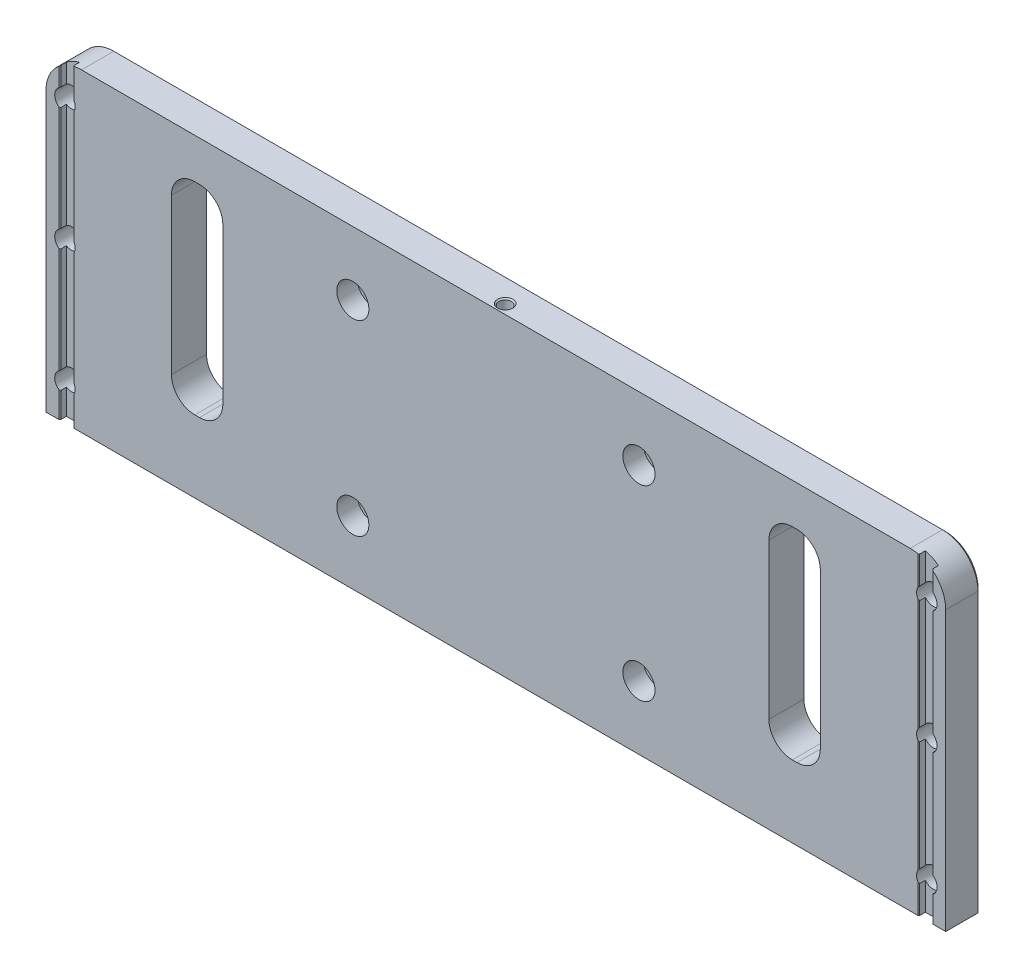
ISO-10303-21;
HEADER;
FILE_DESCRIPTION(('STEP AP214'),'2;1');
FILE_NAME('part.step','',(''),(''),'','','');
FILE_SCHEMA(('AUTOMOTIVE_DESIGN { 1 0 10303 214 1 1 1 1 }'));
ENDSEC;
DATA;
#1=APPLICATION_CONTEXT('core data for automotive mechanical design processes');
#2=APPLICATION_PROTOCOL_DEFINITION('international standard','automotive_design',2000,#1);
#3=PRODUCT_CONTEXT('',#1,'mechanical');
#4=PRODUCT('Part','Part','',(#3));
#5=PRODUCT_RELATED_PRODUCT_CATEGORY('part','',(#4));
#6=PRODUCT_DEFINITION_FORMATION('','',#4);
#7=PRODUCT_DEFINITION_CONTEXT('part definition',#1,'design');
#8=PRODUCT_DEFINITION('design','',#6,#7);
#9=PRODUCT_DEFINITION_SHAPE('','',#8);
#10=(LENGTH_UNIT() NAMED_UNIT(*) SI_UNIT(.MILLI.,.METRE.));
#11=(NAMED_UNIT(*) PLANE_ANGLE_UNIT() SI_UNIT($,.RADIAN.));
#12=(NAMED_UNIT(*) SI_UNIT($,.STERADIAN.) SOLID_ANGLE_UNIT());
#13=UNCERTAINTY_MEASURE_WITH_UNIT(LENGTH_MEASURE(1.E-05),#10,'distance_accuracy_value','');
#14=(GEOMETRIC_REPRESENTATION_CONTEXT(3) GLOBAL_UNCERTAINTY_ASSIGNED_CONTEXT((#13)) GLOBAL_UNIT_ASSIGNED_CONTEXT((#10,
#11,#12)) REPRESENTATION_CONTEXT('',''));
#15=CARTESIAN_POINT('',(0.,0.,0.));
#16=DIRECTION('',(0.,0.,1.));
#17=DIRECTION('',(1.,0.,0.));
#18=AXIS2_PLACEMENT_3D('',#15,#16,#17);
#19=CARTESIAN_POINT('',(118.4529,85.598,-16.256));
#20=DIRECTION('',(0.,-1.,0.));
#21=DIRECTION('',(1.,0.,0.));
#22=AXIS2_PLACEMENT_3D('',#19,#20,#21);
#23=PLANE('',#22);
#24=DIRECTION('',(0.,0.,1.));
#25=VECTOR('',#24,1.);
#26=CARTESIAN_POINT('',(112.5601,85.598,-25.781));
#27=LINE('',#26,#25);
#28=CARTESIAN_POINT('',(112.5601,85.598,-16.256));
#29=VERTEX_POINT('',#28);
#30=CARTESIAN_POINT('',(112.5601,85.598,-25.019));
#31=VERTEX_POINT('',#30);
#32=EDGE_CURVE('E887',#29,#31,#27,.F.);
#33=ORIENTED_EDGE('',*,*,#32,.T.);
#34=DIRECTION('',(-1.,0.,0.));
#35=VECTOR('',#34,1.);
#36=CARTESIAN_POINT('',(-112.5601,85.598,-25.019));
#37=LINE('',#36,#35);
#38=CARTESIAN_POINT('',(-112.5601,85.598,-25.019));
#39=VERTEX_POINT('',#38);
#40=EDGE_CURVE('E996',#31,#39,#37,.T.);
#41=ORIENTED_EDGE('',*,*,#40,.T.);
#42=DIRECTION('',(0.,0.,1.));
#43=VECTOR('',#42,1.);
#44=CARTESIAN_POINT('',(-112.5601,85.598,-16.256));
#45=LINE('',#44,#43);
#46=CARTESIAN_POINT('',(-112.5601,85.598,-16.256));
#47=VERTEX_POINT('',#46);
#48=EDGE_CURVE('E885',#39,#47,#45,.T.);
#49=ORIENTED_EDGE('',*,*,#48,.T.);
#50=DIRECTION('',(-1.,0.,0.));
#51=VECTOR('',#50,1.);
#52=CARTESIAN_POINT('',(113.4618,85.598,-16.256));
#53=LINE('',#52,#51);
#54=EDGE_CURVE('E680',#29,#47,#53,.T.);
#55=ORIENTED_EDGE('',*,*,#54,.F.);
#56=EDGE_LOOP('',(#33,#41,#49,#55));
#57=FACE_BOUND('',#56,.T.);
#58=DIRECTION('',(0.999999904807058,0.,0.000436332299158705));
#59=VECTOR('',#58,1.);
#60=CARTESIAN_POINT('',(2.08279980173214,85.598,-18.7950912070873));
#61=LINE('',#60,#59);
#62=CARTESIAN_POINT('',(2.08305380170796,85.598,-18.7950910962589));
#63=VERTEX_POINT('',#62);
#64=CARTESIAN_POINT('',(2.08279980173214,85.598,-18.7950912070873));
#65=VERTEX_POINT('',#64);
#66=EDGE_CURVE('E551',#63,#65,#61,.F.);
#67=ORIENTED_EDGE('',*,*,#66,.F.);
#68=CARTESIAN_POINT('',(0.,85.598,-18.796));
#69=DIRECTION('',(0.,1.,0.));
#70=DIRECTION('',(0.,0.,1.));
#71=AXIS2_PLACEMENT_3D('',#68,#69,#70);
#72=CIRCLE('',#71,2.083054);
#73=CARTESIAN_POINT('',(2.083054,85.598,-18.796));
#74=VERTEX_POINT('',#73);
#75=EDGE_CURVE('E1172',#74,#63,#72,.T.);
#76=ORIENTED_EDGE('',*,*,#75,.F.);
#77=DIRECTION('',(1.,0.,0.));
#78=VECTOR('',#77,1.);
#79=CARTESIAN_POINT('',(2.0828,85.598,-18.796));
#80=LINE('',#79,#78);
#81=CARTESIAN_POINT('',(2.0828,85.598,-18.796));
#82=VERTEX_POINT('',#81);
#83=EDGE_CURVE('E19',#74,#82,#80,.F.);
#84=ORIENTED_EDGE('',*,*,#83,.T.);
#85=CARTESIAN_POINT('',(0.,85.598,-18.796));
#86=DIRECTION('',(0.,-1.,0.));
#87=DIRECTION('',(1.,0.,0.));
#88=AXIS2_PLACEMENT_3D('',#85,#86,#87);
#89=CIRCLE('',#88,2.0828);
#90=EDGE_CURVE('E25',#82,#65,#89,.T.);
#91=ORIENTED_EDGE('',*,*,#90,.T.);
#92=EDGE_LOOP('',(#67,#76,#84,#91));
#93=FACE_BOUND('',#92,.T.);
#94=ADVANCED_FACE('F15',(#57,#93),#23,.F.);
#95=CARTESIAN_POINT('',(113.4618,85.598,-16.256));
#96=DIRECTION('',(0.,0.,1.));
#97=DIRECTION('',(1.,0.,0.));
#98=AXIS2_PLACEMENT_3D('',#95,#96,#97);
#99=PLANE('',#98);
#100=CARTESIAN_POINT('',(-117.0686,9.525,-16.256));
#101=DIRECTION('',(0.,0.,1.));
#102=DIRECTION('',(1.,0.,0.));
#103=AXIS2_PLACEMENT_3D('',#100,#101,#102);
#104=CIRCLE('',#103,2.778125);
#105=CARTESIAN_POINT('',(-114.6429,8.170762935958,-16.256));
#106=VERTEX_POINT('',#105);
#107=CARTESIAN_POINT('',(-114.6429,10.879237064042,-16.256));
#108=VERTEX_POINT('',#107);
#109=EDGE_CURVE('E736',#106,#108,#104,.T.);
#110=ORIENTED_EDGE('',*,*,#109,.F.);
#111=DIRECTION('',(0.,-1.,0.));
#112=VECTOR('',#111,1.);
#113=CARTESIAN_POINT('',(-114.6429,85.598,-16.256));
#114=LINE('',#113,#112);
#115=CARTESIAN_POINT('',(-114.6429,0.254000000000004,-16.256));
#116=VERTEX_POINT('',#115);
#117=EDGE_CURVE('E1017',#106,#116,#114,.T.);
#118=ORIENTED_EDGE('',*,*,#117,.T.);
#119=DIRECTION('',(-1.,0.,0.));
#120=VECTOR('',#119,1.);
#121=CARTESIAN_POINT('',(113.4618,0.254000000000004,-16.256));
#122=LINE('',#121,#120);
#123=CARTESIAN_POINT('',(114.6429,0.254000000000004,-16.256));
#124=VERTEX_POINT('',#123);
#125=EDGE_CURVE('E642',#124,#116,#122,.T.);
#126=ORIENTED_EDGE('',*,*,#125,.F.);
#127=DIRECTION('',(0.,1.,0.));
#128=VECTOR('',#127,1.);
#129=CARTESIAN_POINT('',(114.6429,7.79245919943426,-16.256));
#130=LINE('',#129,#128);
#131=CARTESIAN_POINT('',(114.6429,8.17076293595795,-16.256));
#132=VERTEX_POINT('',#131);
#133=EDGE_CURVE('E1006',#124,#132,#130,.T.);
#134=ORIENTED_EDGE('',*,*,#133,.T.);
#135=CARTESIAN_POINT('',(117.0686,9.525,-16.256));
#136=DIRECTION('',(0.,0.,1.));
#137=DIRECTION('',(1.,0.,0.));
#138=AXIS2_PLACEMENT_3D('',#135,#136,#137);
#139=CIRCLE('',#138,2.778125);
#140=CARTESIAN_POINT('',(114.6429,10.879237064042,-16.256));
#141=VERTEX_POINT('',#140);
#142=EDGE_CURVE('E733',#141,#132,#139,.T.);
#143=ORIENTED_EDGE('',*,*,#142,.F.);
#144=DIRECTION('',(0.,1.,0.));
#145=VECTOR('',#144,1.);
#146=CARTESIAN_POINT('',(114.6429,41.0664591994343,-16.256));
#147=LINE('',#146,#145);
#148=CARTESIAN_POINT('',(114.6429,41.444762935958,-16.256));
#149=VERTEX_POINT('',#148);
#150=EDGE_CURVE('E1004',#141,#149,#147,.T.);
#151=ORIENTED_EDGE('',*,*,#150,.T.);
#152=CARTESIAN_POINT('',(117.0686,42.799,-16.256));
#153=DIRECTION('',(0.,0.,1.));
#154=DIRECTION('',(1.,0.,0.));
#155=AXIS2_PLACEMENT_3D('',#152,#153,#154);
#156=CIRCLE('',#155,2.778125);
#157=CARTESIAN_POINT('',(114.6429,44.153237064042,-16.256));
#158=VERTEX_POINT('',#157);
#159=EDGE_CURVE('E711',#158,#149,#156,.T.);
#160=ORIENTED_EDGE('',*,*,#159,.F.);
#161=DIRECTION('',(0.,1.,0.));
#162=VECTOR('',#161,1.);
#163=CARTESIAN_POINT('',(114.6429,74.3404591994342,-16.256));
#164=LINE('',#163,#162);
#165=CARTESIAN_POINT('',(114.6429,74.7187629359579,-16.256));
#166=VERTEX_POINT('',#165);
#167=EDGE_CURVE('E1002',#158,#166,#164,.T.);
#168=ORIENTED_EDGE('',*,*,#167,.T.);
#169=CARTESIAN_POINT('',(117.0686,76.073,-16.256));
#170=DIRECTION('',(0.,0.,1.));
#171=DIRECTION('',(1.,0.,0.));
#172=AXIS2_PLACEMENT_3D('',#169,#170,#171);
#173=CIRCLE('',#172,2.778125);
#174=CARTESIAN_POINT('',(114.6429,77.427237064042,-16.256));
#175=VERTEX_POINT('',#174);
#176=EDGE_CURVE('E704',#175,#166,#173,.T.);
#177=ORIENTED_EDGE('',*,*,#176,.F.);
#178=DIRECTION('',(0.,1.,0.));
#179=VECTOR('',#178,1.);
#180=CARTESIAN_POINT('',(114.6429,85.3108528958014,-16.256));
#181=LINE('',#180,#179);
#182=CARTESIAN_POINT('',(114.6429,85.3705980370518,-16.256));
#183=VERTEX_POINT('',#182);
#184=EDGE_CURVE('E1000',#175,#183,#181,.T.);
#185=ORIENTED_EDGE('',*,*,#184,.T.);
#186=CARTESIAN_POINT('',(112.5601,75.946,-16.256));
#187=DIRECTION('',(0.,0.,1.));
#188=DIRECTION('',(1.,0.,0.));
#189=AXIS2_PLACEMENT_3D('',#186,#187,#188);
#190=CIRCLE('',#189,9.652);
#191=EDGE_CURVE('E883',#183,#29,#190,.T.);
#192=ORIENTED_EDGE('',*,*,#191,.T.);
#193=ORIENTED_EDGE('',*,*,#54,.T.);
#194=CARTESIAN_POINT('',(-112.5601,75.946,-16.256));
#195=DIRECTION('',(0.,0.,1.));
#196=DIRECTION('',(1.,0.,0.));
#197=AXIS2_PLACEMENT_3D('',#194,#195,#196);
#198=CIRCLE('',#197,9.652);
#199=CARTESIAN_POINT('',(-114.6429,85.3705980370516,-16.256));
#200=VERTEX_POINT('',#199);
#201=EDGE_CURVE('E880',#47,#200,#198,.T.);
#202=ORIENTED_EDGE('',*,*,#201,.T.);
#203=DIRECTION('',(0.,-1.,0.));
#204=VECTOR('',#203,1.);
#205=CARTESIAN_POINT('',(-114.6429,85.598,-16.256));
#206=LINE('',#205,#204);
#207=CARTESIAN_POINT('',(-114.6429,77.427237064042,-16.256));
#208=VERTEX_POINT('',#207);
#209=EDGE_CURVE('E1008',#200,#208,#206,.T.);
#210=ORIENTED_EDGE('',*,*,#209,.T.);
#211=CARTESIAN_POINT('',(-117.0686,76.073,-16.256));
#212=DIRECTION('',(0.,0.,1.));
#213=DIRECTION('',(1.,0.,0.));
#214=AXIS2_PLACEMENT_3D('',#211,#212,#213);
#215=CIRCLE('',#214,2.778125);
#216=CARTESIAN_POINT('',(-114.6429,74.718762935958,-16.256));
#217=VERTEX_POINT('',#216);
#218=EDGE_CURVE('E700',#217,#208,#215,.T.);
#219=ORIENTED_EDGE('',*,*,#218,.F.);
#220=DIRECTION('',(0.,-1.,0.));
#221=VECTOR('',#220,1.);
#222=CARTESIAN_POINT('',(-114.6429,85.598,-16.256));
#223=LINE('',#222,#221);
#224=CARTESIAN_POINT('',(-114.6429,44.1532370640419,-16.256));
#225=VERTEX_POINT('',#224);
#226=EDGE_CURVE('E1011',#217,#225,#223,.T.);
#227=ORIENTED_EDGE('',*,*,#226,.T.);
#228=CARTESIAN_POINT('',(-117.0686,42.799,-16.256));
#229=DIRECTION('',(0.,0.,1.));
#230=DIRECTION('',(1.,0.,0.));
#231=AXIS2_PLACEMENT_3D('',#228,#229,#230);
#232=CIRCLE('',#231,2.778125);
#233=CARTESIAN_POINT('',(-114.6429,41.4447629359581,-16.256));
#234=VERTEX_POINT('',#233);
#235=EDGE_CURVE('E764',#234,#225,#232,.T.);
#236=ORIENTED_EDGE('',*,*,#235,.F.);
#237=DIRECTION('',(0.,-1.,0.));
#238=VECTOR('',#237,1.);
#239=CARTESIAN_POINT('',(-114.6429,85.598,-16.256));
#240=LINE('',#239,#238);
#241=EDGE_CURVE('E1014',#234,#108,#240,.T.);
#242=ORIENTED_EDGE('',*,*,#241,.T.);
#243=EDGE_LOOP('',(#110,#118,#126,#134,#143,#151,#160,#168,#177,#185,#192,#193,#202,#210,#219,
#227,#236,#242));
#244=FACE_BOUND('',#243,.T.);
#245=CARTESIAN_POINT('',(-38.862,68.326,-16.256));
#246=DIRECTION('',(0.,0.,-1.));
#247=DIRECTION('',(-1.,0.,0.));
#248=AXIS2_PLACEMENT_3D('',#245,#246,#247);
#249=CIRCLE('',#248,4.365625);
#250=CARTESIAN_POINT('',(-43.227625,68.326,-16.256));
#251=VERTEX_POINT('',#250);
#252=EDGE_CURVE('E619',#251,#251,#249,.T.);
#253=ORIENTED_EDGE('',*,*,#252,.T.);
#254=EDGE_LOOP('',(#253));
#255=FACE_BOUND('',#254,.T.);
#256=CARTESIAN_POINT('',(-38.862,17.526,-16.256));
#257=DIRECTION('',(0.,0.,-1.));
#258=DIRECTION('',(-1.,0.,0.));
#259=AXIS2_PLACEMENT_3D('',#256,#257,#258);
#260=CIRCLE('',#259,4.365625);
#261=CARTESIAN_POINT('',(-43.227625,17.526,-16.256));
#262=VERTEX_POINT('',#261);
#263=EDGE_CURVE('E609',#262,#262,#260,.T.);
#264=ORIENTED_EDGE('',*,*,#263,.T.);
#265=EDGE_LOOP('',(#264));
#266=FACE_BOUND('',#265,.T.);
#267=CARTESIAN_POINT('',(38.862,68.326,-16.256));
#268=DIRECTION('',(0.,0.,-1.));
#269=DIRECTION('',(-1.,0.,0.));
#270=AXIS2_PLACEMENT_3D('',#267,#268,#269);
#271=CIRCLE('',#270,4.365625);
#272=CARTESIAN_POINT('',(34.496375,68.326,-16.256));
#273=VERTEX_POINT('',#272);
#274=EDGE_CURVE('E599',#273,#273,#271,.T.);
#275=ORIENTED_EDGE('',*,*,#274,.T.);
#276=EDGE_LOOP('',(#275));
#277=FACE_BOUND('',#276,.T.);
#278=CARTESIAN_POINT('',(38.862,17.526,-16.256));
#279=DIRECTION('',(0.,0.,-1.));
#280=DIRECTION('',(-1.,0.,0.));
#281=AXIS2_PLACEMENT_3D('',#278,#279,#280);
#282=CIRCLE('',#281,4.365625);
#283=CARTESIAN_POINT('',(34.496375,17.526,-16.256));
#284=VERTEX_POINT('',#283);
#285=EDGE_CURVE('E589',#284,#284,#282,.T.);
#286=ORIENTED_EDGE('',*,*,#285,.T.);
#287=EDGE_LOOP('',(#286));
#288=FACE_BOUND('',#287,.T.);
#289=DIRECTION('',(0.,1.,0.));
#290=VECTOR('',#289,1.);
#291=CARTESIAN_POINT('',(-74.168,19.812,-16.256));
#292=LINE('',#291,#290);
#293=CARTESIAN_POINT('',(-74.168,26.162,-16.256));
#294=VERTEX_POINT('',#293);
#295=CARTESIAN_POINT('',(-74.168,68.326,-16.256));
#296=VERTEX_POINT('',#295);
#297=EDGE_CURVE('E577',#294,#296,#292,.T.);
#298=ORIENTED_EDGE('',*,*,#297,.F.);
#299=CARTESIAN_POINT('',(-80.518,26.162,-16.256));
#300=DIRECTION('',(0.,0.,1.));
#301=DIRECTION('',(1.,0.,0.));
#302=AXIS2_PLACEMENT_3D('',#299,#300,#301);
#303=CIRCLE('',#302,6.35);
#304=CARTESIAN_POINT('',(-80.518,19.812,-16.256));
#305=VERTEX_POINT('',#304);
#306=EDGE_CURVE('E954',#294,#305,#303,.F.);
#307=ORIENTED_EDGE('',*,*,#306,.T.);
#308=DIRECTION('',(1.,0.,0.));
#309=VECTOR('',#308,1.);
#310=CARTESIAN_POINT('',(-88.138,19.812,-16.256));
#311=LINE('',#310,#309);
#312=CARTESIAN_POINT('',(-81.788,19.812,-16.256));
#313=VERTEX_POINT('',#312);
#314=EDGE_CURVE('E586',#313,#305,#311,.T.);
#315=ORIENTED_EDGE('',*,*,#314,.F.);
#316=CARTESIAN_POINT('',(-81.788,26.162,-16.256));
#317=DIRECTION('',(0.,0.,1.));
#318=DIRECTION('',(1.,0.,0.));
#319=AXIS2_PLACEMENT_3D('',#316,#317,#318);
#320=CIRCLE('',#319,6.35);
#321=CARTESIAN_POINT('',(-88.138,26.162,-16.256));
#322=VERTEX_POINT('',#321);
#323=EDGE_CURVE('E942',#313,#322,#320,.F.);
#324=ORIENTED_EDGE('',*,*,#323,.T.);
#325=DIRECTION('',(0.,-1.,0.));
#326=VECTOR('',#325,1.);
#327=CARTESIAN_POINT('',(-88.138,74.676,-16.256));
#328=LINE('',#327,#326);
#329=CARTESIAN_POINT('',(-88.138,68.326,-16.256));
#330=VERTEX_POINT('',#329);
#331=EDGE_CURVE('E583',#330,#322,#328,.T.);
#332=ORIENTED_EDGE('',*,*,#331,.F.);
#333=CARTESIAN_POINT('',(-81.788,68.326,-16.256));
#334=DIRECTION('',(0.,0.,1.));
#335=DIRECTION('',(1.,0.,0.));
#336=AXIS2_PLACEMENT_3D('',#333,#334,#335);
#337=CIRCLE('',#336,6.35);
#338=CARTESIAN_POINT('',(-81.788,74.676,-16.256));
#339=VERTEX_POINT('',#338);
#340=EDGE_CURVE('E946',#330,#339,#337,.F.);
#341=ORIENTED_EDGE('',*,*,#340,.T.);
#342=DIRECTION('',(-1.,0.,0.));
#343=VECTOR('',#342,1.);
#344=CARTESIAN_POINT('',(-74.168,74.676,-16.256));
#345=LINE('',#344,#343);
#346=CARTESIAN_POINT('',(-80.518,74.676,-16.256));
#347=VERTEX_POINT('',#346);
#348=EDGE_CURVE('E580',#347,#339,#345,.T.);
#349=ORIENTED_EDGE('',*,*,#348,.F.);
#350=CARTESIAN_POINT('',(-80.518,68.326,-16.256));
#351=DIRECTION('',(0.,0.,1.));
#352=DIRECTION('',(1.,0.,0.));
#353=AXIS2_PLACEMENT_3D('',#350,#351,#352);
#354=CIRCLE('',#353,6.35);
#355=EDGE_CURVE('E950',#347,#296,#354,.F.);
#356=ORIENTED_EDGE('',*,*,#355,.T.);
#357=EDGE_LOOP('',(#298,#307,#315,#324,#332,#341,#349,#356));
#358=FACE_BOUND('',#357,.T.);
#359=DIRECTION('',(0.,-1.,0.));
#360=VECTOR('',#359,1.);
#361=CARTESIAN_POINT('',(88.138,74.676,-16.256));
#362=LINE('',#361,#360);
#363=CARTESIAN_POINT('',(88.138,68.326,-16.256));
#364=VERTEX_POINT('',#363);
#365=CARTESIAN_POINT('',(88.138,26.162,-16.256));
#366=VERTEX_POINT('',#365);
#367=EDGE_CURVE('E571',#364,#366,#362,.T.);
#368=ORIENTED_EDGE('',*,*,#367,.T.);
#369=CARTESIAN_POINT('',(81.788,26.162,-16.256));
#370=DIRECTION('',(0.,0.,1.));
#371=DIRECTION('',(1.,0.,0.));
#372=AXIS2_PLACEMENT_3D('',#369,#370,#371);
#373=CIRCLE('',#372,6.35);
#374=CARTESIAN_POINT('',(81.788,19.812,-16.256));
#375=VERTEX_POINT('',#374);
#376=EDGE_CURVE('E962',#366,#375,#373,.F.);
#377=ORIENTED_EDGE('',*,*,#376,.T.);
#378=DIRECTION('',(-1.,0.,0.));
#379=VECTOR('',#378,1.);
#380=CARTESIAN_POINT('',(88.138,19.812,-16.256));
#381=LINE('',#380,#379);
#382=CARTESIAN_POINT('',(80.518,19.812,-16.256));
#383=VERTEX_POINT('',#382);
#384=EDGE_CURVE('E574',#375,#383,#381,.T.);
#385=ORIENTED_EDGE('',*,*,#384,.T.);
#386=CARTESIAN_POINT('',(80.518,26.162,-16.256));
#387=DIRECTION('',(0.,0.,1.));
#388=DIRECTION('',(1.,0.,0.));
#389=AXIS2_PLACEMENT_3D('',#386,#387,#388);
#390=CIRCLE('',#389,6.35);
#391=CARTESIAN_POINT('',(74.168,26.162,-16.256));
#392=VERTEX_POINT('',#391);
#393=EDGE_CURVE('E958',#383,#392,#390,.F.);
#394=ORIENTED_EDGE('',*,*,#393,.T.);
#395=DIRECTION('',(0.,1.,0.));
#396=VECTOR('',#395,1.);
#397=CARTESIAN_POINT('',(74.168,19.812,-16.256));
#398=LINE('',#397,#396);
#399=CARTESIAN_POINT('',(74.168,68.326,-16.256));
#400=VERTEX_POINT('',#399);
#401=EDGE_CURVE('E565',#392,#400,#398,.T.);
#402=ORIENTED_EDGE('',*,*,#401,.T.);
#403=CARTESIAN_POINT('',(80.518,68.326,-16.256));
#404=DIRECTION('',(0.,0.,1.));
#405=DIRECTION('',(1.,0.,0.));
#406=AXIS2_PLACEMENT_3D('',#403,#404,#405);
#407=CIRCLE('',#406,6.35);
#408=CARTESIAN_POINT('',(80.518,74.676,-16.256));
#409=VERTEX_POINT('',#408);
#410=EDGE_CURVE('E970',#400,#409,#407,.F.);
#411=ORIENTED_EDGE('',*,*,#410,.T.);
#412=DIRECTION('',(1.,0.,0.));
#413=VECTOR('',#412,1.);
#414=CARTESIAN_POINT('',(74.168,74.676,-16.256));
#415=LINE('',#414,#413);
#416=CARTESIAN_POINT('',(81.788,74.676,-16.256));
#417=VERTEX_POINT('',#416);
#418=EDGE_CURVE('E568',#409,#417,#415,.T.);
#419=ORIENTED_EDGE('',*,*,#418,.T.);
#420=CARTESIAN_POINT('',(81.788,68.326,-16.256));
#421=DIRECTION('',(0.,0.,1.));
#422=DIRECTION('',(1.,0.,0.));
#423=AXIS2_PLACEMENT_3D('',#420,#421,#422);
#424=CIRCLE('',#423,6.35);
#425=EDGE_CURVE('E966',#417,#364,#424,.F.);
#426=ORIENTED_EDGE('',*,*,#425,.T.);
#427=EDGE_LOOP('',(#368,#377,#385,#394,#402,#411,#419,#426));
#428=FACE_BOUND('',#427,.T.);
#429=ADVANCED_FACE('F1208',(#244,#255,#266,#277,#288,#358,#428),#99,.T.);
#430=CARTESIAN_POINT('',(-122.2121,85.598,-25.781));
#431=DIRECTION('',(0.,0.,-1.));
#432=DIRECTION('',(-1.,0.,0.));
#433=AXIS2_PLACEMENT_3D('',#430,#431,#432);
#434=PLANE('',#433);
#435=CARTESIAN_POINT('',(112.5601,75.946,-25.781));
#436=DIRECTION('',(0.,0.,-1.));
#437=DIRECTION('',(-1.,0.,0.));
#438=AXIS2_PLACEMENT_3D('',#435,#436,#437);
#439=CIRCLE('',#438,8.89);
#440=CARTESIAN_POINT('',(112.5601,84.836,-25.781));
#441=VERTEX_POINT('',#440);
#442=CARTESIAN_POINT('',(121.4501,75.946,-25.781));
#443=VERTEX_POINT('',#442);
#444=EDGE_CURVE('E982',#441,#443,#439,.T.);
#445=ORIENTED_EDGE('',*,*,#444,.T.);
#446=DIRECTION('',(0.,-1.,0.));
#447=VECTOR('',#446,1.);
#448=CARTESIAN_POINT('',(121.4501,85.598,-25.781));
#449=LINE('',#448,#447);
#450=CARTESIAN_POINT('',(121.4501,1.016,-25.781));
#451=VERTEX_POINT('',#450);
#452=EDGE_CURVE('E984',#443,#451,#449,.T.);
#453=ORIENTED_EDGE('',*,*,#452,.T.);
#454=DIRECTION('',(-1.,0.,0.));
#455=VECTOR('',#454,1.);
#456=CARTESIAN_POINT('',(-122.2121,1.016,-25.781));
#457=LINE('',#456,#455);
#458=CARTESIAN_POINT('',(-121.4501,1.016,-25.781));
#459=VERTEX_POINT('',#458);
#460=EDGE_CURVE('E980',#451,#459,#457,.T.);
#461=ORIENTED_EDGE('',*,*,#460,.T.);
#462=DIRECTION('',(0.,1.,0.));
#463=VECTOR('',#462,1.);
#464=CARTESIAN_POINT('',(-121.4501,75.946,-25.781));
#465=LINE('',#464,#463);
#466=CARTESIAN_POINT('',(-121.4501,75.946,-25.781));
#467=VERTEX_POINT('',#466);
#468=EDGE_CURVE('E978',#459,#467,#465,.T.);
#469=ORIENTED_EDGE('',*,*,#468,.T.);
#470=CARTESIAN_POINT('',(-112.5601,75.946,-25.781));
#471=DIRECTION('',(0.,0.,-1.));
#472=DIRECTION('',(-1.,0.,0.));
#473=AXIS2_PLACEMENT_3D('',#470,#471,#472);
#474=CIRCLE('',#473,8.89);
#475=CARTESIAN_POINT('',(-112.5601,84.836,-25.781));
#476=VERTEX_POINT('',#475);
#477=EDGE_CURVE('E974',#467,#476,#474,.T.);
#478=ORIENTED_EDGE('',*,*,#477,.T.);
#479=DIRECTION('',(1.,0.,0.));
#480=VECTOR('',#479,1.);
#481=CARTESIAN_POINT('',(112.5601,84.836,-25.781));
#482=LINE('',#481,#480);
#483=EDGE_CURVE('E976',#476,#441,#482,.T.);
#484=ORIENTED_EDGE('',*,*,#483,.T.);
#485=EDGE_LOOP('',(#445,#453,#461,#469,#478,#484));
#486=FACE_BOUND('',#485,.T.);
#487=DIRECTION('',(0.,1.,0.));
#488=VECTOR('',#487,1.);
#489=CARTESIAN_POINT('',(74.168,85.598,-25.781));
#490=LINE('',#489,#488);
#491=CARTESIAN_POINT('',(74.168,26.162,-25.781));
#492=VERTEX_POINT('',#491);
#493=CARTESIAN_POINT('',(74.168,68.326,-25.781));
#494=VERTEX_POINT('',#493);
#495=EDGE_CURVE('E866',#492,#494,#490,.T.);
#496=ORIENTED_EDGE('',*,*,#495,.F.);
#497=CARTESIAN_POINT('',(80.518,26.162,-25.781));
#498=DIRECTION('',(0.,0.,-1.));
#499=DIRECTION('',(-1.,0.,0.));
#500=AXIS2_PLACEMENT_3D('',#497,#498,#499);
#501=CIRCLE('',#500,6.35);
#502=CARTESIAN_POINT('',(80.518,19.812,-25.781));
#503=VERTEX_POINT('',#502);
#504=EDGE_CURVE('E960',#492,#503,#501,.F.);
#505=ORIENTED_EDGE('',*,*,#504,.T.);
#506=DIRECTION('',(-1.,0.,0.));
#507=VECTOR('',#506,1.);
#508=CARTESIAN_POINT('',(-122.2121,19.812,-25.781));
#509=LINE('',#508,#507);
#510=CARTESIAN_POINT('',(81.788,19.812,-25.781));
#511=VERTEX_POINT('',#510);
#512=EDGE_CURVE('E857',#511,#503,#509,.T.);
#513=ORIENTED_EDGE('',*,*,#512,.F.);
#514=CARTESIAN_POINT('',(81.788,26.162,-25.781));
#515=DIRECTION('',(0.,0.,-1.));
#516=DIRECTION('',(-1.,0.,0.));
#517=AXIS2_PLACEMENT_3D('',#514,#515,#516);
#518=CIRCLE('',#517,6.35);
#519=CARTESIAN_POINT('',(88.138,26.162,-25.781));
#520=VERTEX_POINT('',#519);
#521=EDGE_CURVE('E964',#511,#520,#518,.F.);
#522=ORIENTED_EDGE('',*,*,#521,.T.);
#523=DIRECTION('',(0.,-1.,0.));
#524=VECTOR('',#523,1.);
#525=CARTESIAN_POINT('',(88.138,85.598,-25.781));
#526=LINE('',#525,#524);
#527=CARTESIAN_POINT('',(88.138,68.326,-25.781));
#528=VERTEX_POINT('',#527);
#529=EDGE_CURVE('E860',#528,#520,#526,.T.);
#530=ORIENTED_EDGE('',*,*,#529,.F.);
#531=CARTESIAN_POINT('',(81.788,68.326,-25.781));
#532=DIRECTION('',(0.,0.,-1.));
#533=DIRECTION('',(-1.,0.,0.));
#534=AXIS2_PLACEMENT_3D('',#531,#532,#533);
#535=CIRCLE('',#534,6.35);
#536=CARTESIAN_POINT('',(81.788,74.676,-25.781));
#537=VERTEX_POINT('',#536);
#538=EDGE_CURVE('E968',#528,#537,#535,.F.);
#539=ORIENTED_EDGE('',*,*,#538,.T.);
#540=DIRECTION('',(1.,0.,0.));
#541=VECTOR('',#540,1.);
#542=CARTESIAN_POINT('',(-122.2121,74.676,-25.781));
#543=LINE('',#542,#541);
#544=CARTESIAN_POINT('',(80.518,74.676,-25.781));
#545=VERTEX_POINT('',#544);
#546=EDGE_CURVE('E863',#545,#537,#543,.T.);
#547=ORIENTED_EDGE('',*,*,#546,.F.);
#548=CARTESIAN_POINT('',(80.518,68.326,-25.781));
#549=DIRECTION('',(0.,0.,-1.));
#550=DIRECTION('',(-1.,0.,0.));
#551=AXIS2_PLACEMENT_3D('',#548,#549,#550);
#552=CIRCLE('',#551,6.35);
#553=EDGE_CURVE('E972',#545,#494,#552,.F.);
#554=ORIENTED_EDGE('',*,*,#553,.T.);
#555=EDGE_LOOP('',(#496,#505,#513,#522,#530,#539,#547,#554));
#556=FACE_BOUND('',#555,.T.);
#557=DIRECTION('',(0.,-1.,0.));
#558=VECTOR('',#557,1.);
#559=CARTESIAN_POINT('',(-74.168,85.598,-25.781));
#560=LINE('',#559,#558);
#561=CARTESIAN_POINT('',(-74.168,68.326,-25.781));
#562=VERTEX_POINT('',#561);
#563=CARTESIAN_POINT('',(-74.168,26.162,-25.781));
#564=VERTEX_POINT('',#563);
#565=EDGE_CURVE('E854',#562,#564,#560,.T.);
#566=ORIENTED_EDGE('',*,*,#565,.F.);
#567=CARTESIAN_POINT('',(-80.518,68.326,-25.781));
#568=DIRECTION('',(0.,0.,-1.));
#569=DIRECTION('',(-1.,0.,0.));
#570=AXIS2_PLACEMENT_3D('',#567,#568,#569);
#571=CIRCLE('',#570,6.35);
#572=CARTESIAN_POINT('',(-80.518,74.676,-25.781));
#573=VERTEX_POINT('',#572);
#574=EDGE_CURVE('E952',#562,#573,#571,.F.);
#575=ORIENTED_EDGE('',*,*,#574,.T.);
#576=DIRECTION('',(1.,0.,0.));
#577=VECTOR('',#576,1.);
#578=CARTESIAN_POINT('',(-122.2121,74.676,-25.781));
#579=LINE('',#578,#577);
#580=CARTESIAN_POINT('',(-81.788,74.676,-25.781));
#581=VERTEX_POINT('',#580);
#582=EDGE_CURVE('E851',#581,#573,#579,.T.);
#583=ORIENTED_EDGE('',*,*,#582,.F.);
#584=CARTESIAN_POINT('',(-81.788,68.326,-25.781));
#585=DIRECTION('',(0.,0.,-1.));
#586=DIRECTION('',(-1.,0.,0.));
#587=AXIS2_PLACEMENT_3D('',#584,#585,#586);
#588=CIRCLE('',#587,6.35);
#589=CARTESIAN_POINT('',(-88.138,68.326,-25.781));
#590=VERTEX_POINT('',#589);
#591=EDGE_CURVE('E948',#581,#590,#588,.F.);
#592=ORIENTED_EDGE('',*,*,#591,.T.);
#593=DIRECTION('',(0.,1.,0.));
#594=VECTOR('',#593,1.);
#595=CARTESIAN_POINT('',(-88.138,85.598,-25.781));
#596=LINE('',#595,#594);
#597=CARTESIAN_POINT('',(-88.138,26.162,-25.781));
#598=VERTEX_POINT('',#597);
#599=EDGE_CURVE('E848',#598,#590,#596,.T.);
#600=ORIENTED_EDGE('',*,*,#599,.F.);
#601=CARTESIAN_POINT('',(-81.788,26.162,-25.781));
#602=DIRECTION('',(0.,0.,-1.));
#603=DIRECTION('',(-1.,0.,0.));
#604=AXIS2_PLACEMENT_3D('',#601,#602,#603);
#605=CIRCLE('',#604,6.35);
#606=CARTESIAN_POINT('',(-81.788,19.812,-25.781));
#607=VERTEX_POINT('',#606);
#608=EDGE_CURVE('E944',#598,#607,#605,.F.);
#609=ORIENTED_EDGE('',*,*,#608,.T.);
#610=DIRECTION('',(-1.,0.,0.));
#611=VECTOR('',#610,1.);
#612=CARTESIAN_POINT('',(-122.2121,19.812,-25.781));
#613=LINE('',#612,#611);
#614=CARTESIAN_POINT('',(-80.518,19.812,-25.781));
#615=VERTEX_POINT('',#614);
#616=EDGE_CURVE('E837',#615,#607,#613,.T.);
#617=ORIENTED_EDGE('',*,*,#616,.F.);
#618=CARTESIAN_POINT('',(-80.518,26.162,-25.781));
#619=DIRECTION('',(0.,0.,-1.));
#620=DIRECTION('',(-1.,0.,0.));
#621=AXIS2_PLACEMENT_3D('',#618,#619,#620);
#622=CIRCLE('',#621,6.35);
#623=EDGE_CURVE('E956',#615,#564,#622,.F.);
#624=ORIENTED_EDGE('',*,*,#623,.T.);
#625=EDGE_LOOP('',(#566,#575,#583,#592,#600,#609,#617,#624));
#626=FACE_BOUND('',#625,.T.);
#627=CARTESIAN_POINT('',(38.862,17.526,-25.781));
#628=DIRECTION('',(0.,0.,-1.));
#629=DIRECTION('',(-1.,0.,0.));
#630=AXIS2_PLACEMENT_3D('',#627,#628,#629);
#631=CIRCLE('',#630,2.778125);
#632=CARTESIAN_POINT('',(36.083875,17.526,-25.781));
#633=VERTEX_POINT('',#632);
#634=EDGE_CURVE('E598',#633,#633,#631,.T.);
#635=ORIENTED_EDGE('',*,*,#634,.F.);
#636=EDGE_LOOP('',(#635));
#637=FACE_BOUND('',#636,.T.);
#638=CARTESIAN_POINT('',(38.862,68.326,-25.781));
#639=DIRECTION('',(0.,0.,-1.));
#640=DIRECTION('',(-1.,0.,0.));
#641=AXIS2_PLACEMENT_3D('',#638,#639,#640);
#642=CIRCLE('',#641,2.778125);
#643=CARTESIAN_POINT('',(36.083875,68.326,-25.781));
#644=VERTEX_POINT('',#643);
#645=EDGE_CURVE('E608',#644,#644,#642,.T.);
#646=ORIENTED_EDGE('',*,*,#645,.F.);
#647=EDGE_LOOP('',(#646));
#648=FACE_BOUND('',#647,.T.);
#649=CARTESIAN_POINT('',(-38.862,17.526,-25.781));
#650=DIRECTION('',(0.,0.,-1.));
#651=DIRECTION('',(-1.,0.,0.));
#652=AXIS2_PLACEMENT_3D('',#649,#650,#651);
#653=CIRCLE('',#652,2.778125);
#654=CARTESIAN_POINT('',(-41.640125,17.526,-25.781));
#655=VERTEX_POINT('',#654);
#656=EDGE_CURVE('E618',#655,#655,#653,.T.);
#657=ORIENTED_EDGE('',*,*,#656,.F.);
#658=EDGE_LOOP('',(#657));
#659=FACE_BOUND('',#658,.T.);
#660=CARTESIAN_POINT('',(-38.862,68.326,-25.781));
#661=DIRECTION('',(0.,0.,-1.));
#662=DIRECTION('',(-1.,0.,0.));
#663=AXIS2_PLACEMENT_3D('',#660,#661,#662);
#664=CIRCLE('',#663,2.778125);
#665=CARTESIAN_POINT('',(-41.640125,68.326,-25.781));
#666=VERTEX_POINT('',#665);
#667=EDGE_CURVE('E628',#666,#666,#664,.T.);
#668=ORIENTED_EDGE('',*,*,#667,.F.);
#669=EDGE_LOOP('',(#668));
#670=FACE_BOUND('',#669,.T.);
#671=CARTESIAN_POINT('',(-117.0686,76.073,-25.781));
#672=DIRECTION('',(0.,0.,-1.));
#673=DIRECTION('',(-1.,0.,0.));
#674=AXIS2_PLACEMENT_3D('',#671,#672,#673);
#675=CIRCLE('',#674,2.778125);
#676=CARTESIAN_POINT('',(-119.846725,76.073,-25.781));
#677=VERTEX_POINT('',#676);
#678=EDGE_CURVE('E699',#677,#677,#675,.T.);
#679=ORIENTED_EDGE('',*,*,#678,.F.);
#680=EDGE_LOOP('',(#679));
#681=FACE_BOUND('',#680,.T.);
#682=CARTESIAN_POINT('',(117.0686,76.073,-25.781));
#683=DIRECTION('',(0.,0.,-1.));
#684=DIRECTION('',(-1.,0.,0.));
#685=AXIS2_PLACEMENT_3D('',#682,#683,#684);
#686=CIRCLE('',#685,2.778125);
#687=CARTESIAN_POINT('',(114.290475,76.073,-25.781));
#688=VERTEX_POINT('',#687);
#689=EDGE_CURVE('E687',#688,#688,#686,.T.);
#690=ORIENTED_EDGE('',*,*,#689,.F.);
#691=EDGE_LOOP('',(#690));
#692=FACE_BOUND('',#691,.T.);
#693=CARTESIAN_POINT('',(117.0686,9.525,-25.781));
#694=DIRECTION('',(0.,0.,-1.));
#695=DIRECTION('',(-1.,0.,0.));
#696=AXIS2_PLACEMENT_3D('',#693,#694,#695);
#697=CIRCLE('',#696,2.778125);
#698=CARTESIAN_POINT('',(114.290475,9.525,-25.781));
#699=VERTEX_POINT('',#698);
#700=EDGE_CURVE('E712',#699,#699,#697,.T.);
#701=ORIENTED_EDGE('',*,*,#700,.F.);
#702=EDGE_LOOP('',(#701));
#703=FACE_BOUND('',#702,.T.);
#704=CARTESIAN_POINT('',(-117.0686,9.525,-25.781));
#705=DIRECTION('',(0.,0.,-1.));
#706=DIRECTION('',(-1.,0.,0.));
#707=AXIS2_PLACEMENT_3D('',#704,#705,#706);
#708=CIRCLE('',#707,2.778125);
#709=CARTESIAN_POINT('',(-119.846725,9.525,-25.781));
#710=VERTEX_POINT('',#709);
#711=EDGE_CURVE('E724',#710,#710,#708,.T.);
#712=ORIENTED_EDGE('',*,*,#711,.F.);
#713=EDGE_LOOP('',(#712));
#714=FACE_BOUND('',#713,.T.);
#715=CARTESIAN_POINT('',(117.0686,42.799,-25.781));
#716=DIRECTION('',(0.,0.,-1.));
#717=DIRECTION('',(-1.,0.,0.));
#718=AXIS2_PLACEMENT_3D('',#715,#716,#717);
#719=CIRCLE('',#718,2.778125);
#720=CARTESIAN_POINT('',(114.290475,42.799,-25.781));
#721=VERTEX_POINT('',#720);
#722=EDGE_CURVE('E757',#721,#721,#719,.T.);
#723=ORIENTED_EDGE('',*,*,#722,.F.);
#724=EDGE_LOOP('',(#723));
#725=FACE_BOUND('',#724,.T.);
#726=CARTESIAN_POINT('',(-117.0686,42.799,-25.781));
#727=DIRECTION('',(0.,0.,-1.));
#728=DIRECTION('',(-1.,0.,0.));
#729=AXIS2_PLACEMENT_3D('',#726,#727,#728);
#730=CIRCLE('',#729,2.778125);
#731=CARTESIAN_POINT('',(-119.846725,42.799,-25.781));
#732=VERTEX_POINT('',#731);
#733=EDGE_CURVE('E657',#732,#732,#730,.T.);
#734=ORIENTED_EDGE('',*,*,#733,.F.);
#735=EDGE_LOOP('',(#734));
#736=FACE_BOUND('',#735,.T.);
#737=ADVANCED_FACE('F1214',(#486,#556,#626,#637,#648,#659,#670,#681,#692,#703,#714,#725,#736),
#434,.T.);
#738=CARTESIAN_POINT('',(118.4529,85.598,-16.256));
#739=DIRECTION('',(0.,0.,-1.));
#740=DIRECTION('',(-1.,0.,0.));
#741=AXIS2_PLACEMENT_3D('',#738,#739,#740);
#742=PLANE('',#741);
#743=CARTESIAN_POINT('',(117.0686,9.525,-16.256));
#744=DIRECTION('',(0.,0.,-1.));
#745=DIRECTION('',(-1.,0.,0.));
#746=AXIS2_PLACEMENT_3D('',#743,#744,#745);
#747=CIRCLE('',#746,2.778125);
#748=CARTESIAN_POINT('',(118.7069,11.7686469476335,-16.256));
#749=VERTEX_POINT('',#748);
#750=CARTESIAN_POINT('',(118.7069,7.28135305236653,-16.256));
#751=VERTEX_POINT('',#750);
#752=EDGE_CURVE('E720',#749,#751,#747,.T.);
#753=ORIENTED_EDGE('',*,*,#752,.T.);
#754=DIRECTION('',(0.,-1.,0.));
#755=VECTOR('',#754,1.);
#756=CARTESIAN_POINT('',(118.7069,85.598,-16.256));
#757=LINE('',#756,#755);
#758=CARTESIAN_POINT('',(118.7069,0.254000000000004,-16.256));
#759=VERTEX_POINT('',#758);
#760=EDGE_CURVE('E1093',#751,#759,#757,.T.);
#761=ORIENTED_EDGE('',*,*,#760,.T.);
#762=DIRECTION('',(1.,0.,0.));
#763=VECTOR('',#762,1.);
#764=CARTESIAN_POINT('',(118.4529,0.254000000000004,-16.256));
#765=LINE('',#764,#763);
#766=CARTESIAN_POINT('',(122.2121,0.254000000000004,-16.256));
#767=VERTEX_POINT('',#766);
#768=EDGE_CURVE('E645',#759,#767,#765,.T.);
#769=ORIENTED_EDGE('',*,*,#768,.T.);
#770=DIRECTION('',(0.,-1.,0.));
#771=VECTOR('',#770,1.);
#772=CARTESIAN_POINT('',(122.2121,85.598,-16.256));
#773=LINE('',#772,#771);
#774=CARTESIAN_POINT('',(122.2121,75.946,-16.256));
#775=VERTEX_POINT('',#774);
#776=EDGE_CURVE('E629',#775,#767,#773,.T.);
#777=ORIENTED_EDGE('',*,*,#776,.F.);
#778=CARTESIAN_POINT('',(112.5601,75.946,-16.256));
#779=DIRECTION('',(0.,0.,-1.));
#780=DIRECTION('',(-1.,0.,0.));
#781=AXIS2_PLACEMENT_3D('',#778,#779,#780);
#782=CIRCLE('',#781,9.652);
#783=CARTESIAN_POINT('',(118.7069,83.3876364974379,-16.256));
#784=VERTEX_POINT('',#783);
#785=EDGE_CURVE('E871',#775,#784,#782,.F.);
#786=ORIENTED_EDGE('',*,*,#785,.T.);
#787=DIRECTION('',(0.,-1.,0.));
#788=VECTOR('',#787,1.);
#789=CARTESIAN_POINT('',(118.7069,85.598,-16.256));
#790=LINE('',#789,#788);
#791=CARTESIAN_POINT('',(118.7069,78.3166469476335,-16.256));
#792=VERTEX_POINT('',#791);
#793=EDGE_CURVE('E1084',#784,#792,#790,.T.);
#794=ORIENTED_EDGE('',*,*,#793,.T.);
#795=CARTESIAN_POINT('',(117.0686,76.073,-16.256));
#796=DIRECTION('',(0.,0.,-1.));
#797=DIRECTION('',(-1.,0.,0.));
#798=AXIS2_PLACEMENT_3D('',#795,#796,#797);
#799=CIRCLE('',#798,2.778125);
#800=CARTESIAN_POINT('',(118.7069,73.8293530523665,-16.256));
#801=VERTEX_POINT('',#800);
#802=EDGE_CURVE('E716',#792,#801,#799,.T.);
#803=ORIENTED_EDGE('',*,*,#802,.T.);
#804=DIRECTION('',(0.,-1.,0.));
#805=VECTOR('',#804,1.);
#806=CARTESIAN_POINT('',(118.7069,85.598,-16.256));
#807=LINE('',#806,#805);
#808=CARTESIAN_POINT('',(118.7069,45.0426469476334,-16.256));
#809=VERTEX_POINT('',#808);
#810=EDGE_CURVE('E1087',#801,#809,#807,.T.);
#811=ORIENTED_EDGE('',*,*,#810,.T.);
#812=CARTESIAN_POINT('',(117.0686,42.799,-16.256));
#813=DIRECTION('',(0.,0.,-1.));
#814=DIRECTION('',(-1.,0.,0.));
#815=AXIS2_PLACEMENT_3D('',#812,#813,#814);
#816=CIRCLE('',#815,2.778125);
#817=CARTESIAN_POINT('',(118.7069,40.5553530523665,-16.256));
#818=VERTEX_POINT('',#817);
#819=EDGE_CURVE('E703',#809,#818,#816,.T.);
#820=ORIENTED_EDGE('',*,*,#819,.T.);
#821=DIRECTION('',(0.,-1.,0.));
#822=VECTOR('',#821,1.);
#823=CARTESIAN_POINT('',(118.7069,85.598,-16.256));
#824=LINE('',#823,#822);
#825=EDGE_CURVE('E1090',#818,#749,#824,.T.);
#826=ORIENTED_EDGE('',*,*,#825,.T.);
#827=EDGE_LOOP('',(#753,#761,#769,#777,#786,#794,#803,#811,#820,#826));
#828=FACE_BOUND('',#827,.T.);
#829=ADVANCED_FACE('F1242',(#828),#742,.F.);
#830=CARTESIAN_POINT('',(0.,0.254,0.));
#831=DIRECTION('',(0.,1.,0.));
#832=DIRECTION('',(0.,0.,1.));
#833=AXIS2_PLACEMENT_3D('',#830,#831,#832);
#834=PLANE('',#833);
#835=ORIENTED_EDGE('',*,*,#125,.T.);
#836=DIRECTION('',(0.707106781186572,0.,0.707106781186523));
#837=VECTOR('',#836,1.);
#838=CARTESIAN_POINT('',(-114.6429,0.254000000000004,-16.256));
#839=LINE('',#838,#837);
#840=CARTESIAN_POINT('',(-114.8969,0.254000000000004,-16.51));
#841=VERTEX_POINT('',#840);
#842=EDGE_CURVE('E1026',#116,#841,#839,.F.);
#843=ORIENTED_EDGE('',*,*,#842,.T.);
#844=DIRECTION('',(0.,0.,-1.));
#845=VECTOR('',#844,1.);
#846=CARTESIAN_POINT('',(-114.8969,0.254000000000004,-16.256));
#847=LINE('',#846,#845);
#848=CARTESIAN_POINT('',(-114.8969,0.254000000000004,-18.034));
#849=VERTEX_POINT('',#848);
#850=EDGE_CURVE('E640',#841,#849,#847,.T.);
#851=ORIENTED_EDGE('',*,*,#850,.T.);
#852=DIRECTION('',(-1.,0.,0.));
#853=VECTOR('',#852,1.);
#854=CARTESIAN_POINT('',(-114.8969,0.254000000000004,-18.034));
#855=LINE('',#854,#853);
#856=CARTESIAN_POINT('',(-118.4529,0.254000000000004,-18.034));
#857=VERTEX_POINT('',#856);
#858=EDGE_CURVE('E822',#849,#857,#855,.T.);
#859=ORIENTED_EDGE('',*,*,#858,.T.);
#860=DIRECTION('',(0.,0.,1.));
#861=VECTOR('',#860,1.);
#862=CARTESIAN_POINT('',(-118.4529,0.254000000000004,-17.78));
#863=LINE('',#862,#861);
#864=CARTESIAN_POINT('',(-118.4529,0.254000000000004,-16.51));
#865=VERTEX_POINT('',#864);
#866=EDGE_CURVE('E635',#857,#865,#863,.T.);
#867=ORIENTED_EDGE('',*,*,#866,.T.);
#868=DIRECTION('',(0.707106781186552,0.,-0.707106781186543));
#869=VECTOR('',#868,1.);
#870=CARTESIAN_POINT('',(-118.4529,0.254000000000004,-16.51));
#871=LINE('',#870,#869);
#872=CARTESIAN_POINT('',(-118.7069,0.254000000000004,-16.256));
#873=VERTEX_POINT('',#872);
#874=EDGE_CURVE('E1024',#865,#873,#871,.F.);
#875=ORIENTED_EDGE('',*,*,#874,.T.);
#876=DIRECTION('',(-1.,0.,0.));
#877=VECTOR('',#876,1.);
#878=CARTESIAN_POINT('',(-118.4529,0.254000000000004,-16.256));
#879=LINE('',#878,#877);
#880=CARTESIAN_POINT('',(-122.2121,0.254,-16.256));
#881=VERTEX_POINT('',#880);
#882=EDGE_CURVE('E638',#873,#881,#879,.T.);
#883=ORIENTED_EDGE('',*,*,#882,.T.);
#884=DIRECTION('',(0.,0.,-1.));
#885=VECTOR('',#884,1.);
#886=CARTESIAN_POINT('',(-122.2121,0.254,0.));
#887=LINE('',#886,#885);
#888=CARTESIAN_POINT('',(-122.2121,0.254,-25.019));
#889=VERTEX_POINT('',#888);
#890=EDGE_CURVE('E831',#881,#889,#887,.T.);
#891=ORIENTED_EDGE('',*,*,#890,.T.);
#892=DIRECTION('',(1.,0.,0.));
#893=VECTOR('',#892,1.);
#894=CARTESIAN_POINT('',(122.2121,0.254,-25.019));
#895=LINE('',#894,#893);
#896=CARTESIAN_POINT('',(122.2121,0.254,-25.019));
#897=VERTEX_POINT('',#896);
#898=EDGE_CURVE('E992',#889,#897,#895,.T.);
#899=ORIENTED_EDGE('',*,*,#898,.T.);
#900=DIRECTION('',(0.,0.,-1.));
#901=VECTOR('',#900,1.);
#902=CARTESIAN_POINT('',(122.2121,0.254,0.));
#903=LINE('',#902,#901);
#904=EDGE_CURVE('E834',#767,#897,#903,.T.);
#905=ORIENTED_EDGE('',*,*,#904,.F.);
#906=ORIENTED_EDGE('',*,*,#768,.F.);
#907=DIRECTION('',(0.707106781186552,0.,0.707106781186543));
#908=VECTOR('',#907,1.);
#909=CARTESIAN_POINT('',(118.7069,0.254000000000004,-16.256));
#910=LINE('',#909,#908);
#911=CARTESIAN_POINT('',(118.4529,0.254000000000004,-16.51));
#912=VERTEX_POINT('',#911);
#913=EDGE_CURVE('E1022',#759,#912,#910,.F.);
#914=ORIENTED_EDGE('',*,*,#913,.T.);
#915=DIRECTION('',(0.,0.,1.));
#916=VECTOR('',#915,1.);
#917=CARTESIAN_POINT('',(118.4529,0.254000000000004,-17.78));
#918=LINE('',#917,#916);
#919=CARTESIAN_POINT('',(118.4529,0.254000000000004,-18.034));
#920=VERTEX_POINT('',#919);
#921=EDGE_CURVE('E647',#920,#912,#918,.T.);
#922=ORIENTED_EDGE('',*,*,#921,.F.);
#923=DIRECTION('',(1.,0.,0.));
#924=VECTOR('',#923,1.);
#925=CARTESIAN_POINT('',(114.8969,0.254000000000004,-18.034));
#926=LINE('',#925,#924);
#927=CARTESIAN_POINT('',(114.8969,0.254000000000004,-18.034));
#928=VERTEX_POINT('',#927);
#929=EDGE_CURVE('E650',#928,#920,#926,.T.);
#930=ORIENTED_EDGE('',*,*,#929,.F.);
#931=DIRECTION('',(0.,0.,-1.));
#932=VECTOR('',#931,1.);
#933=CARTESIAN_POINT('',(114.8969,0.254000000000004,-16.256));
#934=LINE('',#933,#932);
#935=CARTESIAN_POINT('',(114.8969,0.254000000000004,-16.51));
#936=VERTEX_POINT('',#935);
#937=EDGE_CURVE('E652',#936,#928,#934,.T.);
#938=ORIENTED_EDGE('',*,*,#937,.F.);
#939=DIRECTION('',(-0.707106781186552,0.,0.707106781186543));
#940=VECTOR('',#939,1.);
#941=CARTESIAN_POINT('',(114.8969,0.254000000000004,-16.51));
#942=LINE('',#941,#940);
#943=EDGE_CURVE('E1020',#936,#124,#942,.T.);
#944=ORIENTED_EDGE('',*,*,#943,.T.);
#945=EDGE_LOOP('',(#835,#843,#851,#859,#867,#875,#883,#891,#899,#905,#906,#914,#922,#930,#938,#944));
#946=FACE_BOUND('',#945,.T.);
#947=ADVANCED_FACE('F1246',(#946),#834,.F.);
#948=CARTESIAN_POINT('',(-114.8969,85.598,-16.256));
#949=DIRECTION('',(-1.,0.,0.));
#950=DIRECTION('',(0.,0.,1.));
#951=AXIS2_PLACEMENT_3D('',#948,#949,#950);
#952=PLANE('',#951);
#953=DIRECTION('',(0.,0.,1.));
#954=VECTOR('',#953,1.);
#955=CARTESIAN_POINT('',(-114.8969,11.2575408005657,-17.145));
#956=LINE('',#955,#954);
#957=CARTESIAN_POINT('',(-114.8969,11.2575408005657,-16.51));
#958=VERTEX_POINT('',#957);
#959=CARTESIAN_POINT('',(-114.8969,11.2575408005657,-18.034));
#960=VERTEX_POINT('',#959);
#961=EDGE_CURVE('E797',#958,#960,#956,.F.);
#962=ORIENTED_EDGE('',*,*,#961,.F.);
#963=DIRECTION('',(0.,1.,0.));
#964=VECTOR('',#963,1.);
#965=CARTESIAN_POINT('',(-114.8969,85.598,-16.51));
#966=LINE('',#965,#964);
#967=CARTESIAN_POINT('',(-114.8969,41.0664591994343,-16.51));
#968=VERTEX_POINT('',#967);
#969=EDGE_CURVE('E1049',#958,#968,#966,.T.);
#970=ORIENTED_EDGE('',*,*,#969,.T.);
#971=DIRECTION('',(0.,0.,1.));
#972=VECTOR('',#971,1.);
#973=CARTESIAN_POINT('',(-114.8969,41.0664591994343,-17.145));
#974=LINE('',#973,#972);
#975=CARTESIAN_POINT('',(-114.8969,41.0664591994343,-18.034));
#976=VERTEX_POINT('',#975);
#977=EDGE_CURVE('E810',#976,#968,#974,.T.);
#978=ORIENTED_EDGE('',*,*,#977,.F.);
#979=DIRECTION('',(0.,-1.,0.));
#980=VECTOR('',#979,1.);
#981=CARTESIAN_POINT('',(-114.8969,85.598,-18.034));
#982=LINE('',#981,#980);
#983=EDGE_CURVE('E674',#976,#960,#982,.T.);
#984=ORIENTED_EDGE('',*,*,#983,.T.);
#985=EDGE_LOOP('',(#962,#970,#978,#984));
#986=FACE_BOUND('',#985,.T.);
#987=ADVANCED_FACE('F1227',(#986),#952,.T.);
#988=CARTESIAN_POINT('',(-118.4529,85.598,-17.78));
#989=DIRECTION('',(1.,0.,0.));
#990=DIRECTION('',(0.,0.,-1.));
#991=AXIS2_PLACEMENT_3D('',#988,#989,#990);
#992=PLANE('',#991);
#993=DIRECTION('',(0.,0.,1.));
#994=VECTOR('',#993,1.);
#995=CARTESIAN_POINT('',(-118.4529,73.6643298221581,-17.145));
#996=LINE('',#995,#994);
#997=CARTESIAN_POINT('',(-118.4529,73.6643298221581,-16.51));
#998=VERTEX_POINT('',#997);
#999=CARTESIAN_POINT('',(-118.4529,73.6643298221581,-18.034));
#1000=VERTEX_POINT('',#999);
#1001=EDGE_CURVE('E691',#998,#1000,#996,.F.);
#1002=ORIENTED_EDGE('',*,*,#1001,.F.);
#1003=DIRECTION('',(0.,-1.,0.));
#1004=VECTOR('',#1003,1.);
#1005=CARTESIAN_POINT('',(-118.4529,85.598,-16.51));
#1006=LINE('',#1005,#1004);
#1007=CARTESIAN_POINT('',(-118.4529,45.2076701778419,-16.51));
#1008=VERTEX_POINT('',#1007);
#1009=EDGE_CURVE('E1072',#998,#1008,#1006,.T.);
#1010=ORIENTED_EDGE('',*,*,#1009,.T.);
#1011=DIRECTION('',(0.,0.,1.));
#1012=VECTOR('',#1011,1.);
#1013=CARTESIAN_POINT('',(-118.4529,45.2076701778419,-17.145));
#1014=LINE('',#1013,#1012);
#1015=CARTESIAN_POINT('',(-118.4529,45.2076701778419,-18.034));
#1016=VERTEX_POINT('',#1015);
#1017=EDGE_CURVE('E817',#1016,#1008,#1014,.T.);
#1018=ORIENTED_EDGE('',*,*,#1017,.F.);
#1019=DIRECTION('',(0.,-1.,0.));
#1020=VECTOR('',#1019,1.);
#1021=CARTESIAN_POINT('',(-118.4529,85.598,-18.034));
#1022=LINE('',#1021,#1020);
#1023=EDGE_CURVE('E671',#1000,#1016,#1022,.T.);
#1024=ORIENTED_EDGE('',*,*,#1023,.F.);
#1025=EDGE_LOOP('',(#1002,#1010,#1018,#1024));
#1026=FACE_BOUND('',#1025,.T.);
#1027=ADVANCED_FACE('F1234',(#1026),#992,.T.);
#1028=CARTESIAN_POINT('',(-114.8969,85.598,-18.034));
#1029=DIRECTION('',(0.,0.,1.));
#1030=DIRECTION('',(1.,0.,0.));
#1031=AXIS2_PLACEMENT_3D('',#1028,#1029,#1030);
#1032=PLANE('',#1031);
#1033=CARTESIAN_POINT('',(-117.0686,42.799,-18.034));
#1034=DIRECTION('',(0.,0.,1.));
#1035=DIRECTION('',(1.,0.,0.));
#1036=AXIS2_PLACEMENT_3D('',#1033,#1034,#1035);
#1037=CIRCLE('',#1036,2.778125);
#1038=CARTESIAN_POINT('',(-114.8969,44.5315408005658,-18.034));
#1039=VERTEX_POINT('',#1038);
#1040=EDGE_CURVE('E816',#1039,#1016,#1037,.T.);
#1041=ORIENTED_EDGE('',*,*,#1040,.F.);
#1042=CARTESIAN_POINT('',(-114.8969,74.3404591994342,-18.034));
#1043=VERTEX_POINT('',#1042);
#1044=EDGE_CURVE('E677',#1043,#1039,#982,.T.);
#1045=ORIENTED_EDGE('',*,*,#1044,.F.);
#1046=CARTESIAN_POINT('',(-117.0686,76.073,-18.034));
#1047=DIRECTION('',(0.,0.,1.));
#1048=DIRECTION('',(1.,0.,0.));
#1049=AXIS2_PLACEMENT_3D('',#1046,#1047,#1048);
#1050=CIRCLE('',#1049,2.778125);
#1051=EDGE_CURVE('E695',#1000,#1043,#1050,.T.);
#1052=ORIENTED_EDGE('',*,*,#1051,.F.);
#1053=ORIENTED_EDGE('',*,*,#1023,.T.);
#1054=EDGE_LOOP('',(#1041,#1045,#1052,#1053));
#1055=FACE_BOUND('',#1054,.T.);
#1056=ADVANCED_FACE('F1268',(#1055),#1032,.T.);
#1057=CARTESIAN_POINT('',(114.8969,85.598,-16.256));
#1058=DIRECTION('',(-1.,0.,0.));
#1059=DIRECTION('',(0.,0.,1.));
#1060=AXIS2_PLACEMENT_3D('',#1057,#1058,#1059);
#1061=PLANE('',#1060);
#1062=DIRECTION('',(0.,0.,1.));
#1063=VECTOR('',#1062,1.);
#1064=CARTESIAN_POINT('',(114.8969,41.0664591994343,-17.145));
#1065=LINE('',#1064,#1063);
#1066=CARTESIAN_POINT('',(114.8969,41.0664591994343,-18.034));
#1067=VERTEX_POINT('',#1066);
#1068=CARTESIAN_POINT('',(114.8969,41.0664591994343,-16.51));
#1069=VERTEX_POINT('',#1068);
#1070=EDGE_CURVE('E742',#1067,#1069,#1065,.T.);
#1071=ORIENTED_EDGE('',*,*,#1070,.T.);
#1072=DIRECTION('',(0.,-1.,0.));
#1073=VECTOR('',#1072,1.);
#1074=CARTESIAN_POINT('',(114.8969,11.2575408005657,-16.51));
#1075=LINE('',#1074,#1073);
#1076=CARTESIAN_POINT('',(114.8969,11.2575408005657,-16.51));
#1077=VERTEX_POINT('',#1076);
#1078=EDGE_CURVE('E1119',#1069,#1077,#1075,.T.);
#1079=ORIENTED_EDGE('',*,*,#1078,.T.);
#1080=DIRECTION('',(0.,0.,1.));
#1081=VECTOR('',#1080,1.);
#1082=CARTESIAN_POINT('',(114.8969,11.2575408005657,-17.145));
#1083=LINE('',#1082,#1081);
#1084=CARTESIAN_POINT('',(114.8969,11.2575408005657,-18.034));
#1085=VERTEX_POINT('',#1084);
#1086=EDGE_CURVE('E715',#1077,#1085,#1083,.F.);
#1087=ORIENTED_EDGE('',*,*,#1086,.T.);
#1088=DIRECTION('',(0.,-1.,0.));
#1089=VECTOR('',#1088,1.);
#1090=CARTESIAN_POINT('',(114.8969,85.598,-18.034));
#1091=LINE('',#1090,#1089);
#1092=EDGE_CURVE('E658',#1067,#1085,#1091,.T.);
#1093=ORIENTED_EDGE('',*,*,#1092,.F.);
#1094=EDGE_LOOP('',(#1071,#1079,#1087,#1093));
#1095=FACE_BOUND('',#1094,.T.);
#1096=ADVANCED_FACE('F1258',(#1095),#1061,.F.);
#1097=CARTESIAN_POINT('',(114.8969,85.598,-18.034));
#1098=DIRECTION('',(0.,0.,-1.));
#1099=DIRECTION('',(-1.,0.,0.));
#1100=AXIS2_PLACEMENT_3D('',#1097,#1098,#1099);
#1101=PLANE('',#1100);
#1102=CARTESIAN_POINT('',(114.8969,74.3404591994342,-18.034));
#1103=VERTEX_POINT('',#1102);
#1104=CARTESIAN_POINT('',(114.8969,44.5315408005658,-18.034));
#1105=VERTEX_POINT('',#1104);
#1106=EDGE_CURVE('E661',#1103,#1105,#1091,.T.);
#1107=ORIENTED_EDGE('',*,*,#1106,.T.);
#1108=CARTESIAN_POINT('',(117.0686,42.799,-18.034));
#1109=DIRECTION('',(0.,0.,-1.));
#1110=DIRECTION('',(-1.,0.,0.));
#1111=AXIS2_PLACEMENT_3D('',#1108,#1109,#1110);
#1112=CIRCLE('',#1111,2.778125);
#1113=CARTESIAN_POINT('',(118.4529,45.2076701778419,-18.034));
#1114=VERTEX_POINT('',#1113);
#1115=EDGE_CURVE('E745',#1105,#1114,#1112,.T.);
#1116=ORIENTED_EDGE('',*,*,#1115,.T.);
#1117=DIRECTION('',(0.,-1.,0.));
#1118=VECTOR('',#1117,1.);
#1119=CARTESIAN_POINT('',(118.4529,85.598,-18.034));
#1120=LINE('',#1119,#1118);
#1121=CARTESIAN_POINT('',(118.4529,73.6643298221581,-18.034));
#1122=VERTEX_POINT('',#1121);
#1123=EDGE_CURVE('E666',#1122,#1114,#1120,.T.);
#1124=ORIENTED_EDGE('',*,*,#1123,.F.);
#1125=CARTESIAN_POINT('',(117.0686,76.073,-18.034));
#1126=DIRECTION('',(0.,0.,-1.));
#1127=DIRECTION('',(-1.,0.,0.));
#1128=AXIS2_PLACEMENT_3D('',#1125,#1126,#1127);
#1129=CIRCLE('',#1128,2.778125);
#1130=EDGE_CURVE('E776',#1122,#1103,#1129,.T.);
#1131=ORIENTED_EDGE('',*,*,#1130,.T.);
#1132=EDGE_LOOP('',(#1107,#1116,#1124,#1131));
#1133=FACE_BOUND('',#1132,.T.);
#1134=ADVANCED_FACE('F1263',(#1133),#1101,.F.);
#1135=CARTESIAN_POINT('',(118.4529,85.598,-17.78));
#1136=DIRECTION('',(1.,0.,0.));
#1137=DIRECTION('',(0.,0.,-1.));
#1138=AXIS2_PLACEMENT_3D('',#1135,#1136,#1137);
#1139=PLANE('',#1138);
#1140=DIRECTION('',(0.,0.,1.));
#1141=VECTOR('',#1140,1.);
#1142=CARTESIAN_POINT('',(118.4529,45.2076701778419,-17.145));
#1143=LINE('',#1142,#1141);
#1144=CARTESIAN_POINT('',(118.4529,45.2076701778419,-16.51));
#1145=VERTEX_POINT('',#1144);
#1146=EDGE_CURVE('E749',#1114,#1145,#1143,.T.);
#1147=ORIENTED_EDGE('',*,*,#1146,.T.);
#1148=DIRECTION('',(0.,1.,0.));
#1149=VECTOR('',#1148,1.);
#1150=CARTESIAN_POINT('',(118.4529,85.598,-16.51));
#1151=LINE('',#1150,#1149);
#1152=CARTESIAN_POINT('',(118.4529,73.6643298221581,-16.51));
#1153=VERTEX_POINT('',#1152);
#1154=EDGE_CURVE('E1122',#1145,#1153,#1151,.T.);
#1155=ORIENTED_EDGE('',*,*,#1154,.T.);
#1156=DIRECTION('',(0.,0.,1.));
#1157=VECTOR('',#1156,1.);
#1158=CARTESIAN_POINT('',(118.4529,73.6643298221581,-17.145));
#1159=LINE('',#1158,#1157);
#1160=EDGE_CURVE('E771',#1153,#1122,#1159,.F.);
#1161=ORIENTED_EDGE('',*,*,#1160,.T.);
#1162=ORIENTED_EDGE('',*,*,#1123,.T.);
#1163=EDGE_LOOP('',(#1147,#1155,#1161,#1162));
#1164=FACE_BOUND('',#1163,.T.);
#1165=ADVANCED_FACE('F1252',(#1164),#1139,.F.);
#1166=DIRECTION('',(0.,0.,1.));
#1167=VECTOR('',#1166,1.);
#1168=CARTESIAN_POINT('',(-118.4529,83.5903451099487,-18.034));
#1169=LINE('',#1168,#1167);
#1170=CARTESIAN_POINT('',(-118.4529,83.5903451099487,-18.034));
#1171=VERTEX_POINT('',#1170);
#1172=CARTESIAN_POINT('',(-118.4529,83.5903451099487,-16.51));
#1173=VERTEX_POINT('',#1172);
#1174=EDGE_CURVE('E894',#1171,#1173,#1169,.T.);
#1175=ORIENTED_EDGE('',*,*,#1174,.T.);
#1176=DIRECTION('',(0.,-1.,0.));
#1177=VECTOR('',#1176,1.);
#1178=CARTESIAN_POINT('',(-118.4529,85.598,-16.51));
#1179=LINE('',#1178,#1177);
#1180=CARTESIAN_POINT('',(-118.4529,78.4816701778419,-16.51));
#1181=VERTEX_POINT('',#1180);
#1182=EDGE_CURVE('E1081',#1173,#1181,#1179,.T.);
#1183=ORIENTED_EDGE('',*,*,#1182,.T.);
#1184=DIRECTION('',(0.,0.,1.));
#1185=VECTOR('',#1184,1.);
#1186=CARTESIAN_POINT('',(-118.4529,78.4816701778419,-17.145));
#1187=LINE('',#1186,#1185);
#1188=CARTESIAN_POINT('',(-118.4529,78.4816701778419,-18.034));
#1189=VERTEX_POINT('',#1188);
#1190=EDGE_CURVE('E688',#1189,#1181,#1187,.T.);
#1191=ORIENTED_EDGE('',*,*,#1190,.F.);
#1192=EDGE_CURVE('E673',#1171,#1189,#1022,.T.);
#1193=ORIENTED_EDGE('',*,*,#1192,.F.);
#1194=EDGE_LOOP('',(#1175,#1183,#1191,#1193));
#1195=FACE_BOUND('',#1194,.T.);
#1196=ADVANCED_FACE('F1380',(#1195),#992,.T.);
#1197=CARTESIAN_POINT('',(-114.8969,85.3108528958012,-18.034));
#1198=VERTEX_POINT('',#1197);
#1199=CARTESIAN_POINT('',(-114.8969,77.8055408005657,-18.034));
#1200=VERTEX_POINT('',#1199);
#1201=EDGE_CURVE('E679',#1198,#1200,#982,.T.);
#1202=ORIENTED_EDGE('',*,*,#1201,.F.);
#1203=CARTESIAN_POINT('',(-112.5601,75.946,-18.034));
#1204=DIRECTION('',(0.,0.,1.));
#1205=DIRECTION('',(1.,0.,0.));
#1206=AXIS2_PLACEMENT_3D('',#1203,#1204,#1205);
#1207=CIRCLE('',#1206,9.652);
#1208=EDGE_CURVE('E892',#1198,#1171,#1207,.T.);
#1209=ORIENTED_EDGE('',*,*,#1208,.T.);
#1210=ORIENTED_EDGE('',*,*,#1192,.T.);
#1211=CARTESIAN_POINT('',(-117.0686,76.073,-18.034));
#1212=DIRECTION('',(0.,0.,1.));
#1213=DIRECTION('',(1.,0.,0.));
#1214=AXIS2_PLACEMENT_3D('',#1211,#1212,#1213);
#1215=CIRCLE('',#1214,2.778125);
#1216=EDGE_CURVE('E692',#1200,#1189,#1215,.T.);
#1217=ORIENTED_EDGE('',*,*,#1216,.F.);
#1218=EDGE_LOOP('',(#1202,#1209,#1210,#1217));
#1219=FACE_BOUND('',#1218,.T.);
#1220=ADVANCED_FACE('F1388',(#1219),#1032,.T.);
#1221=DIRECTION('',(0.,0.,1.));
#1222=VECTOR('',#1221,1.);
#1223=CARTESIAN_POINT('',(-114.8969,44.5315408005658,-17.145));
#1224=LINE('',#1223,#1222);
#1225=CARTESIAN_POINT('',(-114.8969,44.5315408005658,-16.51));
#1226=VERTEX_POINT('',#1225);
#1227=EDGE_CURVE('E813',#1226,#1039,#1224,.F.);
#1228=ORIENTED_EDGE('',*,*,#1227,.F.);
#1229=DIRECTION('',(0.,1.,0.));
#1230=VECTOR('',#1229,1.);
#1231=CARTESIAN_POINT('',(-114.8969,85.598,-16.51));
#1232=LINE('',#1231,#1230);
#1233=CARTESIAN_POINT('',(-114.8969,74.3404591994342,-16.51));
#1234=VERTEX_POINT('',#1233);
#1235=EDGE_CURVE('E1062',#1226,#1234,#1232,.T.);
#1236=ORIENTED_EDGE('',*,*,#1235,.T.);
#1237=DIRECTION('',(0.,0.,1.));
#1238=VECTOR('',#1237,1.);
#1239=CARTESIAN_POINT('',(-114.8969,74.3404591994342,-17.145));
#1240=LINE('',#1239,#1238);
#1241=EDGE_CURVE('E698',#1043,#1234,#1240,.T.);
#1242=ORIENTED_EDGE('',*,*,#1241,.F.);
#1243=ORIENTED_EDGE('',*,*,#1044,.T.);
#1244=EDGE_LOOP('',(#1228,#1236,#1242,#1243));
#1245=FACE_BOUND('',#1244,.T.);
#1246=ADVANCED_FACE('F2169',(#1245),#952,.T.);
#1247=CARTESIAN_POINT('',(118.4529,83.5903451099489,-18.034));
#1248=VERTEX_POINT('',#1247);
#1249=CARTESIAN_POINT('',(118.4529,78.4816701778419,-18.034));
#1250=VERTEX_POINT('',#1249);
#1251=EDGE_CURVE('E668',#1248,#1250,#1120,.T.);
#1252=ORIENTED_EDGE('',*,*,#1251,.F.);
#1253=CARTESIAN_POINT('',(112.5601,75.946,-18.034));
#1254=DIRECTION('',(0.,0.,-1.));
#1255=DIRECTION('',(-1.,0.,0.));
#1256=AXIS2_PLACEMENT_3D('',#1253,#1254,#1255);
#1257=CIRCLE('',#1256,9.652);
#1258=CARTESIAN_POINT('',(114.8969,85.3108528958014,-18.034));
#1259=VERTEX_POINT('',#1258);
#1260=EDGE_CURVE('E876',#1248,#1259,#1257,.F.);
#1261=ORIENTED_EDGE('',*,*,#1260,.T.);
#1262=CARTESIAN_POINT('',(114.8969,77.8055408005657,-18.034));
#1263=VERTEX_POINT('',#1262);
#1264=EDGE_CURVE('E663',#1259,#1263,#1091,.T.);
#1265=ORIENTED_EDGE('',*,*,#1264,.T.);
#1266=CARTESIAN_POINT('',(117.0686,76.073,-18.034));
#1267=DIRECTION('',(0.,0.,-1.));
#1268=DIRECTION('',(-1.,0.,0.));
#1269=AXIS2_PLACEMENT_3D('',#1266,#1267,#1268);
#1270=CIRCLE('',#1269,2.778125);
#1271=EDGE_CURVE('E775',#1263,#1250,#1270,.T.);
#1272=ORIENTED_EDGE('',*,*,#1271,.T.);
#1273=EDGE_LOOP('',(#1252,#1261,#1265,#1272));
#1274=FACE_BOUND('',#1273,.T.);
#1275=ADVANCED_FACE('F2202',(#1274),#1101,.F.);
#1276=DIRECTION('',(0.,0.,1.));
#1277=VECTOR('',#1276,1.);
#1278=CARTESIAN_POINT('',(118.4529,78.4816701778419,-17.145));
#1279=LINE('',#1278,#1277);
#1280=CARTESIAN_POINT('',(118.4529,78.4816701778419,-16.51));
#1281=VERTEX_POINT('',#1280);
#1282=EDGE_CURVE('E768',#1250,#1281,#1279,.T.);
#1283=ORIENTED_EDGE('',*,*,#1282,.T.);
#1284=DIRECTION('',(0.,1.,0.));
#1285=VECTOR('',#1284,1.);
#1286=CARTESIAN_POINT('',(118.4529,85.598,-16.51));
#1287=LINE('',#1286,#1285);
#1288=CARTESIAN_POINT('',(118.4529,83.5903451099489,-16.51));
#1289=VERTEX_POINT('',#1288);
#1290=EDGE_CURVE('E1135',#1281,#1289,#1287,.T.);
#1291=ORIENTED_EDGE('',*,*,#1290,.T.);
#1292=DIRECTION('',(0.,0.,-1.));
#1293=VECTOR('',#1292,1.);
#1294=CARTESIAN_POINT('',(118.4529,83.5903451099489,-16.256));
#1295=LINE('',#1294,#1293);
#1296=EDGE_CURVE('E874',#1289,#1248,#1295,.T.);
#1297=ORIENTED_EDGE('',*,*,#1296,.T.);
#1298=ORIENTED_EDGE('',*,*,#1251,.T.);
#1299=EDGE_LOOP('',(#1283,#1291,#1297,#1298));
#1300=FACE_BOUND('',#1299,.T.);
#1301=ADVANCED_FACE('F2193',(#1300),#1139,.F.);
#1302=DIRECTION('',(0.,0.,1.));
#1303=VECTOR('',#1302,1.);
#1304=CARTESIAN_POINT('',(114.8969,74.3404591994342,-17.145));
#1305=LINE('',#1304,#1303);
#1306=CARTESIAN_POINT('',(114.8969,74.3404591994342,-16.51));
#1307=VERTEX_POINT('',#1306);
#1308=EDGE_CURVE('E779',#1103,#1307,#1305,.T.);
#1309=ORIENTED_EDGE('',*,*,#1308,.T.);
#1310=DIRECTION('',(0.,-1.,0.));
#1311=VECTOR('',#1310,1.);
#1312=CARTESIAN_POINT('',(114.8969,44.5315408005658,-16.51));
#1313=LINE('',#1312,#1311);
#1314=CARTESIAN_POINT('',(114.8969,44.5315408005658,-16.51));
#1315=VERTEX_POINT('',#1314);
#1316=EDGE_CURVE('E1132',#1307,#1315,#1313,.T.);
#1317=ORIENTED_EDGE('',*,*,#1316,.T.);
#1318=DIRECTION('',(0.,0.,1.));
#1319=VECTOR('',#1318,1.);
#1320=CARTESIAN_POINT('',(114.8969,44.5315408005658,-17.145));
#1321=LINE('',#1320,#1319);
#1322=EDGE_CURVE('E743',#1315,#1105,#1321,.F.);
#1323=ORIENTED_EDGE('',*,*,#1322,.T.);
#1324=ORIENTED_EDGE('',*,*,#1106,.F.);
#1325=EDGE_LOOP('',(#1309,#1317,#1323,#1324));
#1326=FACE_BOUND('',#1325,.T.);
#1327=ADVANCED_FACE('F2210',(#1326),#1061,.F.);
#1328=DIRECTION('',(0.,0.,1.));
#1329=VECTOR('',#1328,1.);
#1330=CARTESIAN_POINT('',(114.8969,7.79245919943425,-17.145));
#1331=LINE('',#1330,#1329);
#1332=CARTESIAN_POINT('',(114.8969,7.79245919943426,-18.034));
#1333=VERTEX_POINT('',#1332);
#1334=CARTESIAN_POINT('',(114.8969,7.79245919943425,-16.51));
#1335=VERTEX_POINT('',#1334);
#1336=EDGE_CURVE('E730',#1333,#1335,#1331,.T.);
#1337=ORIENTED_EDGE('',*,*,#1336,.T.);
#1338=DIRECTION('',(0.,-1.,0.));
#1339=VECTOR('',#1338,1.);
#1340=CARTESIAN_POINT('',(114.8969,0.254000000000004,-16.51));
#1341=LINE('',#1340,#1339);
#1342=EDGE_CURVE('E1106',#1335,#936,#1341,.T.);
#1343=ORIENTED_EDGE('',*,*,#1342,.T.);
#1344=ORIENTED_EDGE('',*,*,#937,.T.);
#1345=EDGE_CURVE('E662',#1333,#928,#1091,.T.);
#1346=ORIENTED_EDGE('',*,*,#1345,.F.);
#1347=EDGE_LOOP('',(#1337,#1343,#1344,#1346));
#1348=FACE_BOUND('',#1347,.T.);
#1349=ADVANCED_FACE('F1259',(#1348),#1061,.F.);
#1350=CARTESIAN_POINT('',(118.4529,40.3903298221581,-18.034));
#1351=VERTEX_POINT('',#1350);
#1352=CARTESIAN_POINT('',(118.4529,11.9336701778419,-18.034));
#1353=VERTEX_POINT('',#1352);
#1354=EDGE_CURVE('E664',#1351,#1353,#1120,.T.);
#1355=ORIENTED_EDGE('',*,*,#1354,.F.);
#1356=CARTESIAN_POINT('',(117.0686,42.799,-18.034));
#1357=DIRECTION('',(0.,0.,-1.));
#1358=DIRECTION('',(-1.,0.,0.));
#1359=AXIS2_PLACEMENT_3D('',#1356,#1357,#1358);
#1360=CIRCLE('',#1359,2.778125);
#1361=EDGE_CURVE('E748',#1351,#1067,#1360,.T.);
#1362=ORIENTED_EDGE('',*,*,#1361,.T.);
#1363=ORIENTED_EDGE('',*,*,#1092,.T.);
#1364=CARTESIAN_POINT('',(117.0686,9.525,-18.034));
#1365=DIRECTION('',(0.,0.,-1.));
#1366=DIRECTION('',(-1.,0.,0.));
#1367=AXIS2_PLACEMENT_3D('',#1364,#1365,#1366);
#1368=CIRCLE('',#1367,2.778125);
#1369=EDGE_CURVE('E726',#1085,#1353,#1368,.T.);
#1370=ORIENTED_EDGE('',*,*,#1369,.T.);
#1371=EDGE_LOOP('',(#1355,#1362,#1363,#1370));
#1372=FACE_BOUND('',#1371,.T.);
#1373=ADVANCED_FACE('F1264',(#1372),#1101,.F.);
#1374=DIRECTION('',(0.,0.,1.));
#1375=VECTOR('',#1374,1.);
#1376=CARTESIAN_POINT('',(118.4529,11.9336701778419,-17.145));
#1377=LINE('',#1376,#1375);
#1378=CARTESIAN_POINT('',(118.4529,11.9336701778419,-16.51));
#1379=VERTEX_POINT('',#1378);
#1380=EDGE_CURVE('E717',#1353,#1379,#1377,.T.);
#1381=ORIENTED_EDGE('',*,*,#1380,.T.);
#1382=DIRECTION('',(0.,1.,0.));
#1383=VECTOR('',#1382,1.);
#1384=CARTESIAN_POINT('',(118.4529,85.598,-16.51));
#1385=LINE('',#1384,#1383);
#1386=CARTESIAN_POINT('',(118.4529,40.3903298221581,-16.51));
#1387=VERTEX_POINT('',#1386);
#1388=EDGE_CURVE('E1109',#1379,#1387,#1385,.T.);
#1389=ORIENTED_EDGE('',*,*,#1388,.T.);
#1390=DIRECTION('',(0.,0.,1.));
#1391=VECTOR('',#1390,1.);
#1392=CARTESIAN_POINT('',(118.4529,40.3903298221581,-17.145));
#1393=LINE('',#1392,#1391);
#1394=EDGE_CURVE('E752',#1387,#1351,#1393,.F.);
#1395=ORIENTED_EDGE('',*,*,#1394,.T.);
#1396=ORIENTED_EDGE('',*,*,#1354,.T.);
#1397=EDGE_LOOP('',(#1381,#1389,#1395,#1396));
#1398=FACE_BOUND('',#1397,.T.);
#1399=ADVANCED_FACE('F1253',(#1398),#1139,.F.);
#1400=DIRECTION('',(0.,0.,1.));
#1401=VECTOR('',#1400,1.);
#1402=CARTESIAN_POINT('',(-118.4529,40.3903298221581,-17.145));
#1403=LINE('',#1402,#1401);
#1404=CARTESIAN_POINT('',(-118.4529,40.3903298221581,-16.51));
#1405=VERTEX_POINT('',#1404);
#1406=CARTESIAN_POINT('',(-118.4529,40.3903298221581,-18.034));
#1407=VERTEX_POINT('',#1406);
#1408=EDGE_CURVE('E818',#1405,#1407,#1403,.F.);
#1409=ORIENTED_EDGE('',*,*,#1408,.F.);
#1410=DIRECTION('',(0.,-1.,0.));
#1411=VECTOR('',#1410,1.);
#1412=CARTESIAN_POINT('',(-118.4529,85.598,-16.51));
#1413=LINE('',#1412,#1411);
#1414=CARTESIAN_POINT('',(-118.4529,11.9336701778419,-16.51));
#1415=VERTEX_POINT('',#1414);
#1416=EDGE_CURVE('E1059',#1405,#1415,#1413,.T.);
#1417=ORIENTED_EDGE('',*,*,#1416,.T.);
#1418=DIRECTION('',(0.,0.,1.));
#1419=VECTOR('',#1418,1.);
#1420=CARTESIAN_POINT('',(-118.4529,11.9336701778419,-17.145));
#1421=LINE('',#1420,#1419);
#1422=CARTESIAN_POINT('',(-118.4529,11.9336701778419,-18.034));
#1423=VERTEX_POINT('',#1422);
#1424=EDGE_CURVE('E789',#1423,#1415,#1421,.T.);
#1425=ORIENTED_EDGE('',*,*,#1424,.F.);
#1426=EDGE_CURVE('E669',#1407,#1423,#1022,.T.);
#1427=ORIENTED_EDGE('',*,*,#1426,.F.);
#1428=EDGE_LOOP('',(#1409,#1417,#1425,#1427));
#1429=FACE_BOUND('',#1428,.T.);
#1430=ADVANCED_FACE('F1235',(#1429),#992,.T.);
#1431=CARTESIAN_POINT('',(-117.0686,42.799,-18.034));
#1432=DIRECTION('',(0.,0.,1.));
#1433=DIRECTION('',(1.,0.,0.));
#1434=AXIS2_PLACEMENT_3D('',#1431,#1432,#1433);
#1435=CIRCLE('',#1434,2.778125);
#1436=EDGE_CURVE('E814',#1407,#976,#1435,.T.);
#1437=ORIENTED_EDGE('',*,*,#1436,.F.);
#1438=ORIENTED_EDGE('',*,*,#1426,.T.);
#1439=CARTESIAN_POINT('',(-117.0686,9.525,-18.034));
#1440=DIRECTION('',(0.,0.,1.));
#1441=DIRECTION('',(1.,0.,0.));
#1442=AXIS2_PLACEMENT_3D('',#1439,#1440,#1441);
#1443=CIRCLE('',#1442,2.778125);
#1444=EDGE_CURVE('E793',#960,#1423,#1443,.T.);
#1445=ORIENTED_EDGE('',*,*,#1444,.F.);
#1446=ORIENTED_EDGE('',*,*,#983,.F.);
#1447=EDGE_LOOP('',(#1437,#1438,#1445,#1446));
#1448=FACE_BOUND('',#1447,.T.);
#1449=ADVANCED_FACE('F1269',(#1448),#1032,.T.);
#1450=ORIENTED_EDGE('',*,*,#850,.F.);
#1451=DIRECTION('',(0.,1.,0.));
#1452=VECTOR('',#1451,1.);
#1453=CARTESIAN_POINT('',(-114.8969,85.598,-16.51));
#1454=LINE('',#1453,#1452);
#1455=CARTESIAN_POINT('',(-114.8969,7.79245919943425,-16.51));
#1456=VERTEX_POINT('',#1455);
#1457=EDGE_CURVE('E1028',#841,#1456,#1454,.T.);
#1458=ORIENTED_EDGE('',*,*,#1457,.T.);
#1459=DIRECTION('',(0.,0.,1.));
#1460=VECTOR('',#1459,1.);
#1461=CARTESIAN_POINT('',(-114.8969,7.79245919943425,-17.145));
#1462=LINE('',#1461,#1460);
#1463=CARTESIAN_POINT('',(-114.8969,7.79245919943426,-18.034));
#1464=VERTEX_POINT('',#1463);
#1465=EDGE_CURVE('E799',#1464,#1456,#1462,.T.);
#1466=ORIENTED_EDGE('',*,*,#1465,.F.);
#1467=EDGE_CURVE('E678',#1464,#849,#982,.T.);
#1468=ORIENTED_EDGE('',*,*,#1467,.T.);
#1469=EDGE_LOOP('',(#1450,#1458,#1466,#1468));
#1470=FACE_BOUND('',#1469,.T.);
#1471=ADVANCED_FACE('F1228',(#1470),#952,.T.);
#1472=DIRECTION('',(0.,0.,-1.));
#1473=VECTOR('',#1472,1.);
#1474=CARTESIAN_POINT('',(114.8969,85.3108528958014,-18.034));
#1475=LINE('',#1474,#1473);
#1476=CARTESIAN_POINT('',(114.8969,85.3108528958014,-16.51));
#1477=VERTEX_POINT('',#1476);
#1478=EDGE_CURVE('E878',#1259,#1477,#1475,.F.);
#1479=ORIENTED_EDGE('',*,*,#1478,.T.);
#1480=DIRECTION('',(0.,-1.,0.));
#1481=VECTOR('',#1480,1.);
#1482=CARTESIAN_POINT('',(114.8969,77.8055408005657,-16.51));
#1483=LINE('',#1482,#1481);
#1484=CARTESIAN_POINT('',(114.8969,77.8055408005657,-16.51));
#1485=VERTEX_POINT('',#1484);
#1486=EDGE_CURVE('E1140',#1477,#1485,#1483,.T.);
#1487=ORIENTED_EDGE('',*,*,#1486,.T.);
#1488=DIRECTION('',(0.,0.,1.));
#1489=VECTOR('',#1488,1.);
#1490=CARTESIAN_POINT('',(114.8969,77.8055408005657,-17.145));
#1491=LINE('',#1490,#1489);
#1492=EDGE_CURVE('E767',#1485,#1263,#1491,.F.);
#1493=ORIENTED_EDGE('',*,*,#1492,.T.);
#1494=ORIENTED_EDGE('',*,*,#1264,.F.);
#1495=EDGE_LOOP('',(#1479,#1487,#1493,#1494));
#1496=FACE_BOUND('',#1495,.T.);
#1497=ADVANCED_FACE('F1254',(#1496),#1061,.F.);
#1498=ORIENTED_EDGE('',*,*,#1345,.T.);
#1499=ORIENTED_EDGE('',*,*,#929,.T.);
#1500=CARTESIAN_POINT('',(118.4529,7.11632982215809,-18.034));
#1501=VERTEX_POINT('',#1500);
#1502=EDGE_CURVE('E667',#1501,#920,#1120,.T.);
#1503=ORIENTED_EDGE('',*,*,#1502,.F.);
#1504=CARTESIAN_POINT('',(117.0686,9.525,-18.034));
#1505=DIRECTION('',(0.,0.,-1.));
#1506=DIRECTION('',(-1.,0.,0.));
#1507=AXIS2_PLACEMENT_3D('',#1504,#1505,#1506);
#1508=CIRCLE('',#1507,2.778125);
#1509=EDGE_CURVE('E727',#1501,#1333,#1508,.T.);
#1510=ORIENTED_EDGE('',*,*,#1509,.T.);
#1511=EDGE_LOOP('',(#1498,#1499,#1503,#1510));
#1512=FACE_BOUND('',#1511,.T.);
#1513=ADVANCED_FACE('F1250',(#1512),#1101,.F.);
#1514=ORIENTED_EDGE('',*,*,#921,.T.);
#1515=DIRECTION('',(0.,1.,0.));
#1516=VECTOR('',#1515,1.);
#1517=CARTESIAN_POINT('',(118.4529,85.598,-16.51));
#1518=LINE('',#1517,#1516);
#1519=CARTESIAN_POINT('',(118.4529,7.11632982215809,-16.51));
#1520=VERTEX_POINT('',#1519);
#1521=EDGE_CURVE('E1096',#912,#1520,#1518,.T.);
#1522=ORIENTED_EDGE('',*,*,#1521,.T.);
#1523=DIRECTION('',(0.,0.,1.));
#1524=VECTOR('',#1523,1.);
#1525=CARTESIAN_POINT('',(118.4529,7.11632982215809,-17.145));
#1526=LINE('',#1525,#1524);
#1527=EDGE_CURVE('E721',#1520,#1501,#1526,.F.);
#1528=ORIENTED_EDGE('',*,*,#1527,.T.);
#1529=ORIENTED_EDGE('',*,*,#1502,.T.);
#1530=EDGE_LOOP('',(#1514,#1522,#1528,#1529));
#1531=FACE_BOUND('',#1530,.T.);
#1532=ADVANCED_FACE('F1238',(#1531),#1139,.F.);
#1533=CARTESIAN_POINT('',(-118.4529,85.598,-16.256));
#1534=DIRECTION('',(0.,0.,1.));
#1535=DIRECTION('',(1.,0.,0.));
#1536=AXIS2_PLACEMENT_3D('',#1533,#1534,#1535);
#1537=PLANE('',#1536);
#1538=ORIENTED_EDGE('',*,*,#882,.F.);
#1539=DIRECTION('',(0.,1.,0.));
#1540=VECTOR('',#1539,1.);
#1541=CARTESIAN_POINT('',(-118.7069,85.598,-16.256));
#1542=LINE('',#1541,#1540);
#1543=CARTESIAN_POINT('',(-118.7069,7.28135305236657,-16.256));
#1544=VERTEX_POINT('',#1543);
#1545=EDGE_CURVE('E1047',#873,#1544,#1542,.T.);
#1546=ORIENTED_EDGE('',*,*,#1545,.T.);
#1547=CARTESIAN_POINT('',(-117.0686,9.525,-16.256));
#1548=DIRECTION('',(0.,0.,1.));
#1549=DIRECTION('',(1.,0.,0.));
#1550=AXIS2_PLACEMENT_3D('',#1547,#1548,#1549);
#1551=CIRCLE('',#1550,2.778125);
#1552=CARTESIAN_POINT('',(-118.7069,11.7686469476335,-16.256));
#1553=VERTEX_POINT('',#1552);
#1554=EDGE_CURVE('E683',#1553,#1544,#1551,.T.);
#1555=ORIENTED_EDGE('',*,*,#1554,.F.);
#1556=DIRECTION('',(0.,1.,0.));
#1557=VECTOR('',#1556,1.);
#1558=CARTESIAN_POINT('',(-118.7069,85.598,-16.256));
#1559=LINE('',#1558,#1557);
#1560=CARTESIAN_POINT('',(-118.7069,40.5553530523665,-16.256));
#1561=VERTEX_POINT('',#1560);
#1562=EDGE_CURVE('E1045',#1553,#1561,#1559,.T.);
#1563=ORIENTED_EDGE('',*,*,#1562,.T.);
#1564=CARTESIAN_POINT('',(-117.0686,42.799,-16.256));
#1565=DIRECTION('',(0.,0.,1.));
#1566=DIRECTION('',(1.,0.,0.));
#1567=AXIS2_PLACEMENT_3D('',#1564,#1565,#1566);
#1568=CIRCLE('',#1567,2.778125);
#1569=CARTESIAN_POINT('',(-118.7069,45.0426469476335,-16.256));
#1570=VERTEX_POINT('',#1569);
#1571=EDGE_CURVE('E755',#1570,#1561,#1568,.T.);
#1572=ORIENTED_EDGE('',*,*,#1571,.F.);
#1573=DIRECTION('',(0.,1.,0.));
#1574=VECTOR('',#1573,1.);
#1575=CARTESIAN_POINT('',(-118.7069,85.598,-16.256));
#1576=LINE('',#1575,#1574);
#1577=CARTESIAN_POINT('',(-118.7069,73.8293530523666,-16.256));
#1578=VERTEX_POINT('',#1577);
#1579=EDGE_CURVE('E1043',#1570,#1578,#1576,.T.);
#1580=ORIENTED_EDGE('',*,*,#1579,.T.);
#1581=CARTESIAN_POINT('',(-117.0686,76.073,-16.256));
#1582=DIRECTION('',(0.,0.,1.));
#1583=DIRECTION('',(1.,0.,0.));
#1584=AXIS2_PLACEMENT_3D('',#1581,#1582,#1583);
#1585=CIRCLE('',#1584,2.778125);
#1586=CARTESIAN_POINT('',(-118.7069,78.3166469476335,-16.256));
#1587=VERTEX_POINT('',#1586);
#1588=EDGE_CURVE('E684',#1587,#1578,#1585,.T.);
#1589=ORIENTED_EDGE('',*,*,#1588,.F.);
#1590=DIRECTION('',(0.,1.,0.));
#1591=VECTOR('',#1590,1.);
#1592=CARTESIAN_POINT('',(-118.7069,85.598,-16.256));
#1593=LINE('',#1592,#1591);
#1594=CARTESIAN_POINT('',(-118.7069,83.3876364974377,-16.256));
#1595=VERTEX_POINT('',#1594);
#1596=EDGE_CURVE('E1041',#1587,#1595,#1593,.T.);
#1597=ORIENTED_EDGE('',*,*,#1596,.T.);
#1598=CARTESIAN_POINT('',(-112.5601,75.946,-16.256));
#1599=DIRECTION('',(0.,0.,1.));
#1600=DIRECTION('',(1.,0.,0.));
#1601=AXIS2_PLACEMENT_3D('',#1598,#1599,#1600);
#1602=CIRCLE('',#1601,9.652);
#1603=CARTESIAN_POINT('',(-122.2121,75.946,-16.256));
#1604=VERTEX_POINT('',#1603);
#1605=EDGE_CURVE('E897',#1595,#1604,#1602,.T.);
#1606=ORIENTED_EDGE('',*,*,#1605,.T.);
#1607=DIRECTION('',(0.,1.,0.));
#1608=VECTOR('',#1607,1.);
#1609=CARTESIAN_POINT('',(-122.2121,85.598,-16.256));
#1610=LINE('',#1609,#1608);
#1611=EDGE_CURVE('E632',#881,#1604,#1610,.T.);
#1612=ORIENTED_EDGE('',*,*,#1611,.F.);
#1613=EDGE_LOOP('',(#1538,#1546,#1555,#1563,#1572,#1580,#1589,#1597,#1606,#1612));
#1614=FACE_BOUND('',#1613,.T.);
#1615=ADVANCED_FACE('F1232',(#1614),#1537,.T.);
#1616=DIRECTION('',(0.,0.,1.));
#1617=VECTOR('',#1616,1.);
#1618=CARTESIAN_POINT('',(-118.4529,7.11632982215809,-17.145));
#1619=LINE('',#1618,#1617);
#1620=CARTESIAN_POINT('',(-118.4529,7.11632982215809,-16.51));
#1621=VERTEX_POINT('',#1620);
#1622=CARTESIAN_POINT('',(-118.4529,7.11632982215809,-18.034));
#1623=VERTEX_POINT('',#1622);
#1624=EDGE_CURVE('E792',#1621,#1623,#1619,.F.);
#1625=ORIENTED_EDGE('',*,*,#1624,.F.);
#1626=DIRECTION('',(0.,-1.,0.));
#1627=VECTOR('',#1626,1.);
#1628=CARTESIAN_POINT('',(-118.4529,85.598,-16.51));
#1629=LINE('',#1628,#1627);
#1630=EDGE_CURVE('E1038',#1621,#865,#1629,.T.);
#1631=ORIENTED_EDGE('',*,*,#1630,.T.);
#1632=ORIENTED_EDGE('',*,*,#866,.F.);
#1633=EDGE_CURVE('E672',#1623,#857,#1022,.T.);
#1634=ORIENTED_EDGE('',*,*,#1633,.F.);
#1635=EDGE_LOOP('',(#1625,#1631,#1632,#1634));
#1636=FACE_BOUND('',#1635,.T.);
#1637=ADVANCED_FACE('F1229',(#1636),#992,.T.);
#1638=ORIENTED_EDGE('',*,*,#858,.F.);
#1639=ORIENTED_EDGE('',*,*,#1467,.F.);
#1640=CARTESIAN_POINT('',(-117.0686,9.525,-18.034));
#1641=DIRECTION('',(0.,0.,1.));
#1642=DIRECTION('',(1.,0.,0.));
#1643=AXIS2_PLACEMENT_3D('',#1640,#1641,#1642);
#1644=CIRCLE('',#1643,2.778125);
#1645=EDGE_CURVE('E796',#1623,#1464,#1644,.T.);
#1646=ORIENTED_EDGE('',*,*,#1645,.F.);
#1647=ORIENTED_EDGE('',*,*,#1633,.T.);
#1648=EDGE_LOOP('',(#1638,#1639,#1646,#1647));
#1649=FACE_BOUND('',#1648,.T.);
#1650=ADVANCED_FACE('F1225',(#1649),#1032,.T.);
#1651=DIRECTION('',(0.,0.,1.));
#1652=VECTOR('',#1651,1.);
#1653=CARTESIAN_POINT('',(-114.8969,77.8055408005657,-17.145));
#1654=LINE('',#1653,#1652);
#1655=CARTESIAN_POINT('',(-114.8969,77.8055408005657,-16.51));
#1656=VERTEX_POINT('',#1655);
#1657=EDGE_CURVE('E696',#1656,#1200,#1654,.F.);
#1658=ORIENTED_EDGE('',*,*,#1657,.F.);
#1659=DIRECTION('',(0.,1.,0.));
#1660=VECTOR('',#1659,1.);
#1661=CARTESIAN_POINT('',(-114.8969,85.598,-16.51));
#1662=LINE('',#1661,#1660);
#1663=CARTESIAN_POINT('',(-114.8969,85.3108528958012,-16.51));
#1664=VERTEX_POINT('',#1663);
#1665=EDGE_CURVE('E1075',#1656,#1664,#1662,.T.);
#1666=ORIENTED_EDGE('',*,*,#1665,.T.);
#1667=DIRECTION('',(0.,0.,1.));
#1668=VECTOR('',#1667,1.);
#1669=CARTESIAN_POINT('',(-114.8969,85.3108528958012,-16.256));
#1670=LINE('',#1669,#1668);
#1671=EDGE_CURVE('E890',#1664,#1198,#1670,.F.);
#1672=ORIENTED_EDGE('',*,*,#1671,.T.);
#1673=ORIENTED_EDGE('',*,*,#1201,.T.);
#1674=EDGE_LOOP('',(#1658,#1666,#1672,#1673));
#1675=FACE_BOUND('',#1674,.T.);
#1676=ADVANCED_FACE('F1221',(#1675),#952,.T.);
#1677=CARTESIAN_POINT('',(-117.0686,9.525,-375.019099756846));
#1678=DIRECTION('',(0.,0.,1.));
#1679=DIRECTION('',(1.,0.,0.));
#1680=AXIS2_PLACEMENT_3D('',#1677,#1678,#1679);
#1681=CYLINDRICAL_SURFACE('',#1680,2.778125);
#1682=ORIENTED_EDGE('',*,*,#1465,.T.);
#1683=CARTESIAN_POINT('',(-117.0686,9.525,-18.6817));
#1684=DIRECTION('',(0.707106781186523,0.,-0.707106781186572));
#1685=DIRECTION('',(0.707106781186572,0.,0.707106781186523));
#1686=AXIS2_PLACEMENT_3D('',#1683,#1684,#1685);
#1687=ELLIPSE('',#1686,3.92886205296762,2.778125);
#1688=EDGE_CURVE('E1036',#1456,#106,#1687,.F.);
#1689=ORIENTED_EDGE('',*,*,#1688,.T.);
#1690=ORIENTED_EDGE('',*,*,#109,.T.);
#1691=CARTESIAN_POINT('',(-117.0686,9.525,-18.6817));
#1692=DIRECTION('',(0.707106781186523,0.,-0.707106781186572));
#1693=DIRECTION('',(0.707106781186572,0.,0.707106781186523));
#1694=AXIS2_PLACEMENT_3D('',#1691,#1692,#1693);
#1695=ELLIPSE('',#1694,3.92886205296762,2.778125);
#1696=EDGE_CURVE('E1032',#108,#958,#1695,.F.);
#1697=ORIENTED_EDGE('',*,*,#1696,.T.);
#1698=ORIENTED_EDGE('',*,*,#961,.T.);
#1699=ORIENTED_EDGE('',*,*,#1444,.T.);
#1700=ORIENTED_EDGE('',*,*,#1424,.T.);
#1701=CARTESIAN_POINT('',(-117.0686,9.525,-17.8943));
#1702=DIRECTION('',(-0.707106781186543,0.,-0.707106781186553));
#1703=DIRECTION('',(-0.707106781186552,0.,0.707106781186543));
#1704=AXIS2_PLACEMENT_3D('',#1701,#1702,#1703);
#1705=ELLIPSE('',#1704,3.92886205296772,2.778125);
#1706=EDGE_CURVE('E1030',#1415,#1553,#1705,.F.);
#1707=ORIENTED_EDGE('',*,*,#1706,.T.);
#1708=ORIENTED_EDGE('',*,*,#1554,.T.);
#1709=CARTESIAN_POINT('',(-117.0686,9.525,-17.8943));
#1710=DIRECTION('',(-0.707106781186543,0.,-0.707106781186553));
#1711=DIRECTION('',(-0.707106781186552,0.,0.707106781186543));
#1712=AXIS2_PLACEMENT_3D('',#1709,#1710,#1711);
#1713=ELLIPSE('',#1712,3.92886205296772,2.778125);
#1714=EDGE_CURVE('E1034',#1544,#1621,#1713,.F.);
#1715=ORIENTED_EDGE('',*,*,#1714,.T.);
#1716=ORIENTED_EDGE('',*,*,#1624,.T.);
#1717=ORIENTED_EDGE('',*,*,#1645,.T.);
#1718=EDGE_LOOP('',(#1682,#1689,#1690,#1697,#1698,#1699,#1700,#1707,#1708,#1715,#1716,#1717));
#1719=FACE_BOUND('',#1718,.T.);
#1720=ORIENTED_EDGE('',*,*,#711,.T.);
#1721=EDGE_LOOP('',(#1720));
#1722=FACE_BOUND('',#1721,.T.);
#1723=ADVANCED_FACE('F1224',(#1719,#1722),#1681,.F.);
#1724=CARTESIAN_POINT('',(117.0686,9.525,-375.019099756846));
#1725=DIRECTION('',(0.,0.,1.));
#1726=DIRECTION('',(1.,0.,0.));
#1727=AXIS2_PLACEMENT_3D('',#1724,#1725,#1726);
#1728=CYLINDRICAL_SURFACE('',#1727,2.778125);
#1729=ORIENTED_EDGE('',*,*,#700,.T.);
#1730=EDGE_LOOP('',(#1729));
#1731=FACE_BOUND('',#1730,.T.);
#1732=ORIENTED_EDGE('',*,*,#1527,.F.);
#1733=CARTESIAN_POINT('',(117.0686,9.525,-17.8943));
#1734=DIRECTION('',(0.707106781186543,0.,-0.707106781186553));
#1735=DIRECTION('',(0.707106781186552,0.,0.707106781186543));
#1736=AXIS2_PLACEMENT_3D('',#1733,#1734,#1735);
#1737=ELLIPSE('',#1736,3.92886205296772,2.778125);
#1738=EDGE_CURVE('E1104',#1520,#751,#1737,.F.);
#1739=ORIENTED_EDGE('',*,*,#1738,.T.);
#1740=ORIENTED_EDGE('',*,*,#752,.F.);
#1741=CARTESIAN_POINT('',(117.0686,9.525,-17.8943));
#1742=DIRECTION('',(0.707106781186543,0.,-0.707106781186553));
#1743=DIRECTION('',(0.707106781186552,0.,0.707106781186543));
#1744=AXIS2_PLACEMENT_3D('',#1741,#1742,#1743);
#1745=ELLIPSE('',#1744,3.92886205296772,2.778125);
#1746=EDGE_CURVE('E1100',#749,#1379,#1745,.F.);
#1747=ORIENTED_EDGE('',*,*,#1746,.T.);
#1748=ORIENTED_EDGE('',*,*,#1380,.F.);
#1749=ORIENTED_EDGE('',*,*,#1369,.F.);
#1750=ORIENTED_EDGE('',*,*,#1086,.F.);
#1751=CARTESIAN_POINT('',(117.0686,9.525,-18.6817));
#1752=DIRECTION('',(0.707106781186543,0.,0.707106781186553));
#1753=DIRECTION('',(-0.707106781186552,0.,0.707106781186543));
#1754=AXIS2_PLACEMENT_3D('',#1751,#1752,#1753);
#1755=ELLIPSE('',#1754,3.92886205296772,2.778125);
#1756=EDGE_CURVE('E1098',#1077,#141,#1755,.T.);
#1757=ORIENTED_EDGE('',*,*,#1756,.T.);
#1758=ORIENTED_EDGE('',*,*,#142,.T.);
#1759=CARTESIAN_POINT('',(117.0686,9.525,-18.6817));
#1760=DIRECTION('',(0.707106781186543,0.,0.707106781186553));
#1761=DIRECTION('',(-0.707106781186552,0.,0.707106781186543));
#1762=AXIS2_PLACEMENT_3D('',#1759,#1760,#1761);
#1763=ELLIPSE('',#1762,3.92886205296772,2.778125);
#1764=EDGE_CURVE('E1102',#132,#1335,#1763,.T.);
#1765=ORIENTED_EDGE('',*,*,#1764,.T.);
#1766=ORIENTED_EDGE('',*,*,#1336,.F.);
#1767=ORIENTED_EDGE('',*,*,#1509,.F.);
#1768=EDGE_LOOP('',(#1732,#1739,#1740,#1747,#1748,#1749,#1750,#1757,#1758,#1765,#1766,#1767));
#1769=FACE_BOUND('',#1768,.T.);
#1770=ADVANCED_FACE('F17',(#1731,#1769),#1728,.F.);
#1771=CARTESIAN_POINT('',(117.0686,76.073,-375.019099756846));
#1772=DIRECTION('',(0.,0.,1.));
#1773=DIRECTION('',(1.,0.,0.));
#1774=AXIS2_PLACEMENT_3D('',#1771,#1772,#1773);
#1775=CYLINDRICAL_SURFACE('',#1774,2.778125);
#1776=ORIENTED_EDGE('',*,*,#689,.T.);
#1777=EDGE_LOOP('',(#1776));
#1778=FACE_BOUND('',#1777,.T.);
#1779=ORIENTED_EDGE('',*,*,#1160,.F.);
#1780=CARTESIAN_POINT('',(117.0686,76.073,-17.8943));
#1781=DIRECTION('',(0.707106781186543,0.,-0.707106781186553));
#1782=DIRECTION('',(0.707106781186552,0.,0.707106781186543));
#1783=AXIS2_PLACEMENT_3D('',#1780,#1781,#1782);
#1784=ELLIPSE('',#1783,3.92886205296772,2.778125);
#1785=EDGE_CURVE('E1130',#1153,#801,#1784,.F.);
#1786=ORIENTED_EDGE('',*,*,#1785,.T.);
#1787=ORIENTED_EDGE('',*,*,#802,.F.);
#1788=CARTESIAN_POINT('',(117.0686,76.073,-17.8943));
#1789=DIRECTION('',(0.707106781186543,0.,-0.707106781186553));
#1790=DIRECTION('',(0.707106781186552,0.,0.707106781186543));
#1791=AXIS2_PLACEMENT_3D('',#1788,#1789,#1790);
#1792=ELLIPSE('',#1791,3.92886205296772,2.778125);
#1793=EDGE_CURVE('E1126',#792,#1281,#1792,.F.);
#1794=ORIENTED_EDGE('',*,*,#1793,.T.);
#1795=ORIENTED_EDGE('',*,*,#1282,.F.);
#1796=ORIENTED_EDGE('',*,*,#1271,.F.);
#1797=ORIENTED_EDGE('',*,*,#1492,.F.);
#1798=CARTESIAN_POINT('',(117.0686,76.073,-18.6817));
#1799=DIRECTION('',(0.707106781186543,0.,0.707106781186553));
#1800=DIRECTION('',(-0.707106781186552,0.,0.707106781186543));
#1801=AXIS2_PLACEMENT_3D('',#1798,#1799,#1800);
#1802=ELLIPSE('',#1801,3.92886205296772,2.778125);
#1803=EDGE_CURVE('E1124',#1485,#175,#1802,.T.);
#1804=ORIENTED_EDGE('',*,*,#1803,.T.);
#1805=ORIENTED_EDGE('',*,*,#176,.T.);
#1806=CARTESIAN_POINT('',(117.0686,76.073,-18.6817));
#1807=DIRECTION('',(0.707106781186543,0.,0.707106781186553));
#1808=DIRECTION('',(-0.707106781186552,0.,0.707106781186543));
#1809=AXIS2_PLACEMENT_3D('',#1806,#1807,#1808);
#1810=ELLIPSE('',#1809,3.92886205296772,2.778125);
#1811=EDGE_CURVE('E1128',#166,#1307,#1810,.T.);
#1812=ORIENTED_EDGE('',*,*,#1811,.T.);
#1813=ORIENTED_EDGE('',*,*,#1308,.F.);
#1814=ORIENTED_EDGE('',*,*,#1130,.F.);
#1815=EDGE_LOOP('',(#1779,#1786,#1787,#1794,#1795,#1796,#1797,#1804,#1805,#1812,#1813,#1814));
#1816=FACE_BOUND('',#1815,.T.);
#1817=ADVANCED_FACE('F1274',(#1778,#1816),#1775,.F.);
#1818=CARTESIAN_POINT('',(-117.0686,76.073,-375.019099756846));
#1819=DIRECTION('',(0.,0.,1.));
#1820=DIRECTION('',(1.,0.,0.));
#1821=AXIS2_PLACEMENT_3D('',#1818,#1819,#1820);
#1822=CYLINDRICAL_SURFACE('',#1821,2.778125);
#1823=ORIENTED_EDGE('',*,*,#1241,.T.);
#1824=CARTESIAN_POINT('',(-117.0686,76.073,-18.6817));
#1825=DIRECTION('',(0.707106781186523,0.,-0.707106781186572));
#1826=DIRECTION('',(0.707106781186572,0.,0.707106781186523));
#1827=AXIS2_PLACEMENT_3D('',#1824,#1825,#1826);
#1828=ELLIPSE('',#1827,3.92886205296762,2.778125);
#1829=EDGE_CURVE('E1070',#1234,#217,#1828,.F.);
#1830=ORIENTED_EDGE('',*,*,#1829,.T.);
#1831=ORIENTED_EDGE('',*,*,#218,.T.);
#1832=CARTESIAN_POINT('',(-117.0686,76.073,-18.6817));
#1833=DIRECTION('',(0.707106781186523,0.,-0.707106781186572));
#1834=DIRECTION('',(0.707106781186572,0.,0.707106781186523));
#1835=AXIS2_PLACEMENT_3D('',#1832,#1833,#1834);
#1836=ELLIPSE('',#1835,3.92886205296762,2.778125);
#1837=EDGE_CURVE('E1066',#208,#1656,#1836,.F.);
#1838=ORIENTED_EDGE('',*,*,#1837,.T.);
#1839=ORIENTED_EDGE('',*,*,#1657,.T.);
#1840=ORIENTED_EDGE('',*,*,#1216,.T.);
#1841=ORIENTED_EDGE('',*,*,#1190,.T.);
#1842=CARTESIAN_POINT('',(-117.0686,76.073,-17.8943));
#1843=DIRECTION('',(-0.707106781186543,0.,-0.707106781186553));
#1844=DIRECTION('',(-0.707106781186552,0.,0.707106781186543));
#1845=AXIS2_PLACEMENT_3D('',#1842,#1843,#1844);
#1846=ELLIPSE('',#1845,3.92886205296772,2.778125);
#1847=EDGE_CURVE('E1064',#1181,#1587,#1846,.F.);
#1848=ORIENTED_EDGE('',*,*,#1847,.T.);
#1849=ORIENTED_EDGE('',*,*,#1588,.T.);
#1850=CARTESIAN_POINT('',(-117.0686,76.073,-17.8943));
#1851=DIRECTION('',(-0.707106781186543,0.,-0.707106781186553));
#1852=DIRECTION('',(-0.707106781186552,0.,0.707106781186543));
#1853=AXIS2_PLACEMENT_3D('',#1850,#1851,#1852);
#1854=ELLIPSE('',#1853,3.92886205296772,2.778125);
#1855=EDGE_CURVE('E1068',#1578,#998,#1854,.F.);
#1856=ORIENTED_EDGE('',*,*,#1855,.T.);
#1857=ORIENTED_EDGE('',*,*,#1001,.T.);
#1858=ORIENTED_EDGE('',*,*,#1051,.T.);
#1859=EDGE_LOOP('',(#1823,#1830,#1831,#1838,#1839,#1840,#1841,#1848,#1849,#1856,#1857,#1858));
#1860=FACE_BOUND('',#1859,.T.);
#1861=ORIENTED_EDGE('',*,*,#678,.T.);
#1862=EDGE_LOOP('',(#1861));
#1863=FACE_BOUND('',#1862,.T.);
#1864=ADVANCED_FACE('F1270',(#1860,#1863),#1822,.F.);
#1865=CARTESIAN_POINT('',(117.0686,42.799,-374.959190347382));
#1866=DIRECTION('',(0.,0.,1.));
#1867=DIRECTION('',(1.,0.,0.));
#1868=AXIS2_PLACEMENT_3D('',#1865,#1866,#1867);
#1869=CYLINDRICAL_SURFACE('',#1868,2.778125);
#1870=ORIENTED_EDGE('',*,*,#1394,.F.);
#1871=CARTESIAN_POINT('',(117.0686,42.799,-17.8943));
#1872=DIRECTION('',(0.707106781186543,0.,-0.707106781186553));
#1873=DIRECTION('',(0.707106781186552,0.,0.707106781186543));
#1874=AXIS2_PLACEMENT_3D('',#1871,#1872,#1873);
#1875=ELLIPSE('',#1874,3.92886205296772,2.778125);
#1876=EDGE_CURVE('E1117',#1387,#818,#1875,.F.);
#1877=ORIENTED_EDGE('',*,*,#1876,.T.);
#1878=ORIENTED_EDGE('',*,*,#819,.F.);
#1879=CARTESIAN_POINT('',(117.0686,42.799,-17.8943));
#1880=DIRECTION('',(0.707106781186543,0.,-0.707106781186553));
#1881=DIRECTION('',(0.707106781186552,0.,0.707106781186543));
#1882=AXIS2_PLACEMENT_3D('',#1879,#1880,#1881);
#1883=ELLIPSE('',#1882,3.92886205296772,2.778125);
#1884=EDGE_CURVE('E1113',#809,#1145,#1883,.F.);
#1885=ORIENTED_EDGE('',*,*,#1884,.T.);
#1886=ORIENTED_EDGE('',*,*,#1146,.F.);
#1887=ORIENTED_EDGE('',*,*,#1115,.F.);
#1888=ORIENTED_EDGE('',*,*,#1322,.F.);
#1889=CARTESIAN_POINT('',(117.0686,42.799,-18.6817));
#1890=DIRECTION('',(0.707106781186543,0.,0.707106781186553));
#1891=DIRECTION('',(-0.707106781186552,0.,0.707106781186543));
#1892=AXIS2_PLACEMENT_3D('',#1889,#1890,#1891);
#1893=ELLIPSE('',#1892,3.92886205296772,2.778125);
#1894=EDGE_CURVE('E1111',#1315,#158,#1893,.T.);
#1895=ORIENTED_EDGE('',*,*,#1894,.T.);
#1896=ORIENTED_EDGE('',*,*,#159,.T.);
#1897=CARTESIAN_POINT('',(117.0686,42.799,-18.6817));
#1898=DIRECTION('',(0.707106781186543,0.,0.707106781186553));
#1899=DIRECTION('',(-0.707106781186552,0.,0.707106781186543));
#1900=AXIS2_PLACEMENT_3D('',#1897,#1898,#1899);
#1901=ELLIPSE('',#1900,3.92886205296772,2.778125);
#1902=EDGE_CURVE('E1115',#149,#1069,#1901,.T.);
#1903=ORIENTED_EDGE('',*,*,#1902,.T.);
#1904=ORIENTED_EDGE('',*,*,#1070,.F.);
#1905=ORIENTED_EDGE('',*,*,#1361,.F.);
#1906=EDGE_LOOP('',(#1870,#1877,#1878,#1885,#1886,#1887,#1888,#1895,#1896,#1903,#1904,#1905));
#1907=FACE_BOUND('',#1906,.T.);
#1908=ORIENTED_EDGE('',*,*,#722,.T.);
#1909=EDGE_LOOP('',(#1908));
#1910=FACE_BOUND('',#1909,.T.);
#1911=ADVANCED_FACE('F1273',(#1907,#1910),#1869,.F.);
#1912=CARTESIAN_POINT('',(-117.0686,42.799,-374.959190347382));
#1913=DIRECTION('',(0.,0.,1.));
#1914=DIRECTION('',(1.,0.,0.));
#1915=AXIS2_PLACEMENT_3D('',#1912,#1913,#1914);
#1916=CYLINDRICAL_SURFACE('',#1915,2.778125);
#1917=ORIENTED_EDGE('',*,*,#977,.T.);
#1918=CARTESIAN_POINT('',(-117.0686,42.799,-18.6817));
#1919=DIRECTION('',(0.707106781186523,0.,-0.707106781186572));
#1920=DIRECTION('',(0.707106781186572,0.,0.707106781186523));
#1921=AXIS2_PLACEMENT_3D('',#1918,#1919,#1920);
#1922=ELLIPSE('',#1921,3.92886205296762,2.778125);
#1923=EDGE_CURVE('E1057',#968,#234,#1922,.F.);
#1924=ORIENTED_EDGE('',*,*,#1923,.T.);
#1925=ORIENTED_EDGE('',*,*,#235,.T.);
#1926=CARTESIAN_POINT('',(-117.0686,42.799,-18.6817));
#1927=DIRECTION('',(0.707106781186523,0.,-0.707106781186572));
#1928=DIRECTION('',(0.707106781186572,0.,0.707106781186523));
#1929=AXIS2_PLACEMENT_3D('',#1926,#1927,#1928);
#1930=ELLIPSE('',#1929,3.92886205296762,2.778125);
#1931=EDGE_CURVE('E1053',#225,#1226,#1930,.F.);
#1932=ORIENTED_EDGE('',*,*,#1931,.T.);
#1933=ORIENTED_EDGE('',*,*,#1227,.T.);
#1934=ORIENTED_EDGE('',*,*,#1040,.T.);
#1935=ORIENTED_EDGE('',*,*,#1017,.T.);
#1936=CARTESIAN_POINT('',(-117.0686,42.799,-17.8943));
#1937=DIRECTION('',(-0.707106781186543,0.,-0.707106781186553));
#1938=DIRECTION('',(-0.707106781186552,0.,0.707106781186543));
#1939=AXIS2_PLACEMENT_3D('',#1936,#1937,#1938);
#1940=ELLIPSE('',#1939,3.92886205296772,2.778125);
#1941=EDGE_CURVE('E1051',#1008,#1570,#1940,.F.);
#1942=ORIENTED_EDGE('',*,*,#1941,.T.);
#1943=ORIENTED_EDGE('',*,*,#1571,.T.);
#1944=CARTESIAN_POINT('',(-117.0686,42.799,-17.8943));
#1945=DIRECTION('',(-0.707106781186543,0.,-0.707106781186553));
#1946=DIRECTION('',(-0.707106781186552,0.,0.707106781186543));
#1947=AXIS2_PLACEMENT_3D('',#1944,#1945,#1946);
#1948=ELLIPSE('',#1947,3.92886205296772,2.778125);
#1949=EDGE_CURVE('E1055',#1561,#1405,#1948,.F.);
#1950=ORIENTED_EDGE('',*,*,#1949,.T.);
#1951=ORIENTED_EDGE('',*,*,#1408,.T.);
#1952=ORIENTED_EDGE('',*,*,#1436,.T.);
#1953=EDGE_LOOP('',(#1917,#1924,#1925,#1932,#1933,#1934,#1935,#1942,#1943,#1950,#1951,#1952));
#1954=FACE_BOUND('',#1953,.T.);
#1955=ORIENTED_EDGE('',*,*,#733,.T.);
#1956=EDGE_LOOP('',(#1955));
#1957=FACE_BOUND('',#1956,.T.);
#1958=ADVANCED_FACE('F1276',(#1954,#1957),#1916,.F.);
#1959=CARTESIAN_POINT('',(0.,75.438,-18.796));
#1960=DIRECTION('',(0.,1.,0.));
#1961=DIRECTION('',(-1.,0.,0.));
#1962=AXIS2_PLACEMENT_3D('',#1959,#1960,#1961);
#1963=CONICAL_SURFACE('',#1962,1.7272,1.02974425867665);
#1964=CARTESIAN_POINT('',(0.,75.438,-18.796));
#1965=DIRECTION('',(0.,-1.,0.));
#1966=DIRECTION('',(1.,0.,0.));
#1967=AXIS2_PLACEMENT_3D('',#1964,#1965,#1966);
#1968=CIRCLE('',#1967,1.7272);
#1969=CARTESIAN_POINT('',(1.72720000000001,75.438,-18.796));
#1970=VERTEX_POINT('',#1969);
#1971=EDGE_CURVE('E654',#1970,#1970,#1968,.T.);
#1972=ORIENTED_EDGE('',*,*,#1971,.F.);
#1973=EDGE_LOOP('',(#1972));
#1974=FACE_BOUND('',#1973,.T.);
#1975=CARTESIAN_POINT('',(0.,74.4001935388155,-18.796));
#1976=VERTEX_POINT('',#1975);
#1977=VERTEX_LOOP('',#1976);
#1978=FACE_BOUND('',#1977,.T.);
#1979=ADVANCED_FACE('F1279',(#1974,#1978),#1963,.F.);
#1980=CARTESIAN_POINT('',(0.,85.598,-18.796));
#1981=DIRECTION('',(0.,-1.,0.));
#1982=DIRECTION('',(1.,0.,0.));
#1983=AXIS2_PLACEMENT_3D('',#1980,#1981,#1982);
#1984=CYLINDRICAL_SURFACE('',#1983,1.7272);
#1985=CARTESIAN_POINT('',(0.,85.2424,-18.796));
#1986=DIRECTION('',(0.,-1.,0.));
#1987=DIRECTION('',(1.,0.,0.));
#1988=AXIS2_PLACEMENT_3D('',#1985,#1986,#1987);
#1989=CIRCLE('',#1988,1.7272);
#1990=CARTESIAN_POINT('',(1.7272,85.2424,-18.796));
#1991=VERTEX_POINT('',#1990);
#1992=EDGE_CURVE('E9',#1991,#1991,#1989,.F.);
#1993=ORIENTED_EDGE('',*,*,#1992,.T.);
#1994=EDGE_LOOP('',(#1993));
#1995=FACE_BOUND('',#1994,.T.);
#1996=ORIENTED_EDGE('',*,*,#1971,.T.);
#1997=EDGE_LOOP('',(#1996));
#1998=FACE_BOUND('',#1997,.T.);
#1999=ADVANCED_FACE('F1218',(#1995,#1998),#1984,.F.);
#2000=CARTESIAN_POINT('',(-122.2121,0.,0.));
#2001=DIRECTION('',(1.,0.,0.));
#2002=DIRECTION('',(0.,0.,-1.));
#2003=AXIS2_PLACEMENT_3D('',#2000,#2001,#2002);
#2004=PLANE('',#2003);
#2005=DIRECTION('',(0.,0.,1.));
#2006=VECTOR('',#2005,1.);
#2007=CARTESIAN_POINT('',(-122.2121,75.946,0.));
#2008=LINE('',#2007,#2006);
#2009=CARTESIAN_POINT('',(-122.2121,75.946,-25.019));
#2010=VERTEX_POINT('',#2009);
#2011=EDGE_CURVE('E899',#1604,#2010,#2008,.F.);
#2012=ORIENTED_EDGE('',*,*,#2011,.T.);
#2013=DIRECTION('',(0.,-1.,0.));
#2014=VECTOR('',#2013,1.);
#2015=CARTESIAN_POINT('',(-122.2121,0.254000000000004,-25.019));
#2016=LINE('',#2015,#2014);
#2017=EDGE_CURVE('E994',#2010,#889,#2016,.T.);
#2018=ORIENTED_EDGE('',*,*,#2017,.T.);
#2019=ORIENTED_EDGE('',*,*,#890,.F.);
#2020=ORIENTED_EDGE('',*,*,#1611,.T.);
#2021=EDGE_LOOP('',(#2012,#2018,#2019,#2020));
#2022=FACE_BOUND('',#2021,.T.);
#2023=ADVANCED_FACE('F1366',(#2022),#2004,.F.);
#2024=CARTESIAN_POINT('',(122.2121,0.,0.));
#2025=DIRECTION('',(1.,0.,0.));
#2026=DIRECTION('',(0.,0.,-1.));
#2027=AXIS2_PLACEMENT_3D('',#2024,#2025,#2026);
#2028=PLANE('',#2027);
#2029=ORIENTED_EDGE('',*,*,#904,.T.);
#2030=DIRECTION('',(0.,1.,0.));
#2031=VECTOR('',#2030,1.);
#2032=CARTESIAN_POINT('',(122.2121,0.,-25.019));
#2033=LINE('',#2032,#2031);
#2034=CARTESIAN_POINT('',(122.2121,75.946,-25.019));
#2035=VERTEX_POINT('',#2034);
#2036=EDGE_CURVE('E987',#897,#2035,#2033,.T.);
#2037=ORIENTED_EDGE('',*,*,#2036,.T.);
#2038=DIRECTION('',(0.,0.,1.));
#2039=VECTOR('',#2038,1.);
#2040=CARTESIAN_POINT('',(122.2121,75.946,-16.256));
#2041=LINE('',#2040,#2039);
#2042=EDGE_CURVE('E869',#2035,#775,#2041,.T.);
#2043=ORIENTED_EDGE('',*,*,#2042,.T.);
#2044=ORIENTED_EDGE('',*,*,#776,.T.);
#2045=EDGE_LOOP('',(#2029,#2037,#2043,#2044));
#2046=FACE_BOUND('',#2045,.T.);
#2047=ADVANCED_FACE('F1324',(#2046),#2028,.T.);
#2048=CARTESIAN_POINT('',(-38.862,68.326,-67.056));
#2049=DIRECTION('',(0.,0.,-1.));
#2050=DIRECTION('',(-1.,0.,0.));
#2051=AXIS2_PLACEMENT_3D('',#2048,#2049,#2050);
#2052=CYLINDRICAL_SURFACE('',#2051,2.778125);
#2053=ORIENTED_EDGE('',*,*,#667,.T.);
#2054=EDGE_LOOP('',(#2053));
#2055=FACE_BOUND('',#2054,.T.);
#2056=CARTESIAN_POINT('',(-38.862,68.326,-21.8186));
#2057=DIRECTION('',(0.,0.,-1.));
#2058=DIRECTION('',(-1.,0.,0.));
#2059=AXIS2_PLACEMENT_3D('',#2056,#2057,#2058);
#2060=CIRCLE('',#2059,2.778125);
#2061=CARTESIAN_POINT('',(-41.640125,68.326,-21.8186));
#2062=VERTEX_POINT('',#2061);
#2063=EDGE_CURVE('E625',#2062,#2062,#2060,.T.);
#2064=ORIENTED_EDGE('',*,*,#2063,.F.);
#2065=EDGE_LOOP('',(#2064));
#2066=FACE_BOUND('',#2065,.T.);
#2067=ADVANCED_FACE('F1547',(#2055,#2066),#2052,.F.);
#2068=CARTESIAN_POINT('',(-38.862,68.326,-21.8186));
#2069=DIRECTION('',(0.,0.,-1.));
#2070=DIRECTION('',(-1.,0.,0.));
#2071=AXIS2_PLACEMENT_3D('',#2068,#2069,#2070);
#2072=PLANE('',#2071);
#2073=ORIENTED_EDGE('',*,*,#2063,.T.);
#2074=EDGE_LOOP('',(#2073));
#2075=FACE_BOUND('',#2074,.T.);
#2076=CARTESIAN_POINT('',(-38.862,68.326,-21.8186));
#2077=DIRECTION('',(0.,0.,-1.));
#2078=DIRECTION('',(-1.,0.,0.));
#2079=AXIS2_PLACEMENT_3D('',#2076,#2077,#2078);
#2080=CIRCLE('',#2079,4.365625);
#2081=CARTESIAN_POINT('',(-43.227625,68.326,-21.8186));
#2082=VERTEX_POINT('',#2081);
#2083=EDGE_CURVE('E622',#2082,#2082,#2080,.T.);
#2084=ORIENTED_EDGE('',*,*,#2083,.F.);
#2085=EDGE_LOOP('',(#2084));
#2086=FACE_BOUND('',#2085,.T.);
#2087=ADVANCED_FACE('F1550',(#2075,#2086),#2072,.F.);
#2088=CARTESIAN_POINT('',(-38.862,68.326,-16.256));
#2089=DIRECTION('',(0.,0.,-1.));
#2090=DIRECTION('',(-1.,0.,0.));
#2091=AXIS2_PLACEMENT_3D('',#2088,#2089,#2090);
#2092=CYLINDRICAL_SURFACE('',#2091,4.365625);
#2093=ORIENTED_EDGE('',*,*,#2083,.T.);
#2094=EDGE_LOOP('',(#2093));
#2095=FACE_BOUND('',#2094,.T.);
#2096=ORIENTED_EDGE('',*,*,#252,.F.);
#2097=EDGE_LOOP('',(#2096));
#2098=FACE_BOUND('',#2097,.T.);
#2099=ADVANCED_FACE('F1539',(#2095,#2098),#2092,.F.);
#2100=CARTESIAN_POINT('',(-38.862,17.526,-67.056));
#2101=DIRECTION('',(0.,0.,-1.));
#2102=DIRECTION('',(-1.,0.,0.));
#2103=AXIS2_PLACEMENT_3D('',#2100,#2101,#2102);
#2104=CYLINDRICAL_SURFACE('',#2103,2.778125);
#2105=ORIENTED_EDGE('',*,*,#656,.T.);
#2106=EDGE_LOOP('',(#2105));
#2107=FACE_BOUND('',#2106,.T.);
#2108=CARTESIAN_POINT('',(-38.862,17.526,-21.8186));
#2109=DIRECTION('',(0.,0.,-1.));
#2110=DIRECTION('',(-1.,0.,0.));
#2111=AXIS2_PLACEMENT_3D('',#2108,#2109,#2110);
#2112=CIRCLE('',#2111,2.778125);
#2113=CARTESIAN_POINT('',(-41.640125,17.526,-21.8186));
#2114=VERTEX_POINT('',#2113);
#2115=EDGE_CURVE('E615',#2114,#2114,#2112,.T.);
#2116=ORIENTED_EDGE('',*,*,#2115,.F.);
#2117=EDGE_LOOP('',(#2116));
#2118=FACE_BOUND('',#2117,.T.);
#2119=ADVANCED_FACE('F1535',(#2107,#2118),#2104,.F.);
#2120=CARTESIAN_POINT('',(-38.862,17.526,-21.8186));
#2121=DIRECTION('',(0.,0.,-1.));
#2122=DIRECTION('',(-1.,0.,0.));
#2123=AXIS2_PLACEMENT_3D('',#2120,#2121,#2122);
#2124=PLANE('',#2123);
#2125=ORIENTED_EDGE('',*,*,#2115,.T.);
#2126=EDGE_LOOP('',(#2125));
#2127=FACE_BOUND('',#2126,.T.);
#2128=CARTESIAN_POINT('',(-38.862,17.526,-21.8186));
#2129=DIRECTION('',(0.,0.,-1.));
#2130=DIRECTION('',(-1.,0.,0.));
#2131=AXIS2_PLACEMENT_3D('',#2128,#2129,#2130);
#2132=CIRCLE('',#2131,4.365625);
#2133=CARTESIAN_POINT('',(-43.227625,17.526,-21.8186));
#2134=VERTEX_POINT('',#2133);
#2135=EDGE_CURVE('E612',#2134,#2134,#2132,.T.);
#2136=ORIENTED_EDGE('',*,*,#2135,.F.);
#2137=EDGE_LOOP('',(#2136));
#2138=FACE_BOUND('',#2137,.T.);
#2139=ADVANCED_FACE('F1538',(#2127,#2138),#2124,.F.);
#2140=CARTESIAN_POINT('',(-38.862,17.526,-16.256));
#2141=DIRECTION('',(0.,0.,-1.));
#2142=DIRECTION('',(-1.,0.,0.));
#2143=AXIS2_PLACEMENT_3D('',#2140,#2141,#2142);
#2144=CYLINDRICAL_SURFACE('',#2143,4.365625);
#2145=ORIENTED_EDGE('',*,*,#2135,.T.);
#2146=EDGE_LOOP('',(#2145));
#2147=FACE_BOUND('',#2146,.T.);
#2148=ORIENTED_EDGE('',*,*,#263,.F.);
#2149=EDGE_LOOP('',(#2148));
#2150=FACE_BOUND('',#2149,.T.);
#2151=ADVANCED_FACE('F1527',(#2147,#2150),#2144,.F.);
#2152=CARTESIAN_POINT('',(38.862,68.326,-67.056));
#2153=DIRECTION('',(0.,0.,-1.));
#2154=DIRECTION('',(-1.,0.,0.));
#2155=AXIS2_PLACEMENT_3D('',#2152,#2153,#2154);
#2156=CYLINDRICAL_SURFACE('',#2155,2.778125);
#2157=ORIENTED_EDGE('',*,*,#645,.T.);
#2158=EDGE_LOOP('',(#2157));
#2159=FACE_BOUND('',#2158,.T.);
#2160=CARTESIAN_POINT('',(38.862,68.326,-21.8186));
#2161=DIRECTION('',(0.,0.,-1.));
#2162=DIRECTION('',(-1.,0.,0.));
#2163=AXIS2_PLACEMENT_3D('',#2160,#2161,#2162);
#2164=CIRCLE('',#2163,2.778125);
#2165=CARTESIAN_POINT('',(36.083875,68.326,-21.8186));
#2166=VERTEX_POINT('',#2165);
#2167=EDGE_CURVE('E605',#2166,#2166,#2164,.T.);
#2168=ORIENTED_EDGE('',*,*,#2167,.F.);
#2169=EDGE_LOOP('',(#2168));
#2170=FACE_BOUND('',#2169,.T.);
#2171=ADVANCED_FACE('F1523',(#2159,#2170),#2156,.F.);
#2172=CARTESIAN_POINT('',(38.862,68.326,-21.8186));
#2173=DIRECTION('',(0.,0.,-1.));
#2174=DIRECTION('',(-1.,0.,0.));
#2175=AXIS2_PLACEMENT_3D('',#2172,#2173,#2174);
#2176=PLANE('',#2175);
#2177=ORIENTED_EDGE('',*,*,#2167,.T.);
#2178=EDGE_LOOP('',(#2177));
#2179=FACE_BOUND('',#2178,.T.);
#2180=CARTESIAN_POINT('',(38.862,68.326,-21.8186));
#2181=DIRECTION('',(0.,0.,-1.));
#2182=DIRECTION('',(-1.,0.,0.));
#2183=AXIS2_PLACEMENT_3D('',#2180,#2181,#2182);
#2184=CIRCLE('',#2183,4.365625);
#2185=CARTESIAN_POINT('',(34.496375,68.326,-21.8186));
#2186=VERTEX_POINT('',#2185);
#2187=EDGE_CURVE('E602',#2186,#2186,#2184,.T.);
#2188=ORIENTED_EDGE('',*,*,#2187,.F.);
#2189=EDGE_LOOP('',(#2188));
#2190=FACE_BOUND('',#2189,.T.);
#2191=ADVANCED_FACE('F1526',(#2179,#2190),#2176,.F.);
#2192=CARTESIAN_POINT('',(38.862,68.326,-16.256));
#2193=DIRECTION('',(0.,0.,-1.));
#2194=DIRECTION('',(-1.,0.,0.));
#2195=AXIS2_PLACEMENT_3D('',#2192,#2193,#2194);
#2196=CYLINDRICAL_SURFACE('',#2195,4.365625);
#2197=ORIENTED_EDGE('',*,*,#2187,.T.);
#2198=EDGE_LOOP('',(#2197));
#2199=FACE_BOUND('',#2198,.T.);
#2200=ORIENTED_EDGE('',*,*,#274,.F.);
#2201=EDGE_LOOP('',(#2200));
#2202=FACE_BOUND('',#2201,.T.);
#2203=ADVANCED_FACE('F1515',(#2199,#2202),#2196,.F.);
#2204=CARTESIAN_POINT('',(38.862,17.526,-67.056));
#2205=DIRECTION('',(0.,0.,-1.));
#2206=DIRECTION('',(-1.,0.,0.));
#2207=AXIS2_PLACEMENT_3D('',#2204,#2205,#2206);
#2208=CYLINDRICAL_SURFACE('',#2207,2.778125);
#2209=ORIENTED_EDGE('',*,*,#634,.T.);
#2210=EDGE_LOOP('',(#2209));
#2211=FACE_BOUND('',#2210,.T.);
#2212=CARTESIAN_POINT('',(38.862,17.526,-21.8186));
#2213=DIRECTION('',(0.,0.,-1.));
#2214=DIRECTION('',(-1.,0.,0.));
#2215=AXIS2_PLACEMENT_3D('',#2212,#2213,#2214);
#2216=CIRCLE('',#2215,2.778125);
#2217=CARTESIAN_POINT('',(36.083875,17.526,-21.8186));
#2218=VERTEX_POINT('',#2217);
#2219=EDGE_CURVE('E595',#2218,#2218,#2216,.T.);
#2220=ORIENTED_EDGE('',*,*,#2219,.F.);
#2221=EDGE_LOOP('',(#2220));
#2222=FACE_BOUND('',#2221,.T.);
#2223=ADVANCED_FACE('F1511',(#2211,#2222),#2208,.F.);
#2224=CARTESIAN_POINT('',(38.862,17.526,-21.8186));
#2225=DIRECTION('',(0.,0.,-1.));
#2226=DIRECTION('',(-1.,0.,0.));
#2227=AXIS2_PLACEMENT_3D('',#2224,#2225,#2226);
#2228=PLANE('',#2227);
#2229=ORIENTED_EDGE('',*,*,#2219,.T.);
#2230=EDGE_LOOP('',(#2229));
#2231=FACE_BOUND('',#2230,.T.);
#2232=CARTESIAN_POINT('',(38.862,17.526,-21.8186));
#2233=DIRECTION('',(0.,0.,-1.));
#2234=DIRECTION('',(-1.,0.,0.));
#2235=AXIS2_PLACEMENT_3D('',#2232,#2233,#2234);
#2236=CIRCLE('',#2235,4.365625);
#2237=CARTESIAN_POINT('',(34.496375,17.526,-21.8186));
#2238=VERTEX_POINT('',#2237);
#2239=EDGE_CURVE('E592',#2238,#2238,#2236,.T.);
#2240=ORIENTED_EDGE('',*,*,#2239,.F.);
#2241=EDGE_LOOP('',(#2240));
#2242=FACE_BOUND('',#2241,.T.);
#2243=ADVANCED_FACE('F1514',(#2231,#2242),#2228,.F.);
#2244=CARTESIAN_POINT('',(38.862,17.526,-16.256));
#2245=DIRECTION('',(0.,0.,-1.));
#2246=DIRECTION('',(-1.,0.,0.));
#2247=AXIS2_PLACEMENT_3D('',#2244,#2245,#2246);
#2248=CYLINDRICAL_SURFACE('',#2247,4.365625);
#2249=ORIENTED_EDGE('',*,*,#2239,.T.);
#2250=EDGE_LOOP('',(#2249));
#2251=FACE_BOUND('',#2250,.T.);
#2252=ORIENTED_EDGE('',*,*,#285,.F.);
#2253=EDGE_LOOP('',(#2252));
#2254=FACE_BOUND('',#2253,.T.);
#2255=ADVANCED_FACE('F1509',(#2251,#2254),#2248,.F.);
#2256=CARTESIAN_POINT('',(-74.168,19.812,-41.656));
#2257=DIRECTION('',(1.,0.,0.));
#2258=DIRECTION('',(0.,1.,0.));
#2259=AXIS2_PLACEMENT_3D('',#2256,#2257,#2258);
#2260=PLANE('',#2259);
#2261=ORIENTED_EDGE('',*,*,#297,.T.);
#2262=DIRECTION('',(0.,0.,1.));
#2263=VECTOR('',#2262,1.);
#2264=CARTESIAN_POINT('',(-74.168,68.326,-25.781));
#2265=LINE('',#2264,#2263);
#2266=EDGE_CURVE('E920',#296,#562,#2265,.F.);
#2267=ORIENTED_EDGE('',*,*,#2266,.T.);
#2268=ORIENTED_EDGE('',*,*,#565,.T.);
#2269=DIRECTION('',(0.,0.,1.));
#2270=VECTOR('',#2269,1.);
#2271=CARTESIAN_POINT('',(-74.168,26.162,-16.256));
#2272=LINE('',#2271,#2270);
#2273=EDGE_CURVE('E917',#564,#294,#2272,.T.);
#2274=ORIENTED_EDGE('',*,*,#2273,.T.);
#2275=EDGE_LOOP('',(#2261,#2267,#2268,#2274));
#2276=FACE_BOUND('',#2275,.T.);
#2277=ADVANCED_FACE('F1505',(#2276),#2260,.F.);
#2278=CARTESIAN_POINT('',(-74.168,74.676,-41.656));
#2279=DIRECTION('',(0.,1.,0.));
#2280=DIRECTION('',(0.,0.,1.));
#2281=AXIS2_PLACEMENT_3D('',#2278,#2279,#2280);
#2282=PLANE('',#2281);
#2283=ORIENTED_EDGE('',*,*,#348,.T.);
#2284=DIRECTION('',(0.,0.,1.));
#2285=VECTOR('',#2284,1.);
#2286=CARTESIAN_POINT('',(-81.788,74.676,-25.781));
#2287=LINE('',#2286,#2285);
#2288=EDGE_CURVE('E915',#339,#581,#2287,.F.);
#2289=ORIENTED_EDGE('',*,*,#2288,.T.);
#2290=ORIENTED_EDGE('',*,*,#582,.T.);
#2291=DIRECTION('',(0.,0.,1.));
#2292=VECTOR('',#2291,1.);
#2293=CARTESIAN_POINT('',(-80.518,74.676,-16.256));
#2294=LINE('',#2293,#2292);
#2295=EDGE_CURVE('E912',#573,#347,#2294,.T.);
#2296=ORIENTED_EDGE('',*,*,#2295,.T.);
#2297=EDGE_LOOP('',(#2283,#2289,#2290,#2296));
#2298=FACE_BOUND('',#2297,.T.);
#2299=ADVANCED_FACE('F1501',(#2298),#2282,.F.);
#2300=CARTESIAN_POINT('',(-88.138,74.676,-41.656));
#2301=DIRECTION('',(-1.,0.,0.));
#2302=DIRECTION('',(0.,-1.,0.));
#2303=AXIS2_PLACEMENT_3D('',#2300,#2301,#2302);
#2304=PLANE('',#2303);
#2305=ORIENTED_EDGE('',*,*,#331,.T.);
#2306=DIRECTION('',(0.,0.,1.));
#2307=VECTOR('',#2306,1.);
#2308=CARTESIAN_POINT('',(-88.138,26.162,-25.781));
#2309=LINE('',#2308,#2307);
#2310=EDGE_CURVE('E910',#322,#598,#2309,.F.);
#2311=ORIENTED_EDGE('',*,*,#2310,.T.);
#2312=ORIENTED_EDGE('',*,*,#599,.T.);
#2313=DIRECTION('',(0.,0.,1.));
#2314=VECTOR('',#2313,1.);
#2315=CARTESIAN_POINT('',(-88.138,68.326,-16.256));
#2316=LINE('',#2315,#2314);
#2317=EDGE_CURVE('E907',#590,#330,#2316,.T.);
#2318=ORIENTED_EDGE('',*,*,#2317,.T.);
#2319=EDGE_LOOP('',(#2305,#2311,#2312,#2318));
#2320=FACE_BOUND('',#2319,.T.);
#2321=ADVANCED_FACE('F1497',(#2320),#2304,.F.);
#2322=CARTESIAN_POINT('',(-88.138,19.812,-41.656));
#2323=DIRECTION('',(0.,-1.,0.));
#2324=DIRECTION('',(0.,0.,-1.));
#2325=AXIS2_PLACEMENT_3D('',#2322,#2323,#2324);
#2326=PLANE('',#2325);
#2327=ORIENTED_EDGE('',*,*,#616,.T.);
#2328=DIRECTION('',(0.,0.,1.));
#2329=VECTOR('',#2328,1.);
#2330=CARTESIAN_POINT('',(-81.788,19.812,-16.256));
#2331=LINE('',#2330,#2329);
#2332=EDGE_CURVE('E904',#607,#313,#2331,.T.);
#2333=ORIENTED_EDGE('',*,*,#2332,.T.);
#2334=ORIENTED_EDGE('',*,*,#314,.T.);
#2335=DIRECTION('',(0.,0.,1.));
#2336=VECTOR('',#2335,1.);
#2337=CARTESIAN_POINT('',(-80.518,19.812,-25.781));
#2338=LINE('',#2337,#2336);
#2339=EDGE_CURVE('E902',#305,#615,#2338,.F.);
#2340=ORIENTED_EDGE('',*,*,#2339,.T.);
#2341=EDGE_LOOP('',(#2327,#2333,#2334,#2340));
#2342=FACE_BOUND('',#2341,.T.);
#2343=ADVANCED_FACE('F1493',(#2342),#2326,.F.);
#2344=CARTESIAN_POINT('',(74.168,19.812,-41.656));
#2345=DIRECTION('',(-1.,0.,0.));
#2346=DIRECTION('',(0.,1.,0.));
#2347=AXIS2_PLACEMENT_3D('',#2344,#2345,#2346);
#2348=PLANE('',#2347);
#2349=ORIENTED_EDGE('',*,*,#401,.F.);
#2350=DIRECTION('',(0.,0.,1.));
#2351=VECTOR('',#2350,1.);
#2352=CARTESIAN_POINT('',(74.168,26.162,-25.781));
#2353=LINE('',#2352,#2351);
#2354=EDGE_CURVE('E930',#392,#492,#2353,.F.);
#2355=ORIENTED_EDGE('',*,*,#2354,.T.);
#2356=ORIENTED_EDGE('',*,*,#495,.T.);
#2357=DIRECTION('',(0.,0.,1.));
#2358=VECTOR('',#2357,1.);
#2359=CARTESIAN_POINT('',(74.168,68.326,-16.256));
#2360=LINE('',#2359,#2358);
#2361=EDGE_CURVE('E927',#494,#400,#2360,.T.);
#2362=ORIENTED_EDGE('',*,*,#2361,.T.);
#2363=EDGE_LOOP('',(#2349,#2355,#2356,#2362));
#2364=FACE_BOUND('',#2363,.T.);
#2365=ADVANCED_FACE('F1489',(#2364),#2348,.F.);
#2366=CARTESIAN_POINT('',(74.168,74.676,-41.656));
#2367=DIRECTION('',(0.,1.,0.));
#2368=DIRECTION('',(0.,0.,1.));
#2369=AXIS2_PLACEMENT_3D('',#2366,#2367,#2368);
#2370=PLANE('',#2369);
#2371=ORIENTED_EDGE('',*,*,#546,.T.);
#2372=DIRECTION('',(0.,0.,1.));
#2373=VECTOR('',#2372,1.);
#2374=CARTESIAN_POINT('',(81.788,74.676,-16.256));
#2375=LINE('',#2374,#2373);
#2376=EDGE_CURVE('E939',#537,#417,#2375,.T.);
#2377=ORIENTED_EDGE('',*,*,#2376,.T.);
#2378=ORIENTED_EDGE('',*,*,#418,.F.);
#2379=DIRECTION('',(0.,0.,1.));
#2380=VECTOR('',#2379,1.);
#2381=CARTESIAN_POINT('',(80.518,74.676,-25.781));
#2382=LINE('',#2381,#2380);
#2383=EDGE_CURVE('E937',#409,#545,#2382,.F.);
#2384=ORIENTED_EDGE('',*,*,#2383,.T.);
#2385=EDGE_LOOP('',(#2371,#2377,#2378,#2384));
#2386=FACE_BOUND('',#2385,.T.);
#2387=ADVANCED_FACE('F1485',(#2386),#2370,.F.);
#2388=CARTESIAN_POINT('',(88.138,74.676,-41.656));
#2389=DIRECTION('',(1.,0.,0.));
#2390=DIRECTION('',(0.,-1.,0.));
#2391=AXIS2_PLACEMENT_3D('',#2388,#2389,#2390);
#2392=PLANE('',#2391);
#2393=ORIENTED_EDGE('',*,*,#529,.T.);
#2394=DIRECTION('',(0.,0.,1.));
#2395=VECTOR('',#2394,1.);
#2396=CARTESIAN_POINT('',(88.138,26.162,-16.256));
#2397=LINE('',#2396,#2395);
#2398=EDGE_CURVE('E934',#520,#366,#2397,.T.);
#2399=ORIENTED_EDGE('',*,*,#2398,.T.);
#2400=ORIENTED_EDGE('',*,*,#367,.F.);
#2401=DIRECTION('',(0.,0.,1.));
#2402=VECTOR('',#2401,1.);
#2403=CARTESIAN_POINT('',(88.138,68.326,-25.781));
#2404=LINE('',#2403,#2402);
#2405=EDGE_CURVE('E932',#364,#528,#2404,.F.);
#2406=ORIENTED_EDGE('',*,*,#2405,.T.);
#2407=EDGE_LOOP('',(#2393,#2399,#2400,#2406));
#2408=FACE_BOUND('',#2407,.T.);
#2409=ADVANCED_FACE('F1481',(#2408),#2392,.F.);
#2410=CARTESIAN_POINT('',(88.138,19.812,-41.656));
#2411=DIRECTION('',(0.,-1.,0.));
#2412=DIRECTION('',(0.,0.,-1.));
#2413=AXIS2_PLACEMENT_3D('',#2410,#2411,#2412);
#2414=PLANE('',#2413);
#2415=ORIENTED_EDGE('',*,*,#512,.T.);
#2416=DIRECTION('',(0.,0.,1.));
#2417=VECTOR('',#2416,1.);
#2418=CARTESIAN_POINT('',(80.518,19.812,-16.256));
#2419=LINE('',#2418,#2417);
#2420=EDGE_CURVE('E924',#503,#383,#2419,.T.);
#2421=ORIENTED_EDGE('',*,*,#2420,.T.);
#2422=ORIENTED_EDGE('',*,*,#384,.F.);
#2423=DIRECTION('',(0.,0.,1.));
#2424=VECTOR('',#2423,1.);
#2425=CARTESIAN_POINT('',(81.788,19.812,-25.781));
#2426=LINE('',#2425,#2424);
#2427=EDGE_CURVE('E922',#375,#511,#2426,.F.);
#2428=ORIENTED_EDGE('',*,*,#2427,.T.);
#2429=EDGE_LOOP('',(#2415,#2421,#2422,#2428));
#2430=FACE_BOUND('',#2429,.T.);
#2431=ADVANCED_FACE('F1478',(#2430),#2414,.F.);
#2432=CARTESIAN_POINT('',(112.5601,75.946,0.));
#2433=DIRECTION('',(0.,0.,-1.));
#2434=DIRECTION('',(-1.,0.,0.));
#2435=AXIS2_PLACEMENT_3D('',#2432,#2433,#2434);
#2436=CYLINDRICAL_SURFACE('',#2435,9.652);
#2437=ORIENTED_EDGE('',*,*,#1296,.F.);
#2438=CARTESIAN_POINT('',(112.5601,75.946,-22.4028));
#2439=DIRECTION('',(0.707106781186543,0.,-0.707106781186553));
#2440=DIRECTION('',(-0.707106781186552,0.,-0.707106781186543));
#2441=AXIS2_PLACEMENT_3D('',#2438,#2439,#2440);
#2442=ELLIPSE('',#2441,13.649989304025,9.652);
#2443=EDGE_CURVE('E1138',#1289,#784,#2442,.T.);
#2444=ORIENTED_EDGE('',*,*,#2443,.T.);
#2445=ORIENTED_EDGE('',*,*,#785,.F.);
#2446=ORIENTED_EDGE('',*,*,#2042,.F.);
#2447=CARTESIAN_POINT('',(112.5601,75.946,-25.019));
#2448=DIRECTION('',(0.,0.,-1.));
#2449=DIRECTION('',(-1.,0.,0.));
#2450=AXIS2_PLACEMENT_3D('',#2447,#2448,#2449);
#2451=CIRCLE('',#2450,9.652);
#2452=EDGE_CURVE('E990',#2035,#31,#2451,.F.);
#2453=ORIENTED_EDGE('',*,*,#2452,.T.);
#2454=ORIENTED_EDGE('',*,*,#32,.F.);
#2455=ORIENTED_EDGE('',*,*,#191,.F.);
#2456=CARTESIAN_POINT('',(112.5601,75.946,-14.1732));
#2457=DIRECTION('',(0.707106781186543,0.,0.707106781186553));
#2458=DIRECTION('',(0.707106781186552,0.,-0.707106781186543));
#2459=AXIS2_PLACEMENT_3D('',#2456,#2457,#2458);
#2460=ELLIPSE('',#2459,13.649989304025,9.652);
#2461=EDGE_CURVE('E40',#183,#1477,#2460,.F.);
#2462=ORIENTED_EDGE('',*,*,#2461,.T.);
#2463=ORIENTED_EDGE('',*,*,#1478,.F.);
#2464=ORIENTED_EDGE('',*,*,#1260,.F.);
#2465=EDGE_LOOP('',(#2437,#2444,#2445,#2446,#2453,#2454,#2455,#2462,#2463,#2464));
#2466=FACE_BOUND('',#2465,.T.);
#2467=ADVANCED_FACE('F1345',(#2466),#2436,.T.);
#2468=CARTESIAN_POINT('',(-112.5601,75.946,-16.256));
#2469=DIRECTION('',(0.,0.,1.));
#2470=DIRECTION('',(1.,0.,0.));
#2471=AXIS2_PLACEMENT_3D('',#2468,#2469,#2470);
#2472=CYLINDRICAL_SURFACE('',#2471,9.652);
#2473=ORIENTED_EDGE('',*,*,#1671,.F.);
#2474=CARTESIAN_POINT('',(-112.5601,75.946,-14.1732000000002));
#2475=DIRECTION('',(0.707106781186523,0.,-0.707106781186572));
#2476=DIRECTION('',(0.707106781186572,0.,0.707106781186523));
#2477=AXIS2_PLACEMENT_3D('',#2474,#2475,#2476);
#2478=ELLIPSE('',#2477,13.6499893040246,9.652);
#2479=EDGE_CURVE('E1079',#1664,#200,#2478,.T.);
#2480=ORIENTED_EDGE('',*,*,#2479,.T.);
#2481=ORIENTED_EDGE('',*,*,#201,.F.);
#2482=ORIENTED_EDGE('',*,*,#48,.F.);
#2483=CARTESIAN_POINT('',(-112.5601,75.946,-25.019));
#2484=DIRECTION('',(0.,0.,-1.));
#2485=DIRECTION('',(-1.,0.,0.));
#2486=AXIS2_PLACEMENT_3D('',#2483,#2484,#2485);
#2487=CIRCLE('',#2486,9.652);
#2488=EDGE_CURVE('E998',#39,#2010,#2487,.F.);
#2489=ORIENTED_EDGE('',*,*,#2488,.T.);
#2490=ORIENTED_EDGE('',*,*,#2011,.F.);
#2491=ORIENTED_EDGE('',*,*,#1605,.F.);
#2492=CARTESIAN_POINT('',(-112.5601,75.946,-22.4028));
#2493=DIRECTION('',(-0.707106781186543,0.,-0.707106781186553));
#2494=DIRECTION('',(-0.707106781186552,0.,0.707106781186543));
#2495=AXIS2_PLACEMENT_3D('',#2492,#2493,#2494);
#2496=ELLIPSE('',#2495,13.649989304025,9.652);
#2497=EDGE_CURVE('E1077',#1595,#1173,#2496,.T.);
#2498=ORIENTED_EDGE('',*,*,#2497,.T.);
#2499=ORIENTED_EDGE('',*,*,#1174,.F.);
#2500=ORIENTED_EDGE('',*,*,#1208,.F.);
#2501=EDGE_LOOP('',(#2473,#2480,#2481,#2482,#2489,#2490,#2491,#2498,#2499,#2500));
#2502=FACE_BOUND('',#2501,.T.);
#2503=ADVANCED_FACE('F1362',(#2502),#2472,.T.);
#2504=CARTESIAN_POINT('',(-81.788,26.162,-41.656));
#2505=DIRECTION('',(0.,0.,-1.));
#2506=DIRECTION('',(-1.,0.,0.));
#2507=AXIS2_PLACEMENT_3D('',#2504,#2505,#2506);
#2508=CYLINDRICAL_SURFACE('',#2507,6.35);
#2509=ORIENTED_EDGE('',*,*,#608,.F.);
#2510=ORIENTED_EDGE('',*,*,#2310,.F.);
#2511=ORIENTED_EDGE('',*,*,#323,.F.);
#2512=ORIENTED_EDGE('',*,*,#2332,.F.);
#2513=EDGE_LOOP('',(#2509,#2510,#2511,#2512));
#2514=FACE_BOUND('',#2513,.T.);
#2515=ADVANCED_FACE('F1469',(#2514),#2508,.F.);
#2516=CARTESIAN_POINT('',(-81.788,68.326,-41.656));
#2517=DIRECTION('',(0.,0.,-1.));
#2518=DIRECTION('',(-1.,0.,0.));
#2519=AXIS2_PLACEMENT_3D('',#2516,#2517,#2518);
#2520=CYLINDRICAL_SURFACE('',#2519,6.35);
#2521=ORIENTED_EDGE('',*,*,#591,.F.);
#2522=ORIENTED_EDGE('',*,*,#2288,.F.);
#2523=ORIENTED_EDGE('',*,*,#340,.F.);
#2524=ORIENTED_EDGE('',*,*,#2317,.F.);
#2525=EDGE_LOOP('',(#2521,#2522,#2523,#2524));
#2526=FACE_BOUND('',#2525,.T.);
#2527=ADVANCED_FACE('F1465',(#2526),#2520,.F.);
#2528=CARTESIAN_POINT('',(-80.518,68.326,-41.656));
#2529=DIRECTION('',(0.,0.,-1.));
#2530=DIRECTION('',(-1.,0.,0.));
#2531=AXIS2_PLACEMENT_3D('',#2528,#2529,#2530);
#2532=CYLINDRICAL_SURFACE('',#2531,6.35);
#2533=ORIENTED_EDGE('',*,*,#574,.F.);
#2534=ORIENTED_EDGE('',*,*,#2266,.F.);
#2535=ORIENTED_EDGE('',*,*,#355,.F.);
#2536=ORIENTED_EDGE('',*,*,#2295,.F.);
#2537=EDGE_LOOP('',(#2533,#2534,#2535,#2536));
#2538=FACE_BOUND('',#2537,.T.);
#2539=ADVANCED_FACE('F1461',(#2538),#2532,.F.);
#2540=CARTESIAN_POINT('',(-80.518,26.162,-41.656));
#2541=DIRECTION('',(0.,0.,-1.));
#2542=DIRECTION('',(-1.,0.,0.));
#2543=AXIS2_PLACEMENT_3D('',#2540,#2541,#2542);
#2544=CYLINDRICAL_SURFACE('',#2543,6.35);
#2545=ORIENTED_EDGE('',*,*,#623,.F.);
#2546=ORIENTED_EDGE('',*,*,#2339,.F.);
#2547=ORIENTED_EDGE('',*,*,#306,.F.);
#2548=ORIENTED_EDGE('',*,*,#2273,.F.);
#2549=EDGE_LOOP('',(#2545,#2546,#2547,#2548));
#2550=FACE_BOUND('',#2549,.T.);
#2551=ADVANCED_FACE('F1457',(#2550),#2544,.F.);
#2552=CARTESIAN_POINT('',(80.518,26.162,-41.656));
#2553=DIRECTION('',(0.,0.,-1.));
#2554=DIRECTION('',(-1.,0.,0.));
#2555=AXIS2_PLACEMENT_3D('',#2552,#2553,#2554);
#2556=CYLINDRICAL_SURFACE('',#2555,6.35);
#2557=ORIENTED_EDGE('',*,*,#504,.F.);
#2558=ORIENTED_EDGE('',*,*,#2354,.F.);
#2559=ORIENTED_EDGE('',*,*,#393,.F.);
#2560=ORIENTED_EDGE('',*,*,#2420,.F.);
#2561=EDGE_LOOP('',(#2557,#2558,#2559,#2560));
#2562=FACE_BOUND('',#2561,.T.);
#2563=ADVANCED_FACE('F1453',(#2562),#2556,.F.);
#2564=CARTESIAN_POINT('',(81.788,26.162,-41.656));
#2565=DIRECTION('',(0.,0.,-1.));
#2566=DIRECTION('',(-1.,0.,0.));
#2567=AXIS2_PLACEMENT_3D('',#2564,#2565,#2566);
#2568=CYLINDRICAL_SURFACE('',#2567,6.35);
#2569=ORIENTED_EDGE('',*,*,#521,.F.);
#2570=ORIENTED_EDGE('',*,*,#2427,.F.);
#2571=ORIENTED_EDGE('',*,*,#376,.F.);
#2572=ORIENTED_EDGE('',*,*,#2398,.F.);
#2573=EDGE_LOOP('',(#2569,#2570,#2571,#2572));
#2574=FACE_BOUND('',#2573,.T.);
#2575=ADVANCED_FACE('F1449',(#2574),#2568,.F.);
#2576=CARTESIAN_POINT('',(81.788,68.326,-41.656));
#2577=DIRECTION('',(0.,0.,-1.));
#2578=DIRECTION('',(-1.,0.,0.));
#2579=AXIS2_PLACEMENT_3D('',#2576,#2577,#2578);
#2580=CYLINDRICAL_SURFACE('',#2579,6.35);
#2581=ORIENTED_EDGE('',*,*,#538,.F.);
#2582=ORIENTED_EDGE('',*,*,#2405,.F.);
#2583=ORIENTED_EDGE('',*,*,#425,.F.);
#2584=ORIENTED_EDGE('',*,*,#2376,.F.);
#2585=EDGE_LOOP('',(#2581,#2582,#2583,#2584));
#2586=FACE_BOUND('',#2585,.T.);
#2587=ADVANCED_FACE('F1445',(#2586),#2580,.F.);
#2588=CARTESIAN_POINT('',(80.518,68.326,-41.656));
#2589=DIRECTION('',(0.,0.,-1.));
#2590=DIRECTION('',(-1.,0.,0.));
#2591=AXIS2_PLACEMENT_3D('',#2588,#2589,#2590);
#2592=CYLINDRICAL_SURFACE('',#2591,6.35);
#2593=ORIENTED_EDGE('',*,*,#553,.F.);
#2594=ORIENTED_EDGE('',*,*,#2383,.F.);
#2595=ORIENTED_EDGE('',*,*,#410,.F.);
#2596=ORIENTED_EDGE('',*,*,#2361,.F.);
#2597=EDGE_LOOP('',(#2593,#2594,#2595,#2596));
#2598=FACE_BOUND('',#2597,.T.);
#2599=ADVANCED_FACE('F1442',(#2598),#2592,.F.);
#2600=CARTESIAN_POINT('',(-112.5601,75.946,-25.781));
#2601=DIRECTION('',(0.,0.,1.));
#2602=DIRECTION('',(1.,0.,0.));
#2603=AXIS2_PLACEMENT_3D('',#2600,#2601,#2602);
#2604=CONICAL_SURFACE('',#2603,8.89,0.785398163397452);
#2605=DIRECTION('',(0.707106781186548,0.,-0.707106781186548));
#2606=VECTOR('',#2605,1.);
#2607=CARTESIAN_POINT('',(-122.2121,75.946,-25.019));
#2608=LINE('',#2607,#2606);
#2609=EDGE_CURVE('E559',#2010,#467,#2608,.T.);
#2610=ORIENTED_EDGE('',*,*,#2609,.F.);
#2611=ORIENTED_EDGE('',*,*,#2488,.F.);
#2612=DIRECTION('',(0.,0.707106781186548,0.707106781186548));
#2613=VECTOR('',#2612,1.);
#2614=CARTESIAN_POINT('',(-112.5601,84.836,-25.781));
#2615=LINE('',#2614,#2613);
#2616=EDGE_CURVE('E562',#476,#39,#2615,.T.);
#2617=ORIENTED_EDGE('',*,*,#2616,.F.);
#2618=ORIENTED_EDGE('',*,*,#477,.F.);
#2619=EDGE_LOOP('',(#2610,#2611,#2617,#2618));
#2620=FACE_BOUND('',#2619,.T.);
#2621=ADVANCED_FACE('F1357',(#2620),#2604,.T.);
#2622=CARTESIAN_POINT('',(118.4529,85.598,-25.019));
#2623=DIRECTION('',(0.,0.707106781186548,-0.707106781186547));
#2624=DIRECTION('',(0.,0.707106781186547,0.707106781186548));
#2625=AXIS2_PLACEMENT_3D('',#2622,#2623,#2624);
#2626=PLANE('',#2625);
#2627=ORIENTED_EDGE('',*,*,#2616,.T.);
#2628=ORIENTED_EDGE('',*,*,#40,.F.);
#2629=DIRECTION('',(0.,0.707106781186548,0.707106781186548));
#2630=VECTOR('',#2629,1.);
#2631=CARTESIAN_POINT('',(112.5601,84.836,-25.781));
#2632=LINE('',#2631,#2630);
#2633=EDGE_CURVE('E556',#441,#31,#2632,.T.);
#2634=ORIENTED_EDGE('',*,*,#2633,.F.);
#2635=ORIENTED_EDGE('',*,*,#483,.F.);
#2636=EDGE_LOOP('',(#2627,#2628,#2634,#2635));
#2637=FACE_BOUND('',#2636,.T.);
#2638=ADVANCED_FACE('F1351',(#2637),#2626,.T.);
#2639=CARTESIAN_POINT('',(-122.2121,0.,-25.019));
#2640=DIRECTION('',(-0.707106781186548,0.,-0.707106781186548));
#2641=DIRECTION('',(-0.707106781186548,0.,0.707106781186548));
#2642=AXIS2_PLACEMENT_3D('',#2639,#2640,#2641);
#2643=PLANE('',#2642);
#2644=ORIENTED_EDGE('',*,*,#2609,.T.);
#2645=ORIENTED_EDGE('',*,*,#468,.F.);
#2646=DIRECTION('',(-0.577350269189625,-0.577350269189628,0.577350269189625));
#2647=VECTOR('',#2646,1.);
#2648=CARTESIAN_POINT('',(-122.296766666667,0.169333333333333,-24.9343333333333));
#2649=LINE('',#2648,#2647);
#2650=EDGE_CURVE('E553',#889,#459,#2649,.F.);
#2651=ORIENTED_EDGE('',*,*,#2650,.F.);
#2652=ORIENTED_EDGE('',*,*,#2017,.F.);
#2653=EDGE_LOOP('',(#2644,#2645,#2651,#2652));
#2654=FACE_BOUND('',#2653,.T.);
#2655=ADVANCED_FACE('F1429',(#2654),#2643,.T.);
#2656=CARTESIAN_POINT('',(112.5601,75.946,-25.781));
#2657=DIRECTION('',(0.,0.,1.));
#2658=DIRECTION('',(1.,0.,0.));
#2659=AXIS2_PLACEMENT_3D('',#2656,#2657,#2658);
#2660=CONICAL_SURFACE('',#2659,8.89,0.785398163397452);
#2661=ORIENTED_EDGE('',*,*,#2633,.T.);
#2662=ORIENTED_EDGE('',*,*,#2452,.F.);
#2663=DIRECTION('',(0.707106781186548,0.,0.707106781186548));
#2664=VECTOR('',#2663,1.);
#2665=CARTESIAN_POINT('',(121.4501,75.946,-25.781));
#2666=LINE('',#2665,#2664);
#2667=EDGE_CURVE('E550',#443,#2035,#2666,.T.);
#2668=ORIENTED_EDGE('',*,*,#2667,.F.);
#2669=ORIENTED_EDGE('',*,*,#444,.F.);
#2670=EDGE_LOOP('',(#2661,#2662,#2668,#2669));
#2671=FACE_BOUND('',#2670,.T.);
#2672=ADVANCED_FACE('F1342',(#2671),#2660,.T.);
#2673=CARTESIAN_POINT('',(0.,0.254,-25.019));
#2674=DIRECTION('',(0.,-0.707106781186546,-0.70710678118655));
#2675=DIRECTION('',(0.,0.70710678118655,-0.707106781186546));
#2676=AXIS2_PLACEMENT_3D('',#2673,#2674,#2675);
#2677=PLANE('',#2676);
#2678=ORIENTED_EDGE('',*,*,#2650,.T.);
#2679=ORIENTED_EDGE('',*,*,#460,.F.);
#2680=DIRECTION('',(-0.577350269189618,0.577350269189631,-0.577350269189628));
#2681=VECTOR('',#2680,1.);
#2682=CARTESIAN_POINT('',(81.4747333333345,40.9913666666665,-65.7563666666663));
#2683=LINE('',#2682,#2681);
#2684=EDGE_CURVE('E548',#897,#451,#2683,.T.);
#2685=ORIENTED_EDGE('',*,*,#2684,.F.);
#2686=ORIENTED_EDGE('',*,*,#898,.F.);
#2687=EDGE_LOOP('',(#2678,#2679,#2685,#2686));
#2688=FACE_BOUND('',#2687,.T.);
#2689=ADVANCED_FACE('F1334',(#2688),#2677,.T.);
#2690=CARTESIAN_POINT('',(121.4501,85.598,-25.781));
#2691=DIRECTION('',(-0.707106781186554,0.,0.707106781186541));
#2692=DIRECTION('',(0.707106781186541,0.,0.707106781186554));
#2693=AXIS2_PLACEMENT_3D('',#2690,#2691,#2692);
#2694=PLANE('',#2693);
#2695=ORIENTED_EDGE('',*,*,#2667,.T.);
#2696=ORIENTED_EDGE('',*,*,#2036,.F.);
#2697=ORIENTED_EDGE('',*,*,#2684,.T.);
#2698=ORIENTED_EDGE('',*,*,#452,.F.);
#2699=EDGE_LOOP('',(#2695,#2696,#2697,#2698));
#2700=FACE_BOUND('',#2699,.T.);
#2701=ADVANCED_FACE('F1328',(#2700),#2694,.F.);
#2702=CARTESIAN_POINT('',(-114.6429,85.598,-16.256));
#2703=DIRECTION('',(0.707106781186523,0.,-0.707106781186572));
#2704=DIRECTION('',(-0.707106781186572,0.,-0.707106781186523));
#2705=AXIS2_PLACEMENT_3D('',#2702,#2703,#2704);
#2706=PLANE('',#2705);
#2707=ORIENTED_EDGE('',*,*,#1688,.F.);
#2708=ORIENTED_EDGE('',*,*,#1457,.F.);
#2709=ORIENTED_EDGE('',*,*,#842,.F.);
#2710=ORIENTED_EDGE('',*,*,#117,.F.);
#2711=EDGE_LOOP('',(#2707,#2708,#2709,#2710));
#2712=FACE_BOUND('',#2711,.T.);
#2713=ADVANCED_FACE('F1415',(#2712),#2706,.F.);
#2714=CARTESIAN_POINT('',(-118.4529,85.598,-16.51));
#2715=DIRECTION('',(-0.707106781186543,0.,-0.707106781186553));
#2716=DIRECTION('',(-0.707106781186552,0.,0.707106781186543));
#2717=AXIS2_PLACEMENT_3D('',#2714,#2715,#2716);
#2718=PLANE('',#2717);
#2719=ORIENTED_EDGE('',*,*,#1714,.F.);
#2720=ORIENTED_EDGE('',*,*,#1545,.F.);
#2721=ORIENTED_EDGE('',*,*,#874,.F.);
#2722=ORIENTED_EDGE('',*,*,#1630,.F.);
#2723=EDGE_LOOP('',(#2719,#2720,#2721,#2722));
#2724=FACE_BOUND('',#2723,.T.);
#2725=ADVANCED_FACE('F1427',(#2724),#2718,.F.);
#2726=CARTESIAN_POINT('',(-114.6429,85.598,-16.256));
#2727=DIRECTION('',(0.707106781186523,0.,-0.707106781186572));
#2728=DIRECTION('',(-0.707106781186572,0.,-0.707106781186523));
#2729=AXIS2_PLACEMENT_3D('',#2726,#2727,#2728);
#2730=PLANE('',#2729);
#2731=ORIENTED_EDGE('',*,*,#1923,.F.);
#2732=ORIENTED_EDGE('',*,*,#969,.F.);
#2733=ORIENTED_EDGE('',*,*,#1696,.F.);
#2734=ORIENTED_EDGE('',*,*,#241,.F.);
#2735=EDGE_LOOP('',(#2731,#2732,#2733,#2734));
#2736=FACE_BOUND('',#2735,.T.);
#2737=ADVANCED_FACE('F1630',(#2736),#2730,.F.);
#2738=CARTESIAN_POINT('',(-118.4529,85.598,-16.51));
#2739=DIRECTION('',(-0.707106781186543,0.,-0.707106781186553));
#2740=DIRECTION('',(-0.707106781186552,0.,0.707106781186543));
#2741=AXIS2_PLACEMENT_3D('',#2738,#2739,#2740);
#2742=PLANE('',#2741);
#2743=ORIENTED_EDGE('',*,*,#1949,.F.);
#2744=ORIENTED_EDGE('',*,*,#1562,.F.);
#2745=ORIENTED_EDGE('',*,*,#1706,.F.);
#2746=ORIENTED_EDGE('',*,*,#1416,.F.);
#2747=EDGE_LOOP('',(#2743,#2744,#2745,#2746));
#2748=FACE_BOUND('',#2747,.T.);
#2749=ADVANCED_FACE('F1626',(#2748),#2742,.F.);
#2750=CARTESIAN_POINT('',(-114.6429,85.598,-16.256));
#2751=DIRECTION('',(0.707106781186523,0.,-0.707106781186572));
#2752=DIRECTION('',(-0.707106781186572,0.,-0.707106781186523));
#2753=AXIS2_PLACEMENT_3D('',#2750,#2751,#2752);
#2754=PLANE('',#2753);
#2755=ORIENTED_EDGE('',*,*,#1829,.F.);
#2756=ORIENTED_EDGE('',*,*,#1235,.F.);
#2757=ORIENTED_EDGE('',*,*,#1931,.F.);
#2758=ORIENTED_EDGE('',*,*,#226,.F.);
#2759=EDGE_LOOP('',(#2755,#2756,#2757,#2758));
#2760=FACE_BOUND('',#2759,.T.);
#2761=ADVANCED_FACE('F1622',(#2760),#2754,.F.);
#2762=CARTESIAN_POINT('',(-118.4529,85.598,-16.51));
#2763=DIRECTION('',(-0.707106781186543,0.,-0.707106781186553));
#2764=DIRECTION('',(-0.707106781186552,0.,0.707106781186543));
#2765=AXIS2_PLACEMENT_3D('',#2762,#2763,#2764);
#2766=PLANE('',#2765);
#2767=ORIENTED_EDGE('',*,*,#1855,.F.);
#2768=ORIENTED_EDGE('',*,*,#1579,.F.);
#2769=ORIENTED_EDGE('',*,*,#1941,.F.);
#2770=ORIENTED_EDGE('',*,*,#1009,.F.);
#2771=EDGE_LOOP('',(#2767,#2768,#2769,#2770));
#2772=FACE_BOUND('',#2771,.T.);
#2773=ADVANCED_FACE('F1618',(#2772),#2766,.F.);
#2774=CARTESIAN_POINT('',(-114.6429,85.598,-16.256));
#2775=DIRECTION('',(0.707106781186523,0.,-0.707106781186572));
#2776=DIRECTION('',(-0.707106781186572,0.,-0.707106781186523));
#2777=AXIS2_PLACEMENT_3D('',#2774,#2775,#2776);
#2778=PLANE('',#2777);
#2779=ORIENTED_EDGE('',*,*,#2479,.F.);
#2780=ORIENTED_EDGE('',*,*,#1665,.F.);
#2781=ORIENTED_EDGE('',*,*,#1837,.F.);
#2782=ORIENTED_EDGE('',*,*,#209,.F.);
#2783=EDGE_LOOP('',(#2779,#2780,#2781,#2782));
#2784=FACE_BOUND('',#2783,.T.);
#2785=ADVANCED_FACE('F1615',(#2784),#2778,.F.);
#2786=CARTESIAN_POINT('',(-118.4529,85.598,-16.51));
#2787=DIRECTION('',(-0.707106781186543,0.,-0.707106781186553));
#2788=DIRECTION('',(-0.707106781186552,0.,0.707106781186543));
#2789=AXIS2_PLACEMENT_3D('',#2786,#2787,#2788);
#2790=PLANE('',#2789);
#2791=ORIENTED_EDGE('',*,*,#2497,.F.);
#2792=ORIENTED_EDGE('',*,*,#1596,.F.);
#2793=ORIENTED_EDGE('',*,*,#1847,.F.);
#2794=ORIENTED_EDGE('',*,*,#1182,.F.);
#2795=EDGE_LOOP('',(#2791,#2792,#2793,#2794));
#2796=FACE_BOUND('',#2795,.T.);
#2797=ADVANCED_FACE('F1377',(#2796),#2790,.F.);
#2798=CARTESIAN_POINT('',(118.7069,85.598,-16.256));
#2799=DIRECTION('',(0.707106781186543,0.,-0.707106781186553));
#2800=DIRECTION('',(-0.707106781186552,0.,-0.707106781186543));
#2801=AXIS2_PLACEMENT_3D('',#2798,#2799,#2800);
#2802=PLANE('',#2801);
#2803=ORIENTED_EDGE('',*,*,#1738,.F.);
#2804=ORIENTED_EDGE('',*,*,#1521,.F.);
#2805=ORIENTED_EDGE('',*,*,#913,.F.);
#2806=ORIENTED_EDGE('',*,*,#760,.F.);
#2807=EDGE_LOOP('',(#2803,#2804,#2805,#2806));
#2808=FACE_BOUND('',#2807,.T.);
#2809=ADVANCED_FACE('F1315',(#2808),#2802,.F.);
#2810=CARTESIAN_POINT('',(114.8969,85.598,-16.51));
#2811=DIRECTION('',(0.707106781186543,0.,0.707106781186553));
#2812=DIRECTION('',(0.707106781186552,0.,-0.707106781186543));
#2813=AXIS2_PLACEMENT_3D('',#2810,#2811,#2812);
#2814=PLANE('',#2813);
#2815=ORIENTED_EDGE('',*,*,#1764,.F.);
#2816=ORIENTED_EDGE('',*,*,#133,.F.);
#2817=ORIENTED_EDGE('',*,*,#943,.F.);
#2818=ORIENTED_EDGE('',*,*,#1342,.F.);
#2819=EDGE_LOOP('',(#2815,#2816,#2817,#2818));
#2820=FACE_BOUND('',#2819,.T.);
#2821=ADVANCED_FACE('F1607',(#2820),#2814,.T.);
#2822=CARTESIAN_POINT('',(118.7069,85.598,-16.256));
#2823=DIRECTION('',(0.707106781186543,0.,-0.707106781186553));
#2824=DIRECTION('',(-0.707106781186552,0.,-0.707106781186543));
#2825=AXIS2_PLACEMENT_3D('',#2822,#2823,#2824);
#2826=PLANE('',#2825);
#2827=ORIENTED_EDGE('',*,*,#1876,.F.);
#2828=ORIENTED_EDGE('',*,*,#1388,.F.);
#2829=ORIENTED_EDGE('',*,*,#1746,.F.);
#2830=ORIENTED_EDGE('',*,*,#825,.F.);
#2831=EDGE_LOOP('',(#2827,#2828,#2829,#2830));
#2832=FACE_BOUND('',#2831,.T.);
#2833=ADVANCED_FACE('F1305',(#2832),#2826,.F.);
#2834=CARTESIAN_POINT('',(114.8969,85.598,-16.51));
#2835=DIRECTION('',(0.707106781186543,0.,0.707106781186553));
#2836=DIRECTION('',(0.707106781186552,0.,-0.707106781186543));
#2837=AXIS2_PLACEMENT_3D('',#2834,#2835,#2836);
#2838=PLANE('',#2837);
#2839=ORIENTED_EDGE('',*,*,#1902,.F.);
#2840=ORIENTED_EDGE('',*,*,#150,.F.);
#2841=ORIENTED_EDGE('',*,*,#1756,.F.);
#2842=ORIENTED_EDGE('',*,*,#1078,.F.);
#2843=EDGE_LOOP('',(#2839,#2840,#2841,#2842));
#2844=FACE_BOUND('',#2843,.T.);
#2845=ADVANCED_FACE('F1600',(#2844),#2838,.T.);
#2846=CARTESIAN_POINT('',(118.7069,85.598,-16.256));
#2847=DIRECTION('',(0.707106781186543,0.,-0.707106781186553));
#2848=DIRECTION('',(-0.707106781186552,0.,-0.707106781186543));
#2849=AXIS2_PLACEMENT_3D('',#2846,#2847,#2848);
#2850=PLANE('',#2849);
#2851=ORIENTED_EDGE('',*,*,#1785,.F.);
#2852=ORIENTED_EDGE('',*,*,#1154,.F.);
#2853=ORIENTED_EDGE('',*,*,#1884,.F.);
#2854=ORIENTED_EDGE('',*,*,#810,.F.);
#2855=EDGE_LOOP('',(#2851,#2852,#2853,#2854));
#2856=FACE_BOUND('',#2855,.T.);
#2857=ADVANCED_FACE('F1596',(#2856),#2850,.F.);
#2858=CARTESIAN_POINT('',(114.8969,85.598,-16.51));
#2859=DIRECTION('',(0.707106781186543,0.,0.707106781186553));
#2860=DIRECTION('',(0.707106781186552,0.,-0.707106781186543));
#2861=AXIS2_PLACEMENT_3D('',#2858,#2859,#2860);
#2862=PLANE('',#2861);
#2863=ORIENTED_EDGE('',*,*,#1811,.F.);
#2864=ORIENTED_EDGE('',*,*,#167,.F.);
#2865=ORIENTED_EDGE('',*,*,#1894,.F.);
#2866=ORIENTED_EDGE('',*,*,#1316,.F.);
#2867=EDGE_LOOP('',(#2863,#2864,#2865,#2866));
#2868=FACE_BOUND('',#2867,.T.);
#2869=ADVANCED_FACE('F1592',(#2868),#2862,.T.);
#2870=CARTESIAN_POINT('',(118.7069,85.598,-16.256));
#2871=DIRECTION('',(0.707106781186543,0.,-0.707106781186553));
#2872=DIRECTION('',(-0.707106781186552,0.,-0.707106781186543));
#2873=AXIS2_PLACEMENT_3D('',#2870,#2871,#2872);
#2874=PLANE('',#2873);
#2875=ORIENTED_EDGE('',*,*,#2443,.F.);
#2876=ORIENTED_EDGE('',*,*,#1290,.F.);
#2877=ORIENTED_EDGE('',*,*,#1793,.F.);
#2878=ORIENTED_EDGE('',*,*,#793,.F.);
#2879=EDGE_LOOP('',(#2875,#2876,#2877,#2878));
#2880=FACE_BOUND('',#2879,.T.);
#2881=ADVANCED_FACE('F1585',(#2880),#2874,.F.);
#2882=CARTESIAN_POINT('',(114.8969,85.598,-16.51));
#2883=DIRECTION('',(0.707106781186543,0.,0.707106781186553));
#2884=DIRECTION('',(0.707106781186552,0.,-0.707106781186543));
#2885=AXIS2_PLACEMENT_3D('',#2882,#2883,#2884);
#2886=PLANE('',#2885);
#2887=ORIENTED_EDGE('',*,*,#2461,.F.);
#2888=ORIENTED_EDGE('',*,*,#184,.F.);
#2889=ORIENTED_EDGE('',*,*,#1803,.F.);
#2890=ORIENTED_EDGE('',*,*,#1486,.F.);
#2891=EDGE_LOOP('',(#2887,#2888,#2889,#2890));
#2892=FACE_BOUND('',#2891,.T.);
#2893=ADVANCED_FACE('F1578',(#2892),#2886,.T.);
#2894=CARTESIAN_POINT('',(0.,85.598,-18.796));
#2895=DIRECTION('',(0.,1.,0.));
#2896=DIRECTION('',(-1.,0.,0.));
#2897=AXIS2_PLACEMENT_3D('',#2894,#2895,#2896);
#2898=CONICAL_SURFACE('',#2897,2.0828,0.785398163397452);
#2899=ORIENTED_EDGE('',*,*,#1992,.F.);
#2900=EDGE_LOOP('',(#2899));
#2901=FACE_BOUND('',#2900,.T.);
#2902=ORIENTED_EDGE('',*,*,#90,.F.);
#2903=CARTESIAN_POINT('',(0.,85.598,-18.796));
#2904=DIRECTION('',(0.,1.,0.));
#2905=DIRECTION('',(0.,0.,1.));
#2906=AXIS2_PLACEMENT_3D('',#2903,#2904,#2905);
#2907=CIRCLE('',#2906,2.0828);
#2908=EDGE_CURVE('E1148',#82,#65,#2907,.T.);
#2909=ORIENTED_EDGE('',*,*,#2908,.T.);
#2910=EDGE_LOOP('',(#2902,#2909));
#2911=FACE_BOUND('',#2910,.T.);
#2912=ADVANCED_FACE('F1193',(#2901,#2911),#2898,.F.);
#2913=CARTESIAN_POINT('',(2.0828,76.708,-18.796));
#2914=DIRECTION('',(0.,0.,1.));
#2915=DIRECTION('',(-0.500000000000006,-0.866025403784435,0.));
#2916=AXIS2_PLACEMENT_3D('',#2913,#2914,#2915);
#2917=PLANE('',#2916);
#2918=DIRECTION('',(0.500000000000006,0.866025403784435,0.));
#2919=VECTOR('',#2918,1.);
#2920=CARTESIAN_POINT('',(2.08301997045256,76.7078729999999,-18.796));
#2921=LINE('',#2920,#2919);
#2922=CARTESIAN_POINT('',(2.083054,76.708,-18.796));
#2923=VERTEX_POINT('',#2922);
#2924=CARTESIAN_POINT('',(1.74011997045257,76.1139527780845,-18.796));
#2925=VERTEX_POINT('',#2924);
#2926=EDGE_CURVE('E523',#2923,#2925,#2921,.F.);
#2927=ORIENTED_EDGE('',*,*,#2926,.T.);
#2928=DIRECTION('',(0.866025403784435,-0.500000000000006,0.));
#2929=VECTOR('',#2928,1.);
#2930=CARTESIAN_POINT('',(1.7399,76.1140797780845,-18.796));
#2931=LINE('',#2930,#2929);
#2932=CARTESIAN_POINT('',(1.7399,76.1140797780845,-18.796));
#2933=VERTEX_POINT('',#2932);
#2934=EDGE_CURVE('E532',#2925,#2933,#2931,.F.);
#2935=ORIENTED_EDGE('',*,*,#2934,.T.);
#2936=DIRECTION('',(-0.500000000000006,-0.866025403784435,0.));
#2937=VECTOR('',#2936,1.);
#2938=CARTESIAN_POINT('',(2.0828,76.708,-18.796));
#2939=LINE('',#2938,#2937);
#2940=CARTESIAN_POINT('',(2.0828,76.708,-18.796));
#2941=VERTEX_POINT('',#2940);
#2942=EDGE_CURVE('E542',#2941,#2933,#2939,.T.);
#2943=ORIENTED_EDGE('',*,*,#2942,.F.);
#2944=DIRECTION('',(0.,-1.,0.));
#2945=VECTOR('',#2944,1.);
#2946=CARTESIAN_POINT('',(2.0828,85.598,-18.796));
#2947=LINE('',#2946,#2945);
#2948=EDGE_CURVE('E1153',#82,#2941,#2947,.T.);
#2949=ORIENTED_EDGE('',*,*,#2948,.F.);
#2950=ORIENTED_EDGE('',*,*,#83,.F.);
#2951=DIRECTION('',(0.,1.,0.));
#2952=VECTOR('',#2951,1.);
#2953=CARTESIAN_POINT('',(2.083054,85.598,-18.796));
#2954=LINE('',#2953,#2952);
#2955=EDGE_CURVE('E1175',#74,#2923,#2954,.F.);
#2956=ORIENTED_EDGE('',*,*,#2955,.T.);
#2957=EDGE_LOOP('',(#2927,#2935,#2943,#2949,#2950,#2956));
#2958=FACE_BOUND('',#2957,.T.);
#2959=ADVANCED_FACE('F1577',(#2958),#2917,.F.);
#2960=CARTESIAN_POINT('',(0.,76.1140797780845,-18.796));
#2961=DIRECTION('',(0.,-1.,0.));
#2962=DIRECTION('',(0.,0.,-1.));
#2963=AXIS2_PLACEMENT_3D('',#2960,#2961,#2962);
#2964=CONICAL_SURFACE('',#2963,1.7399,1.04719755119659);
#2965=ORIENTED_EDGE('',*,*,#2934,.F.);
#2966=CARTESIAN_POINT('',(0.,76.1139527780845,-18.796));
#2967=DIRECTION('',(0.,1.,0.));
#2968=DIRECTION('',(0.,0.,1.));
#2969=AXIS2_PLACEMENT_3D('',#2966,#2967,#2968);
#2970=CIRCLE('',#2969,1.74011997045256);
#2971=CARTESIAN_POINT('',(1.74011980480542,76.1139527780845,-18.7952407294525));
#2972=VERTEX_POINT('',#2971);
#2973=EDGE_CURVE('E517',#2925,#2972,#2970,.T.);
#2974=ORIENTED_EDGE('',*,*,#2973,.T.);
#2975=DIRECTION('',(0.866025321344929,-0.500000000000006,0.000377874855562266));
#2976=VECTOR('',#2975,1.);
#2977=CARTESIAN_POINT('',(1.7398998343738,76.1140797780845,-18.7952408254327));
#2978=LINE('',#2977,#2976);
#2979=CARTESIAN_POINT('',(1.7398998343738,76.1140797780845,-18.7952408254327));
#2980=VERTEX_POINT('',#2979);
#2981=EDGE_CURVE('E529',#2972,#2980,#2978,.F.);
#2982=ORIENTED_EDGE('',*,*,#2981,.T.);
#2983=CARTESIAN_POINT('',(0.,76.1140797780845,-18.796));
#2984=DIRECTION('',(0.,1.,0.));
#2985=DIRECTION('',(0.,0.,1.));
#2986=AXIS2_PLACEMENT_3D('',#2983,#2984,#2985);
#2987=CIRCLE('',#2986,1.7399);
#2988=EDGE_CURVE('E539',#2933,#2980,#2987,.T.);
#2989=ORIENTED_EDGE('',*,*,#2988,.F.);
#2990=EDGE_LOOP('',(#2965,#2974,#2982,#2989));
#2991=FACE_BOUND('',#2990,.T.);
#2992=ADVANCED_FACE('F528',(#2991),#2964,.T.);
#2993=CARTESIAN_POINT('',(2.08279980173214,81.153,-18.7950912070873));
#2994=DIRECTION('',(-0.000436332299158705,0.,0.999999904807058));
#2995=DIRECTION('',(0.,-1.,0.));
#2996=AXIS2_PLACEMENT_3D('',#2993,#2994,#2995);
#2997=PLANE('',#2996);
#2998=DIRECTION('',(0.,1.,0.));
#2999=VECTOR('',#2998,1.);
#3000=CARTESIAN_POINT('',(2.08305380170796,85.598,-18.7950910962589));
#3001=LINE('',#3000,#2999);
#3002=CARTESIAN_POINT('',(2.08305380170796,76.708,-18.7950910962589));
#3003=VERTEX_POINT('',#3002);
#3004=EDGE_CURVE('E1170',#63,#3003,#3001,.F.);
#3005=ORIENTED_EDGE('',*,*,#3004,.F.);
#3006=ORIENTED_EDGE('',*,*,#66,.T.);
#3007=DIRECTION('',(0.,-1.,0.));
#3008=VECTOR('',#3007,1.);
#3009=CARTESIAN_POINT('',(2.08279980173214,85.598,-18.7950912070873));
#3010=LINE('',#3009,#3008);
#3011=CARTESIAN_POINT('',(2.08279980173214,76.708,-18.7950912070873));
#3012=VERTEX_POINT('',#3011);
#3013=EDGE_CURVE('E533',#65,#3012,#3010,.T.);
#3014=ORIENTED_EDGE('',*,*,#3013,.T.);
#3015=DIRECTION('',(-0.499999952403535,-0.866025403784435,-0.000218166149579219));
#3016=VECTOR('',#3015,1.);
#3017=CARTESIAN_POINT('',(2.08279980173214,76.708,-18.7950912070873));
#3018=LINE('',#3017,#3016);
#3019=EDGE_CURVE('E538',#3012,#2980,#3018,.T.);
#3020=ORIENTED_EDGE('',*,*,#3019,.T.);
#3021=ORIENTED_EDGE('',*,*,#2981,.F.);
#3022=DIRECTION('',(0.499999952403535,0.866025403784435,0.000218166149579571));
#3023=VECTOR('',#3022,1.);
#3024=CARTESIAN_POINT('',(2.08301977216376,76.7078729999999,-18.7950911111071));
#3025=LINE('',#3024,#3023);
#3026=EDGE_CURVE('E513',#3003,#2972,#3025,.F.);
#3027=ORIENTED_EDGE('',*,*,#3026,.F.);
#3028=EDGE_LOOP('',(#3005,#3006,#3014,#3020,#3021,#3027));
#3029=FACE_BOUND('',#3028,.T.);
#3030=ADVANCED_FACE('F535',(#3029),#2997,.T.);
#3031=CARTESIAN_POINT('',(0.,76.708,-18.796));
#3032=DIRECTION('',(0.,1.,0.));
#3033=DIRECTION('',(0.,0.,1.));
#3034=AXIS2_PLACEMENT_3D('',#3031,#3032,#3033);
#3035=CONICAL_SURFACE('',#3034,2.0828,0.523598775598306);
#3036=ORIENTED_EDGE('',*,*,#3019,.F.);
#3037=CARTESIAN_POINT('',(0.,76.708,-18.796));
#3038=DIRECTION('',(0.,1.,0.));
#3039=DIRECTION('',(0.,0.,1.));
#3040=AXIS2_PLACEMENT_3D('',#3037,#3038,#3039);
#3041=CIRCLE('',#3040,2.0828);
#3042=EDGE_CURVE('E545',#2941,#3012,#3041,.T.);
#3043=ORIENTED_EDGE('',*,*,#3042,.F.);
#3044=ORIENTED_EDGE('',*,*,#2942,.T.);
#3045=ORIENTED_EDGE('',*,*,#2988,.T.);
#3046=EDGE_LOOP('',(#3036,#3043,#3044,#3045));
#3047=FACE_BOUND('',#3046,.T.);
#3048=ADVANCED_FACE('F1196',(#3047),#3035,.T.);
#3049=CARTESIAN_POINT('',(0.,85.598,-18.796));
#3050=DIRECTION('',(0.,1.,0.));
#3051=DIRECTION('',(0.,0.,1.));
#3052=AXIS2_PLACEMENT_3D('',#3049,#3050,#3051);
#3053=CYLINDRICAL_SURFACE('',#3052,2.0828);
#3054=ORIENTED_EDGE('',*,*,#3013,.F.);
#3055=ORIENTED_EDGE('',*,*,#2908,.F.);
#3056=ORIENTED_EDGE('',*,*,#2948,.T.);
#3057=ORIENTED_EDGE('',*,*,#3042,.T.);
#3058=EDGE_LOOP('',(#3054,#3055,#3056,#3057));
#3059=FACE_BOUND('',#3058,.T.);
#3060=ADVANCED_FACE('F1194',(#3059),#3053,.T.);
#3061=CARTESIAN_POINT('',(0.,76.7078729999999,-18.796));
#3062=DIRECTION('',(0.,1.,0.));
#3063=DIRECTION('',(0.,0.,1.));
#3064=AXIS2_PLACEMENT_3D('',#3061,#3062,#3063);
#3065=CONICAL_SURFACE('',#3064,2.08301997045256,0.523598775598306);
#3066=ORIENTED_EDGE('',*,*,#3026,.T.);
#3067=ORIENTED_EDGE('',*,*,#2973,.F.);
#3068=ORIENTED_EDGE('',*,*,#2926,.F.);
#3069=CARTESIAN_POINT('',(0.,76.707931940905,-18.796));
#3070=DIRECTION('',(0.,1.,0.));
#3071=DIRECTION('',(0.,0.,1.));
#3072=AXIS2_PLACEMENT_3D('',#3069,#3070,#3071);
#3073=CIRCLE('',#3072,2.083054);
#3074=EDGE_CURVE('E519',#2923,#3003,#3073,.T.);
#3075=ORIENTED_EDGE('',*,*,#3074,.T.);
#3076=EDGE_LOOP('',(#3066,#3067,#3068,#3075));
#3077=FACE_BOUND('',#3076,.T.);
#3078=ADVANCED_FACE('F515',(#3077),#3065,.F.);
#3079=CARTESIAN_POINT('',(0.,85.598,-18.796));
#3080=DIRECTION('',(0.,1.,0.));
#3081=DIRECTION('',(0.,0.,1.));
#3082=AXIS2_PLACEMENT_3D('',#3079,#3080,#3081);
#3083=CYLINDRICAL_SURFACE('',#3082,2.083054);
#3084=ORIENTED_EDGE('',*,*,#3004,.T.);
#3085=ORIENTED_EDGE('',*,*,#3074,.F.);
#3086=ORIENTED_EDGE('',*,*,#2955,.F.);
#3087=ORIENTED_EDGE('',*,*,#75,.T.);
#3088=EDGE_LOOP('',(#3084,#3085,#3086,#3087));
#3089=FACE_BOUND('',#3088,.T.);
#3090=ADVANCED_FACE('F1189',(#3089),#3083,.F.);
#3091=CLOSED_SHELL('',(#94,#429,#737,#829,#947,#987,#1027,#1056,#1096,#1134,#1165,#1196,#1220,
#1246,#1275,#1301,#1327,#1349,#1373,#1399,#1430,#1449,#1471,#1497,#1513,#1532,#1615,#1637,#1650,
#1676,#1723,#1770,#1817,#1864,#1911,#1958,#1979,#1999,#2023,#2047,#2067,#2087,#2099,#2119,#2139,
#2151,#2171,#2191,#2203,#2223,#2243,#2255,#2277,#2299,#2321,#2343,#2365,#2387,#2409,#2431,#2467,
#2503,#2515,#2527,#2539,#2551,#2563,#2575,#2587,#2599,#2621,#2638,#2655,#2672,#2689,#2701,#2713,
#2725,#2737,#2749,#2761,#2773,#2785,#2797,#2809,#2821,#2833,#2845,#2857,#2869,#2881,#2893,#2912,
#2959,#2992,#3030,#3048,#3060,#3078,#3090));
#3092=MANIFOLD_SOLID_BREP('B1',#3091);
#3093=ADVANCED_BREP_SHAPE_REPRESENTATION('',(#18,#3092),#14);
#3094=SHAPE_DEFINITION_REPRESENTATION(#9,#3093);
ENDSEC;
END-ISO-10303-21;
